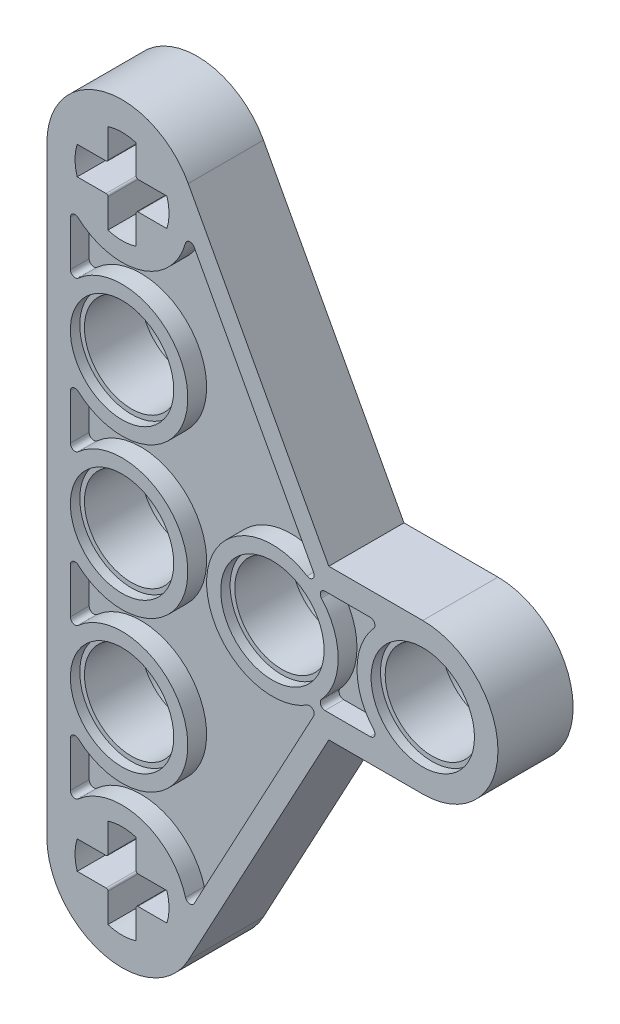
ISO-10303-21;
HEADER;
FILE_DESCRIPTION(('STEP AP214'),'2;1');
FILE_NAME('part.step','',(''),(''),'','','');
FILE_SCHEMA(('AUTOMOTIVE_DESIGN { 1 0 10303 214 1 1 1 1 }'));
ENDSEC;
DATA;
#1=APPLICATION_CONTEXT('core data for automotive mechanical design processes');
#2=APPLICATION_PROTOCOL_DEFINITION('international standard','automotive_design',2000,#1);
#3=PRODUCT_CONTEXT('',#1,'mechanical');
#4=PRODUCT('Part','Part','',(#3));
#5=PRODUCT_RELATED_PRODUCT_CATEGORY('part','',(#4));
#6=PRODUCT_DEFINITION_FORMATION('','',#4);
#7=PRODUCT_DEFINITION_CONTEXT('part definition',#1,'design');
#8=PRODUCT_DEFINITION('design','',#6,#7);
#9=PRODUCT_DEFINITION_SHAPE('','',#8);
#10=(LENGTH_UNIT() NAMED_UNIT(*) SI_UNIT(.MILLI.,.METRE.));
#11=(NAMED_UNIT(*) PLANE_ANGLE_UNIT() SI_UNIT($,.RADIAN.));
#12=(NAMED_UNIT(*) SI_UNIT($,.STERADIAN.) SOLID_ANGLE_UNIT());
#13=UNCERTAINTY_MEASURE_WITH_UNIT(LENGTH_MEASURE(1.E-05),#10,'distance_accuracy_value','');
#14=(GEOMETRIC_REPRESENTATION_CONTEXT(3) GLOBAL_UNCERTAINTY_ASSIGNED_CONTEXT((#13)) GLOBAL_UNIT_ASSIGNED_CONTEXT((#10,
#11,#12)) REPRESENTATION_CONTEXT('',''));
#15=CARTESIAN_POINT('',(0.,0.,0.));
#16=DIRECTION('',(0.,0.,1.));
#17=DIRECTION('',(1.,0.,0.));
#18=AXIS2_PLACEMENT_3D('',#15,#16,#17);
#19=CARTESIAN_POINT('',(0.,0.,-2.));
#20=DIRECTION('',(0.,0.,1.));
#21=DIRECTION('',(1.,0.,0.));
#22=AXIS2_PLACEMENT_3D('',#19,#20,#21);
#23=PLANE('',#22);
#24=CARTESIAN_POINT('',(-16.,8.,-2.));
#25=DIRECTION('',(0.,0.,1.));
#26=DIRECTION('',(1.,0.,0.));
#27=AXIS2_PLACEMENT_3D('',#24,#25,#26);
#28=CIRCLE('',#27,2.75);
#29=CARTESIAN_POINT('',(-13.25,8.,-2.));
#30=VERTEX_POINT('',#29);
#31=EDGE_CURVE('E1519',#30,#30,#28,.T.);
#32=ORIENTED_EDGE('',*,*,#31,.T.);
#33=EDGE_LOOP('',(#32));
#34=FACE_BOUND('',#33,.T.);
#35=CARTESIAN_POINT('',(-8.00000000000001,0.,-2.));
#36=DIRECTION('',(0.,0.,1.));
#37=DIRECTION('',(1.,0.,0.));
#38=AXIS2_PLACEMENT_3D('',#35,#36,#37);
#39=CIRCLE('',#38,2.75);
#40=CARTESIAN_POINT('',(-5.25000000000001,0.,-2.));
#41=VERTEX_POINT('',#40);
#42=EDGE_CURVE('E1508',#41,#41,#39,.T.);
#43=ORIENTED_EDGE('',*,*,#42,.T.);
#44=EDGE_LOOP('',(#43));
#45=FACE_BOUND('',#44,.T.);
#46=CARTESIAN_POINT('',(-5.20491502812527,2.5,-2.));
#47=DIRECTION('',(0.,0.,1.));
#48=DIRECTION('',(-1.,0.,0.));
#49=AXIS2_PLACEMENT_3D('',#46,#47,#48);
#50=CIRCLE('',#49,0.25);
#51=CARTESIAN_POINT('',(-5.20491502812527,2.75,-2.));
#52=VERTEX_POINT('',#51);
#53=CARTESIAN_POINT('',(-5.39125402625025,2.33333333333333,-2.));
#54=VERTEX_POINT('',#53);
#55=EDGE_CURVE('E48',#52,#54,#50,.T.);
#56=ORIENTED_EDGE('',*,*,#55,.T.);
#57=CARTESIAN_POINT('',(-8.00000000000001,0.,-2.));
#58=DIRECTION('',(0.,0.,-1.));
#59=DIRECTION('',(-1.,0.,0.));
#60=AXIS2_PLACEMENT_3D('',#57,#58,#59);
#61=CIRCLE('',#60,3.5);
#62=CARTESIAN_POINT('',(-5.39125402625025,-2.33333333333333,-2.));
#63=VERTEX_POINT('',#62);
#64=EDGE_CURVE('E697',#54,#63,#61,.T.);
#65=ORIENTED_EDGE('',*,*,#64,.T.);
#66=CARTESIAN_POINT('',(-5.20491502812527,-2.5,-2.));
#67=DIRECTION('',(0.,0.,1.));
#68=DIRECTION('',(1.,0.,0.));
#69=AXIS2_PLACEMENT_3D('',#66,#67,#68);
#70=CIRCLE('',#69,0.25);
#71=CARTESIAN_POINT('',(-5.20491502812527,-2.75,-2.));
#72=VERTEX_POINT('',#71);
#73=EDGE_CURVE('E700',#63,#72,#70,.T.);
#74=ORIENTED_EDGE('',*,*,#73,.T.);
#75=DIRECTION('',(1.,0.,0.));
#76=VECTOR('',#75,1.);
#77=CARTESIAN_POINT('',(-5.20491502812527,-2.75,-2.));
#78=LINE('',#77,#76);
#79=CARTESIAN_POINT('',(-2.79508497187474,-2.75,-2.));
#80=VERTEX_POINT('',#79);
#81=EDGE_CURVE('E729',#72,#80,#78,.T.);
#82=ORIENTED_EDGE('',*,*,#81,.T.);
#83=CARTESIAN_POINT('',(-2.79508497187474,-2.5,-2.));
#84=DIRECTION('',(0.,0.,1.));
#85=DIRECTION('',(-1.,0.,0.));
#86=AXIS2_PLACEMENT_3D('',#83,#84,#85);
#87=CIRCLE('',#86,0.25);
#88=CARTESIAN_POINT('',(-2.60874597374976,-2.33333333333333,-2.));
#89=VERTEX_POINT('',#88);
#90=EDGE_CURVE('E726',#80,#89,#87,.T.);
#91=ORIENTED_EDGE('',*,*,#90,.T.);
#92=CARTESIAN_POINT('',(0.,0.,-2.));
#93=DIRECTION('',(0.,0.,-1.));
#94=DIRECTION('',(-1.,0.,0.));
#95=AXIS2_PLACEMENT_3D('',#92,#93,#94);
#96=CIRCLE('',#95,3.5);
#97=CARTESIAN_POINT('',(-2.60874597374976,2.33333333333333,-2.));
#98=VERTEX_POINT('',#97);
#99=EDGE_CURVE('E723',#89,#98,#96,.T.);
#100=ORIENTED_EDGE('',*,*,#99,.T.);
#101=CARTESIAN_POINT('',(-2.79508497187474,2.5,-2.));
#102=DIRECTION('',(0.,0.,1.));
#103=DIRECTION('',(1.,0.,0.));
#104=AXIS2_PLACEMENT_3D('',#101,#102,#103);
#105=CIRCLE('',#104,0.25);
#106=CARTESIAN_POINT('',(-2.79508497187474,2.75,-2.));
#107=VERTEX_POINT('',#106);
#108=EDGE_CURVE('E720',#98,#107,#105,.T.);
#109=ORIENTED_EDGE('',*,*,#108,.T.);
#110=DIRECTION('',(-1.,0.,0.));
#111=VECTOR('',#110,1.);
#112=CARTESIAN_POINT('',(-5.20491502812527,2.75,-2.));
#113=LINE('',#112,#111);
#114=EDGE_CURVE('E717',#107,#52,#113,.T.);
#115=ORIENTED_EDGE('',*,*,#114,.T.);
#116=EDGE_LOOP('',(#56,#65,#74,#82,#91,#100,#109,#115));
#117=FACE_BOUND('',#116,.T.);
#118=CARTESIAN_POINT('',(0.,0.,-2.));
#119=DIRECTION('',(0.,0.,1.));
#120=DIRECTION('',(1.,0.,0.));
#121=AXIS2_PLACEMENT_3D('',#118,#119,#120);
#122=CIRCLE('',#121,4.);
#123=CARTESIAN_POINT('',(0.,-4.00000000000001,-2.));
#124=VERTEX_POINT('',#123);
#125=CARTESIAN_POINT('',(0.,4.,-2.));
#126=VERTEX_POINT('',#125);
#127=EDGE_CURVE('E1435',#124,#126,#122,.T.);
#128=ORIENTED_EDGE('',*,*,#127,.F.);
#129=DIRECTION('',(1.,0.,0.));
#130=VECTOR('',#129,1.);
#131=CARTESIAN_POINT('',(-5.,-4.,-2.));
#132=LINE('',#131,#130);
#133=CARTESIAN_POINT('',(-5.,-4.,-2.));
#134=VERTEX_POINT('',#133);
#135=EDGE_CURVE('E1440',#134,#124,#132,.T.);
#136=ORIENTED_EDGE('',*,*,#135,.F.);
#137=DIRECTION('',(0.473875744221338,0.880591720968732,0.));
#138=VECTOR('',#137,1.);
#139=CARTESIAN_POINT('',(-12.4776331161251,-17.8955029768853,-2.));
#140=LINE('',#139,#138);
#141=CARTESIAN_POINT('',(-12.4776331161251,-17.8955029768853,-2.));
#142=VERTEX_POINT('',#141);
#143=EDGE_CURVE('E1467',#142,#134,#140,.T.);
#144=ORIENTED_EDGE('',*,*,#143,.F.);
#145=CARTESIAN_POINT('',(-16.,-16.,-2.));
#146=DIRECTION('',(0.,0.,1.));
#147=DIRECTION('',(1.,0.,0.));
#148=AXIS2_PLACEMENT_3D('',#145,#146,#147);
#149=CIRCLE('',#148,4.);
#150=CARTESIAN_POINT('',(-20.,-16.,-2.));
#151=VERTEX_POINT('',#150);
#152=EDGE_CURVE('E1465',#151,#142,#149,.T.);
#153=ORIENTED_EDGE('',*,*,#152,.F.);
#154=DIRECTION('',(0.,-1.,0.));
#155=VECTOR('',#154,1.);
#156=CARTESIAN_POINT('',(-20.,-16.,-2.));
#157=LINE('',#156,#155);
#158=CARTESIAN_POINT('',(-20.,16.,-2.));
#159=VERTEX_POINT('',#158);
#160=EDGE_CURVE('E1463',#159,#151,#157,.T.);
#161=ORIENTED_EDGE('',*,*,#160,.F.);
#162=CARTESIAN_POINT('',(-16.,16.,-2.));
#163=DIRECTION('',(0.,0.,1.));
#164=DIRECTION('',(-1.,0.,0.));
#165=AXIS2_PLACEMENT_3D('',#162,#163,#164);
#166=CIRCLE('',#165,4.);
#167=CARTESIAN_POINT('',(-12.4776331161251,17.8955029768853,-2.));
#168=VERTEX_POINT('',#167);
#169=EDGE_CURVE('E1461',#168,#159,#166,.T.);
#170=ORIENTED_EDGE('',*,*,#169,.F.);
#171=DIRECTION('',(-0.473875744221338,0.880591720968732,0.));
#172=VECTOR('',#171,1.);
#173=CARTESIAN_POINT('',(-12.4776331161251,17.8955029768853,-2.));
#174=LINE('',#173,#172);
#175=CARTESIAN_POINT('',(-5.,4.,-2.));
#176=VERTEX_POINT('',#175);
#177=EDGE_CURVE('E1459',#176,#168,#174,.T.);
#178=ORIENTED_EDGE('',*,*,#177,.F.);
#179=DIRECTION('',(-1.,0.,0.));
#180=VECTOR('',#179,1.);
#181=CARTESIAN_POINT('',(-5.,4.,-2.));
#182=LINE('',#181,#180);
#183=EDGE_CURVE('E1457',#126,#176,#182,.T.);
#184=ORIENTED_EDGE('',*,*,#183,.F.);
#185=EDGE_LOOP('',(#128,#136,#144,#153,#161,#170,#178,#184));
#186=FACE_BOUND('',#185,.T.);
#187=CARTESIAN_POINT('',(-15.15,-16.85,-2.));
#188=DIRECTION('',(0.,0.,-1.));
#189=DIRECTION('',(-1.,0.,0.));
#190=AXIS2_PLACEMENT_3D('',#187,#188,#189);
#191=CIRCLE('',#190,0.100000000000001);
#192=CARTESIAN_POINT('',(-15.25,-16.85,-2.));
#193=VERTEX_POINT('',#192);
#194=CARTESIAN_POINT('',(-15.15,-16.75,-2.));
#195=VERTEX_POINT('',#194);
#196=EDGE_CURVE('E1320',#193,#195,#191,.T.);
#197=ORIENTED_EDGE('',*,*,#196,.T.);
#198=DIRECTION('',(1.,0.,0.));
#199=VECTOR('',#198,1.);
#200=CARTESIAN_POINT('',(-13.6151519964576,-16.75,-2.));
#201=LINE('',#200,#199);
#202=CARTESIAN_POINT('',(-13.6151519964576,-16.75,-2.));
#203=VERTEX_POINT('',#202);
#204=EDGE_CURVE('E1358',#195,#203,#201,.T.);
#205=ORIENTED_EDGE('',*,*,#204,.T.);
#206=CARTESIAN_POINT('',(-16.,-16.,-2.));
#207=DIRECTION('',(0.,0.,1.));
#208=DIRECTION('',(1.,0.,0.));
#209=AXIS2_PLACEMENT_3D('',#206,#207,#208);
#210=CIRCLE('',#209,2.5);
#211=CARTESIAN_POINT('',(-13.6151519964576,-15.25,-2.));
#212=VERTEX_POINT('',#211);
#213=EDGE_CURVE('E1361',#203,#212,#210,.T.);
#214=ORIENTED_EDGE('',*,*,#213,.T.);
#215=DIRECTION('',(-1.,0.,0.));
#216=VECTOR('',#215,1.);
#217=CARTESIAN_POINT('',(-13.6151519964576,-15.25,-2.));
#218=LINE('',#217,#216);
#219=CARTESIAN_POINT('',(-15.15,-15.25,-2.));
#220=VERTEX_POINT('',#219);
#221=EDGE_CURVE('E1364',#212,#220,#218,.T.);
#222=ORIENTED_EDGE('',*,*,#221,.T.);
#223=CARTESIAN_POINT('',(-15.15,-15.15,-2.));
#224=DIRECTION('',(0.,0.,-1.));
#225=DIRECTION('',(-1.,0.,0.));
#226=AXIS2_PLACEMENT_3D('',#223,#224,#225);
#227=CIRCLE('',#226,0.100000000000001);
#228=CARTESIAN_POINT('',(-15.25,-15.15,-2.));
#229=VERTEX_POINT('',#228);
#230=EDGE_CURVE('E1367',#220,#229,#227,.T.);
#231=ORIENTED_EDGE('',*,*,#230,.T.);
#232=DIRECTION('',(0.,1.,0.));
#233=VECTOR('',#232,1.);
#234=CARTESIAN_POINT('',(-15.25,-15.15,-2.));
#235=LINE('',#234,#233);
#236=CARTESIAN_POINT('',(-15.25,-13.6151519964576,-2.));
#237=VERTEX_POINT('',#236);
#238=EDGE_CURVE('E1370',#229,#237,#235,.T.);
#239=ORIENTED_EDGE('',*,*,#238,.T.);
#240=CARTESIAN_POINT('',(-16.,-16.,-2.));
#241=DIRECTION('',(0.,0.,1.));
#242=DIRECTION('',(1.,0.,0.));
#243=AXIS2_PLACEMENT_3D('',#240,#241,#242);
#244=CIRCLE('',#243,2.5);
#245=CARTESIAN_POINT('',(-16.75,-13.6151519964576,-2.));
#246=VERTEX_POINT('',#245);
#247=EDGE_CURVE('E1373',#237,#246,#244,.T.);
#248=ORIENTED_EDGE('',*,*,#247,.T.);
#249=DIRECTION('',(0.,-1.,0.));
#250=VECTOR('',#249,1.);
#251=CARTESIAN_POINT('',(-16.75,-15.15,-2.));
#252=LINE('',#251,#250);
#253=CARTESIAN_POINT('',(-16.75,-15.15,-2.));
#254=VERTEX_POINT('',#253);
#255=EDGE_CURVE('E1376',#246,#254,#252,.T.);
#256=ORIENTED_EDGE('',*,*,#255,.T.);
#257=CARTESIAN_POINT('',(-16.85,-15.15,-2.));
#258=DIRECTION('',(0.,0.,-1.));
#259=DIRECTION('',(-1.,0.,0.));
#260=AXIS2_PLACEMENT_3D('',#257,#258,#259);
#261=CIRCLE('',#260,0.100000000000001);
#262=CARTESIAN_POINT('',(-16.85,-15.25,-2.));
#263=VERTEX_POINT('',#262);
#264=EDGE_CURVE('E1379',#254,#263,#261,.T.);
#265=ORIENTED_EDGE('',*,*,#264,.T.);
#266=DIRECTION('',(-1.,0.,0.));
#267=VECTOR('',#266,1.);
#268=CARTESIAN_POINT('',(-18.3848480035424,-15.25,-2.));
#269=LINE('',#268,#267);
#270=CARTESIAN_POINT('',(-18.3848480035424,-15.25,-2.));
#271=VERTEX_POINT('',#270);
#272=EDGE_CURVE('E1382',#263,#271,#269,.T.);
#273=ORIENTED_EDGE('',*,*,#272,.T.);
#274=CARTESIAN_POINT('',(-16.,-16.,-2.));
#275=DIRECTION('',(0.,0.,1.));
#276=DIRECTION('',(-1.,0.,0.));
#277=AXIS2_PLACEMENT_3D('',#274,#275,#276);
#278=CIRCLE('',#277,2.5);
#279=CARTESIAN_POINT('',(-18.3848480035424,-16.75,-2.));
#280=VERTEX_POINT('',#279);
#281=EDGE_CURVE('E1385',#271,#280,#278,.T.);
#282=ORIENTED_EDGE('',*,*,#281,.T.);
#283=DIRECTION('',(1.,0.,0.));
#284=VECTOR('',#283,1.);
#285=CARTESIAN_POINT('',(-18.3848480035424,-16.75,-2.));
#286=LINE('',#285,#284);
#287=CARTESIAN_POINT('',(-16.85,-16.75,-2.));
#288=VERTEX_POINT('',#287);
#289=EDGE_CURVE('E1388',#280,#288,#286,.T.);
#290=ORIENTED_EDGE('',*,*,#289,.T.);
#291=CARTESIAN_POINT('',(-16.85,-16.85,-2.));
#292=DIRECTION('',(0.,0.,-1.));
#293=DIRECTION('',(-1.,0.,0.));
#294=AXIS2_PLACEMENT_3D('',#291,#292,#293);
#295=CIRCLE('',#294,0.100000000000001);
#296=CARTESIAN_POINT('',(-16.75,-16.85,-2.));
#297=VERTEX_POINT('',#296);
#298=EDGE_CURVE('E1391',#288,#297,#295,.T.);
#299=ORIENTED_EDGE('',*,*,#298,.T.);
#300=DIRECTION('',(0.,-1.,0.));
#301=VECTOR('',#300,1.);
#302=CARTESIAN_POINT('',(-16.75,-16.85,-2.));
#303=LINE('',#302,#301);
#304=CARTESIAN_POINT('',(-16.75,-18.3848480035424,-2.));
#305=VERTEX_POINT('',#304);
#306=EDGE_CURVE('E1394',#297,#305,#303,.T.);
#307=ORIENTED_EDGE('',*,*,#306,.T.);
#308=CARTESIAN_POINT('',(-16.,-16.,-2.));
#309=DIRECTION('',(0.,0.,1.));
#310=DIRECTION('',(-1.,0.,0.));
#311=AXIS2_PLACEMENT_3D('',#308,#309,#310);
#312=CIRCLE('',#311,2.5);
#313=CARTESIAN_POINT('',(-15.25,-18.3848480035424,-2.));
#314=VERTEX_POINT('',#313);
#315=EDGE_CURVE('E1397',#305,#314,#312,.T.);
#316=ORIENTED_EDGE('',*,*,#315,.T.);
#317=DIRECTION('',(0.,1.,0.));
#318=VECTOR('',#317,1.);
#319=CARTESIAN_POINT('',(-15.25,-16.85,-2.));
#320=LINE('',#319,#318);
#321=EDGE_CURVE('E1324',#314,#193,#320,.T.);
#322=ORIENTED_EDGE('',*,*,#321,.T.);
#323=EDGE_LOOP('',(#197,#205,#214,#222,#231,#239,#248,#256,#265,#273,#282,#290,#299,#307,#316,#322));
#324=FACE_BOUND('',#323,.T.);
#325=CARTESIAN_POINT('',(-16.,16.,-2.));
#326=DIRECTION('',(0.,0.,1.));
#327=DIRECTION('',(1.,0.,0.));
#328=AXIS2_PLACEMENT_3D('',#325,#326,#327);
#329=CIRCLE('',#328,2.5);
#330=CARTESIAN_POINT('',(-18.3848480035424,16.75,-2.));
#331=VERTEX_POINT('',#330);
#332=CARTESIAN_POINT('',(-18.3848480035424,15.25,-2.));
#333=VERTEX_POINT('',#332);
#334=EDGE_CURVE('E1240',#331,#333,#329,.T.);
#335=ORIENTED_EDGE('',*,*,#334,.T.);
#336=DIRECTION('',(1.,0.,0.));
#337=VECTOR('',#336,1.);
#338=CARTESIAN_POINT('',(-18.3848480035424,15.25,-2.));
#339=LINE('',#338,#337);
#340=CARTESIAN_POINT('',(-16.85,15.25,-2.));
#341=VERTEX_POINT('',#340);
#342=EDGE_CURVE('E1243',#333,#341,#339,.T.);
#343=ORIENTED_EDGE('',*,*,#342,.T.);
#344=CARTESIAN_POINT('',(-16.85,15.15,-2.));
#345=DIRECTION('',(0.,0.,-1.));
#346=DIRECTION('',(1.,0.,0.));
#347=AXIS2_PLACEMENT_3D('',#344,#345,#346);
#348=CIRCLE('',#347,0.100000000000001);
#349=CARTESIAN_POINT('',(-16.75,15.15,-2.));
#350=VERTEX_POINT('',#349);
#351=EDGE_CURVE('E1246',#341,#350,#348,.T.);
#352=ORIENTED_EDGE('',*,*,#351,.T.);
#353=DIRECTION('',(0.,-1.,0.));
#354=VECTOR('',#353,1.);
#355=CARTESIAN_POINT('',(-16.75,15.15,-2.));
#356=LINE('',#355,#354);
#357=CARTESIAN_POINT('',(-16.75,13.6151519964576,-2.));
#358=VERTEX_POINT('',#357);
#359=EDGE_CURVE('E1249',#350,#358,#356,.T.);
#360=ORIENTED_EDGE('',*,*,#359,.T.);
#361=CARTESIAN_POINT('',(-16.,16.,-2.));
#362=DIRECTION('',(0.,0.,1.));
#363=DIRECTION('',(-1.,0.,0.));
#364=AXIS2_PLACEMENT_3D('',#361,#362,#363);
#365=CIRCLE('',#364,2.5);
#366=CARTESIAN_POINT('',(-15.25,13.6151519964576,-2.));
#367=VERTEX_POINT('',#366);
#368=EDGE_CURVE('E1252',#358,#367,#365,.T.);
#369=ORIENTED_EDGE('',*,*,#368,.T.);
#370=DIRECTION('',(0.,1.,0.));
#371=VECTOR('',#370,1.);
#372=CARTESIAN_POINT('',(-15.25,15.15,-2.));
#373=LINE('',#372,#371);
#374=CARTESIAN_POINT('',(-15.25,15.15,-2.));
#375=VERTEX_POINT('',#374);
#376=EDGE_CURVE('E1255',#367,#375,#373,.T.);
#377=ORIENTED_EDGE('',*,*,#376,.T.);
#378=CARTESIAN_POINT('',(-15.15,15.15,-2.));
#379=DIRECTION('',(0.,0.,-1.));
#380=DIRECTION('',(1.,0.,0.));
#381=AXIS2_PLACEMENT_3D('',#378,#379,#380);
#382=CIRCLE('',#381,0.100000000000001);
#383=CARTESIAN_POINT('',(-15.15,15.25,-2.));
#384=VERTEX_POINT('',#383);
#385=EDGE_CURVE('E1258',#375,#384,#382,.T.);
#386=ORIENTED_EDGE('',*,*,#385,.T.);
#387=DIRECTION('',(1.,0.,0.));
#388=VECTOR('',#387,1.);
#389=CARTESIAN_POINT('',(-13.6151519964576,15.25,-2.));
#390=LINE('',#389,#388);
#391=CARTESIAN_POINT('',(-13.6151519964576,15.25,-2.));
#392=VERTEX_POINT('',#391);
#393=EDGE_CURVE('E1261',#384,#392,#390,.T.);
#394=ORIENTED_EDGE('',*,*,#393,.T.);
#395=CARTESIAN_POINT('',(-16.,16.,-2.));
#396=DIRECTION('',(0.,0.,1.));
#397=DIRECTION('',(-1.,0.,0.));
#398=AXIS2_PLACEMENT_3D('',#395,#396,#397);
#399=CIRCLE('',#398,2.5);
#400=CARTESIAN_POINT('',(-13.6151519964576,16.75,-2.));
#401=VERTEX_POINT('',#400);
#402=EDGE_CURVE('E1264',#392,#401,#399,.T.);
#403=ORIENTED_EDGE('',*,*,#402,.T.);
#404=DIRECTION('',(-1.,0.,0.));
#405=VECTOR('',#404,1.);
#406=CARTESIAN_POINT('',(-13.6151519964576,16.75,-2.));
#407=LINE('',#406,#405);
#408=CARTESIAN_POINT('',(-15.15,16.75,-2.));
#409=VERTEX_POINT('',#408);
#410=EDGE_CURVE('E1267',#401,#409,#407,.T.);
#411=ORIENTED_EDGE('',*,*,#410,.T.);
#412=CARTESIAN_POINT('',(-15.15,16.85,-2.));
#413=DIRECTION('',(0.,0.,-1.));
#414=DIRECTION('',(1.,0.,0.));
#415=AXIS2_PLACEMENT_3D('',#412,#413,#414);
#416=CIRCLE('',#415,0.100000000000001);
#417=CARTESIAN_POINT('',(-15.25,16.85,-2.));
#418=VERTEX_POINT('',#417);
#419=EDGE_CURVE('E1270',#409,#418,#416,.T.);
#420=ORIENTED_EDGE('',*,*,#419,.T.);
#421=DIRECTION('',(0.,1.,0.));
#422=VECTOR('',#421,1.);
#423=CARTESIAN_POINT('',(-15.25,16.85,-2.));
#424=LINE('',#423,#422);
#425=CARTESIAN_POINT('',(-15.25,18.3848480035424,-2.));
#426=VERTEX_POINT('',#425);
#427=EDGE_CURVE('E1273',#418,#426,#424,.T.);
#428=ORIENTED_EDGE('',*,*,#427,.T.);
#429=CARTESIAN_POINT('',(-16.,16.,-2.));
#430=DIRECTION('',(0.,0.,1.));
#431=DIRECTION('',(1.,0.,0.));
#432=AXIS2_PLACEMENT_3D('',#429,#430,#431);
#433=CIRCLE('',#432,2.5);
#434=CARTESIAN_POINT('',(-16.75,18.3848480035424,-2.));
#435=VERTEX_POINT('',#434);
#436=EDGE_CURVE('E1276',#426,#435,#433,.T.);
#437=ORIENTED_EDGE('',*,*,#436,.T.);
#438=DIRECTION('',(0.,-1.,0.));
#439=VECTOR('',#438,1.);
#440=CARTESIAN_POINT('',(-16.75,16.85,-2.));
#441=LINE('',#440,#439);
#442=CARTESIAN_POINT('',(-16.75,16.85,-2.));
#443=VERTEX_POINT('',#442);
#444=EDGE_CURVE('E1279',#435,#443,#441,.T.);
#445=ORIENTED_EDGE('',*,*,#444,.T.);
#446=CARTESIAN_POINT('',(-16.85,16.85,-2.));
#447=DIRECTION('',(0.,0.,-1.));
#448=DIRECTION('',(1.,0.,0.));
#449=AXIS2_PLACEMENT_3D('',#446,#447,#448);
#450=CIRCLE('',#449,0.100000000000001);
#451=CARTESIAN_POINT('',(-16.85,16.75,-2.));
#452=VERTEX_POINT('',#451);
#453=EDGE_CURVE('E1282',#443,#452,#450,.T.);
#454=ORIENTED_EDGE('',*,*,#453,.T.);
#455=DIRECTION('',(-1.,0.,0.));
#456=VECTOR('',#455,1.);
#457=CARTESIAN_POINT('',(-18.3848480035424,16.75,-2.));
#458=LINE('',#457,#456);
#459=EDGE_CURVE('E1208',#452,#331,#458,.T.);
#460=ORIENTED_EDGE('',*,*,#459,.T.);
#461=EDGE_LOOP('',(#335,#343,#352,#360,#369,#377,#386,#394,#403,#411,#420,#428,#437,#445,#454,#460));
#462=FACE_BOUND('',#461,.T.);
#463=CARTESIAN_POINT('',(-12.3842694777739,15.0055188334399,-2.));
#464=DIRECTION('',(0.,0.,1.));
#465=DIRECTION('',(-1.,0.,0.));
#466=AXIS2_PLACEMENT_3D('',#463,#464,#465);
#467=CIRCLE('',#466,0.25);
#468=CARTESIAN_POINT('',(-12.1641215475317,15.1239877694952,-2.));
#469=VERTEX_POINT('',#468);
#470=CARTESIAN_POINT('',(-12.6253181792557,15.0718175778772,-2.));
#471=VERTEX_POINT('',#470);
#472=EDGE_CURVE('E56',#469,#471,#467,.T.);
#473=ORIENTED_EDGE('',*,*,#472,.T.);
#474=CARTESIAN_POINT('',(-16.,16.,-2.));
#475=DIRECTION('',(0.,0.,-1.));
#476=DIRECTION('',(1.,0.,0.));
#477=AXIS2_PLACEMENT_3D('',#474,#475,#476);
#478=CIRCLE('',#477,3.5);
#479=CARTESIAN_POINT('',(-18.3333333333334,13.3912540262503,-2.));
#480=VERTEX_POINT('',#479);
#481=EDGE_CURVE('E751',#471,#480,#478,.T.);
#482=ORIENTED_EDGE('',*,*,#481,.T.);
#483=CARTESIAN_POINT('',(-18.5,13.2049150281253,-2.));
#484=DIRECTION('',(0.,0.,1.));
#485=DIRECTION('',(1.,0.,0.));
#486=AXIS2_PLACEMENT_3D('',#483,#484,#485);
#487=CIRCLE('',#486,0.250000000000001);
#488=CARTESIAN_POINT('',(-18.75,13.2049150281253,-2.));
#489=VERTEX_POINT('',#488);
#490=EDGE_CURVE('E864',#480,#489,#487,.T.);
#491=ORIENTED_EDGE('',*,*,#490,.T.);
#492=DIRECTION('',(0.,-1.,0.));
#493=VECTOR('',#492,1.);
#494=CARTESIAN_POINT('',(-18.75,13.2049150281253,-2.));
#495=LINE('',#494,#493);
#496=CARTESIAN_POINT('',(-18.75,10.7950849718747,-2.));
#497=VERTEX_POINT('',#496);
#498=EDGE_CURVE('E861',#489,#497,#495,.T.);
#499=ORIENTED_EDGE('',*,*,#498,.T.);
#500=CARTESIAN_POINT('',(-18.5,10.7950849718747,-2.));
#501=DIRECTION('',(0.,0.,1.));
#502=DIRECTION('',(1.,0.,0.));
#503=AXIS2_PLACEMENT_3D('',#500,#501,#502);
#504=CIRCLE('',#503,0.250000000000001);
#505=CARTESIAN_POINT('',(-18.3333333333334,10.6087459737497,-2.));
#506=VERTEX_POINT('',#505);
#507=EDGE_CURVE('E858',#497,#506,#504,.T.);
#508=ORIENTED_EDGE('',*,*,#507,.T.);
#509=CARTESIAN_POINT('',(-16.,8.,-2.));
#510=DIRECTION('',(0.,0.,-1.));
#511=DIRECTION('',(1.,0.,0.));
#512=AXIS2_PLACEMENT_3D('',#509,#510,#511);
#513=CIRCLE('',#512,3.5);
#514=CARTESIAN_POINT('',(-18.3333333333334,5.39125402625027,-2.));
#515=VERTEX_POINT('',#514);
#516=EDGE_CURVE('E855',#506,#515,#513,.T.);
#517=ORIENTED_EDGE('',*,*,#516,.T.);
#518=CARTESIAN_POINT('',(-18.5,5.20491502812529,-2.));
#519=DIRECTION('',(0.,0.,1.));
#520=DIRECTION('',(1.,0.,0.));
#521=AXIS2_PLACEMENT_3D('',#518,#519,#520);
#522=CIRCLE('',#521,0.250000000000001);
#523=CARTESIAN_POINT('',(-18.75,5.20491502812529,-2.));
#524=VERTEX_POINT('',#523);
#525=EDGE_CURVE('E852',#515,#524,#522,.T.);
#526=ORIENTED_EDGE('',*,*,#525,.T.);
#527=DIRECTION('',(0.,-1.,0.));
#528=VECTOR('',#527,1.);
#529=CARTESIAN_POINT('',(-18.75,5.20491502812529,-2.));
#530=LINE('',#529,#528);
#531=CARTESIAN_POINT('',(-18.75,2.79508497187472,-2.));
#532=VERTEX_POINT('',#531);
#533=EDGE_CURVE('E849',#524,#532,#530,.T.);
#534=ORIENTED_EDGE('',*,*,#533,.T.);
#535=CARTESIAN_POINT('',(-18.5,2.79508497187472,-2.));
#536=DIRECTION('',(0.,0.,1.));
#537=DIRECTION('',(-1.,0.,0.));
#538=AXIS2_PLACEMENT_3D('',#535,#536,#537);
#539=CIRCLE('',#538,0.250000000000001);
#540=CARTESIAN_POINT('',(-18.3333333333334,2.60874597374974,-2.));
#541=VERTEX_POINT('',#540);
#542=EDGE_CURVE('E846',#532,#541,#539,.T.);
#543=ORIENTED_EDGE('',*,*,#542,.T.);
#544=CARTESIAN_POINT('',(-16.,0.,-2.));
#545=DIRECTION('',(0.,0.,-1.));
#546=DIRECTION('',(1.,0.,0.));
#547=AXIS2_PLACEMENT_3D('',#544,#545,#546);
#548=CIRCLE('',#547,3.5);
#549=CARTESIAN_POINT('',(-18.3333333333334,-2.60874597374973,-2.));
#550=VERTEX_POINT('',#549);
#551=EDGE_CURVE('E843',#541,#550,#548,.T.);
#552=ORIENTED_EDGE('',*,*,#551,.T.);
#553=CARTESIAN_POINT('',(-18.5,-2.79508497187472,-2.));
#554=DIRECTION('',(0.,0.,1.));
#555=DIRECTION('',(1.,0.,0.));
#556=AXIS2_PLACEMENT_3D('',#553,#554,#555);
#557=CIRCLE('',#556,0.250000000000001);
#558=CARTESIAN_POINT('',(-18.75,-2.79508497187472,-2.));
#559=VERTEX_POINT('',#558);
#560=EDGE_CURVE('E840',#550,#559,#557,.T.);
#561=ORIENTED_EDGE('',*,*,#560,.T.);
#562=DIRECTION('',(0.,-1.,0.));
#563=VECTOR('',#562,1.);
#564=CARTESIAN_POINT('',(-18.75,-5.20491502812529,-2.));
#565=LINE('',#564,#563);
#566=CARTESIAN_POINT('',(-18.75,-5.20491502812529,-2.));
#567=VERTEX_POINT('',#566);
#568=EDGE_CURVE('E837',#559,#567,#565,.T.);
#569=ORIENTED_EDGE('',*,*,#568,.T.);
#570=CARTESIAN_POINT('',(-18.5,-5.20491502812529,-2.));
#571=DIRECTION('',(0.,0.,1.));
#572=DIRECTION('',(-1.,0.,0.));
#573=AXIS2_PLACEMENT_3D('',#570,#571,#572);
#574=CIRCLE('',#573,0.250000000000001);
#575=CARTESIAN_POINT('',(-18.3333333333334,-5.39125402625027,-2.));
#576=VERTEX_POINT('',#575);
#577=EDGE_CURVE('E834',#567,#576,#574,.T.);
#578=ORIENTED_EDGE('',*,*,#577,.T.);
#579=CARTESIAN_POINT('',(-16.,-8.,-2.));
#580=DIRECTION('',(0.,0.,-1.));
#581=DIRECTION('',(-1.,0.,0.));
#582=AXIS2_PLACEMENT_3D('',#579,#580,#581);
#583=CIRCLE('',#582,3.5);
#584=CARTESIAN_POINT('',(-18.3333333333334,-10.6087459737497,-2.));
#585=VERTEX_POINT('',#584);
#586=EDGE_CURVE('E831',#576,#585,#583,.T.);
#587=ORIENTED_EDGE('',*,*,#586,.T.);
#588=CARTESIAN_POINT('',(-18.5,-10.7950849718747,-2.));
#589=DIRECTION('',(0.,0.,1.));
#590=DIRECTION('',(-1.,0.,0.));
#591=AXIS2_PLACEMENT_3D('',#588,#589,#590);
#592=CIRCLE('',#591,0.250000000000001);
#593=CARTESIAN_POINT('',(-18.75,-10.7950849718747,-2.));
#594=VERTEX_POINT('',#593);
#595=EDGE_CURVE('E828',#585,#594,#592,.T.);
#596=ORIENTED_EDGE('',*,*,#595,.T.);
#597=DIRECTION('',(0.,-1.,0.));
#598=VECTOR('',#597,1.);
#599=CARTESIAN_POINT('',(-18.75,-13.2049150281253,-2.));
#600=LINE('',#599,#598);
#601=CARTESIAN_POINT('',(-18.75,-13.2049150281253,-2.));
#602=VERTEX_POINT('',#601);
#603=EDGE_CURVE('E825',#594,#602,#600,.T.);
#604=ORIENTED_EDGE('',*,*,#603,.T.);
#605=CARTESIAN_POINT('',(-18.5,-13.2049150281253,-2.));
#606=DIRECTION('',(0.,0.,1.));
#607=DIRECTION('',(-1.,0.,0.));
#608=AXIS2_PLACEMENT_3D('',#605,#606,#607);
#609=CIRCLE('',#608,0.250000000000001);
#610=CARTESIAN_POINT('',(-18.3333333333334,-13.3912540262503,-2.));
#611=VERTEX_POINT('',#610);
#612=EDGE_CURVE('E822',#602,#611,#609,.T.);
#613=ORIENTED_EDGE('',*,*,#612,.T.);
#614=CARTESIAN_POINT('',(-16.,-16.,-2.));
#615=DIRECTION('',(0.,0.,-1.));
#616=DIRECTION('',(-1.,0.,0.));
#617=AXIS2_PLACEMENT_3D('',#614,#615,#616);
#618=CIRCLE('',#617,3.5);
#619=CARTESIAN_POINT('',(-12.6253181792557,-15.0718175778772,-2.));
#620=VERTEX_POINT('',#619);
#621=EDGE_CURVE('E819',#611,#620,#618,.T.);
#622=ORIENTED_EDGE('',*,*,#621,.T.);
#623=CARTESIAN_POINT('',(-12.3842694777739,-15.0055188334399,-2.));
#624=DIRECTION('',(0.,0.,1.));
#625=DIRECTION('',(1.,0.,0.));
#626=AXIS2_PLACEMENT_3D('',#623,#624,#625);
#627=CIRCLE('',#626,0.25);
#628=CARTESIAN_POINT('',(-12.1641215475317,-15.1239877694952,-2.));
#629=VERTEX_POINT('',#628);
#630=EDGE_CURVE('E816',#620,#629,#627,.T.);
#631=ORIENTED_EDGE('',*,*,#630,.T.);
#632=DIRECTION('',(0.473875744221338,0.880591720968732,0.));
#633=VECTOR('',#632,1.);
#634=CARTESIAN_POINT('',(-12.1641215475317,-15.1239877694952,-2.));
#635=LINE('',#634,#633);
#636=CARTESIAN_POINT('',(-5.80446931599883,-3.306001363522,-2.));
#637=VERTEX_POINT('',#636);
#638=EDGE_CURVE('E813',#629,#637,#635,.T.);
#639=ORIENTED_EDGE('',*,*,#638,.T.);
#640=CARTESIAN_POINT('',(-6.02461724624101,-3.18753242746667,-2.));
#641=DIRECTION('',(0.,0.,1.));
#642=DIRECTION('',(1.,0.,0.));
#643=AXIS2_PLACEMENT_3D('',#640,#641,#642);
#644=CIRCLE('',#643,0.25);
#645=CARTESIAN_POINT('',(-6.15630942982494,-2.97503026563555,-2.));
#646=VERTEX_POINT('',#645);
#647=EDGE_CURVE('E810',#637,#646,#644,.T.);
#648=ORIENTED_EDGE('',*,*,#647,.T.);
#649=CARTESIAN_POINT('',(-8.00000000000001,0.,-2.));
#650=DIRECTION('',(0.,0.,-1.));
#651=DIRECTION('',(1.,0.,0.));
#652=AXIS2_PLACEMENT_3D('',#649,#650,#651);
#653=CIRCLE('',#652,3.5);
#654=CARTESIAN_POINT('',(-6.15630942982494,2.97503026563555,-2.));
#655=VERTEX_POINT('',#654);
#656=EDGE_CURVE('E807',#646,#655,#653,.T.);
#657=ORIENTED_EDGE('',*,*,#656,.T.);
#658=CARTESIAN_POINT('',(-6.02461724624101,3.18753242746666,-2.));
#659=DIRECTION('',(0.,0.,1.));
#660=DIRECTION('',(1.,0.,0.));
#661=AXIS2_PLACEMENT_3D('',#658,#659,#660);
#662=CIRCLE('',#661,0.25);
#663=CARTESIAN_POINT('',(-5.80446931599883,3.306001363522,-2.));
#664=VERTEX_POINT('',#663);
#665=EDGE_CURVE('E804',#655,#664,#662,.T.);
#666=ORIENTED_EDGE('',*,*,#665,.T.);
#667=DIRECTION('',(-0.473875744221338,0.880591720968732,0.));
#668=VECTOR('',#667,1.);
#669=CARTESIAN_POINT('',(-12.1641215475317,15.1239877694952,-2.));
#670=LINE('',#669,#668);
#671=EDGE_CURVE('E801',#664,#469,#670,.T.);
#672=ORIENTED_EDGE('',*,*,#671,.T.);
#673=EDGE_LOOP('',(#473,#482,#491,#499,#508,#517,#526,#534,#543,#552,#561,#569,#578,#587,#596,
#604,#613,#622,#631,#639,#648,#657,#666,#672));
#674=FACE_BOUND('',#673,.T.);
#675=CARTESIAN_POINT('',(-16.,0.,-2.));
#676=DIRECTION('',(0.,0.,1.));
#677=DIRECTION('',(1.,0.,0.));
#678=AXIS2_PLACEMENT_3D('',#675,#676,#677);
#679=CIRCLE('',#678,2.75);
#680=CARTESIAN_POINT('',(-13.25,0.,-2.));
#681=VERTEX_POINT('',#680);
#682=EDGE_CURVE('E703',#681,#681,#679,.T.);
#683=ORIENTED_EDGE('',*,*,#682,.T.);
#684=EDGE_LOOP('',(#683));
#685=FACE_BOUND('',#684,.T.);
#686=CARTESIAN_POINT('',(0.,0.,-2.));
#687=DIRECTION('',(0.,0.,1.));
#688=DIRECTION('',(1.,0.,0.));
#689=AXIS2_PLACEMENT_3D('',#686,#687,#688);
#690=CIRCLE('',#689,2.75);
#691=CARTESIAN_POINT('',(2.74999999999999,0.,-2.));
#692=VERTEX_POINT('',#691);
#693=EDGE_CURVE('E1512',#692,#692,#690,.T.);
#694=ORIENTED_EDGE('',*,*,#693,.T.);
#695=EDGE_LOOP('',(#694));
#696=FACE_BOUND('',#695,.T.);
#697=CARTESIAN_POINT('',(-15.9999999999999,-8.,-2.));
#698=DIRECTION('',(0.,0.,1.));
#699=DIRECTION('',(1.,0.,0.));
#700=AXIS2_PLACEMENT_3D('',#697,#698,#699);
#701=CIRCLE('',#700,2.75);
#702=CARTESIAN_POINT('',(-13.2499999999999,-8.,-2.));
#703=VERTEX_POINT('',#702);
#704=EDGE_CURVE('E1526',#703,#703,#701,.T.);
#705=ORIENTED_EDGE('',*,*,#704,.T.);
#706=EDGE_LOOP('',(#705));
#707=FACE_BOUND('',#706,.T.);
#708=ADVANCED_FACE('F31',(#34,#45,#117,#186,#324,#462,#674,#685,#696,#707),#23,.F.);
#709=CARTESIAN_POINT('',(-16.,-8.,2.));
#710=DIRECTION('',(0.,0.,-1.));
#711=DIRECTION('',(-1.,0.,0.));
#712=AXIS2_PLACEMENT_3D('',#709,#710,#711);
#713=CYLINDRICAL_SURFACE('',#712,2.5);
#714=CARTESIAN_POINT('',(-16.,-8.,1.5));
#715=DIRECTION('',(0.,0.,1.));
#716=DIRECTION('',(1.,0.,0.));
#717=AXIS2_PLACEMENT_3D('',#714,#715,#716);
#718=CIRCLE('',#717,2.5);
#719=CARTESIAN_POINT('',(-13.5,-8.,1.5));
#720=VERTEX_POINT('',#719);
#721=EDGE_CURVE('E1174',#720,#720,#718,.T.);
#722=ORIENTED_EDGE('',*,*,#721,.T.);
#723=EDGE_LOOP('',(#722));
#724=FACE_BOUND('',#723,.T.);
#725=CARTESIAN_POINT('',(-16.,-8.,-1.5));
#726=DIRECTION('',(0.,0.,-1.));
#727=DIRECTION('',(-1.,0.,0.));
#728=AXIS2_PLACEMENT_3D('',#725,#726,#727);
#729=CIRCLE('',#728,2.5);
#730=CARTESIAN_POINT('',(-18.5,-8.,-1.5));
#731=VERTEX_POINT('',#730);
#732=EDGE_CURVE('E35',#731,#731,#729,.T.);
#733=ORIENTED_EDGE('',*,*,#732,.T.);
#734=EDGE_LOOP('',(#733));
#735=FACE_BOUND('',#734,.T.);
#736=ADVANCED_FACE('F1555',(#724,#735),#713,.F.);
#737=CARTESIAN_POINT('',(-16.,8.,2.));
#738=DIRECTION('',(0.,0.,-1.));
#739=DIRECTION('',(-1.,0.,0.));
#740=AXIS2_PLACEMENT_3D('',#737,#738,#739);
#741=CYLINDRICAL_SURFACE('',#740,2.5);
#742=CARTESIAN_POINT('',(-16.,8.,1.5));
#743=DIRECTION('',(0.,0.,1.));
#744=DIRECTION('',(1.,0.,0.));
#745=AXIS2_PLACEMENT_3D('',#742,#743,#744);
#746=CIRCLE('',#745,2.5);
#747=CARTESIAN_POINT('',(-13.5,8.,1.5));
#748=VERTEX_POINT('',#747);
#749=EDGE_CURVE('E1180',#748,#748,#746,.T.);
#750=ORIENTED_EDGE('',*,*,#749,.T.);
#751=EDGE_LOOP('',(#750));
#752=FACE_BOUND('',#751,.T.);
#753=CARTESIAN_POINT('',(-16.,8.,-1.5));
#754=DIRECTION('',(0.,0.,-1.));
#755=DIRECTION('',(-1.,0.,0.));
#756=AXIS2_PLACEMENT_3D('',#753,#754,#755);
#757=CIRCLE('',#756,2.5);
#758=CARTESIAN_POINT('',(-18.5,8.,-1.5));
#759=VERTEX_POINT('',#758);
#760=EDGE_CURVE('E1510',#759,#759,#757,.T.);
#761=ORIENTED_EDGE('',*,*,#760,.T.);
#762=EDGE_LOOP('',(#761));
#763=FACE_BOUND('',#762,.T.);
#764=ADVANCED_FACE('F1561',(#752,#763),#741,.F.);
#765=CARTESIAN_POINT('',(0.,0.,2.));
#766=DIRECTION('',(0.,0.,-1.));
#767=DIRECTION('',(-1.,0.,0.));
#768=AXIS2_PLACEMENT_3D('',#765,#766,#767);
#769=CYLINDRICAL_SURFACE('',#768,2.5);
#770=CARTESIAN_POINT('',(0.,0.,1.5));
#771=DIRECTION('',(0.,0.,1.));
#772=DIRECTION('',(1.,0.,0.));
#773=AXIS2_PLACEMENT_3D('',#770,#771,#772);
#774=CIRCLE('',#773,2.5);
#775=CARTESIAN_POINT('',(2.5,0.,1.5));
#776=VERTEX_POINT('',#775);
#777=EDGE_CURVE('E1187',#776,#776,#774,.T.);
#778=ORIENTED_EDGE('',*,*,#777,.T.);
#779=EDGE_LOOP('',(#778));
#780=FACE_BOUND('',#779,.T.);
#781=CARTESIAN_POINT('',(0.,0.,-1.5));
#782=DIRECTION('',(0.,0.,-1.));
#783=DIRECTION('',(-1.,0.,0.));
#784=AXIS2_PLACEMENT_3D('',#781,#782,#783);
#785=CIRCLE('',#784,2.5);
#786=CARTESIAN_POINT('',(-2.5,0.,-1.5));
#787=VERTEX_POINT('',#786);
#788=EDGE_CURVE('E1506',#787,#787,#785,.T.);
#789=ORIENTED_EDGE('',*,*,#788,.T.);
#790=EDGE_LOOP('',(#789));
#791=FACE_BOUND('',#790,.T.);
#792=ADVANCED_FACE('F1747',(#780,#791),#769,.F.);
#793=CARTESIAN_POINT('',(-8.,0.,2.));
#794=DIRECTION('',(0.,0.,-1.));
#795=DIRECTION('',(-1.,0.,0.));
#796=AXIS2_PLACEMENT_3D('',#793,#794,#795);
#797=CYLINDRICAL_SURFACE('',#796,2.5);
#798=CARTESIAN_POINT('',(-8.,0.,1.5));
#799=DIRECTION('',(0.,0.,1.));
#800=DIRECTION('',(1.,0.,0.));
#801=AXIS2_PLACEMENT_3D('',#798,#799,#800);
#802=CIRCLE('',#801,2.5);
#803=CARTESIAN_POINT('',(-5.5,0.,1.5));
#804=VERTEX_POINT('',#803);
#805=EDGE_CURVE('E1194',#804,#804,#802,.T.);
#806=ORIENTED_EDGE('',*,*,#805,.T.);
#807=EDGE_LOOP('',(#806));
#808=FACE_BOUND('',#807,.T.);
#809=CARTESIAN_POINT('',(-8.,0.,-1.5));
#810=DIRECTION('',(0.,0.,-1.));
#811=DIRECTION('',(-1.,0.,0.));
#812=AXIS2_PLACEMENT_3D('',#809,#810,#811);
#813=CIRCLE('',#812,2.5);
#814=CARTESIAN_POINT('',(-10.5,0.,-1.5));
#815=VERTEX_POINT('',#814);
#816=EDGE_CURVE('E1502',#815,#815,#813,.T.);
#817=ORIENTED_EDGE('',*,*,#816,.T.);
#818=EDGE_LOOP('',(#817));
#819=FACE_BOUND('',#818,.T.);
#820=ADVANCED_FACE('F1631',(#808,#819),#797,.F.);
#821=CARTESIAN_POINT('',(-16.,0.,2.));
#822=DIRECTION('',(0.,0.,-1.));
#823=DIRECTION('',(-1.,0.,0.));
#824=AXIS2_PLACEMENT_3D('',#821,#822,#823);
#825=CYLINDRICAL_SURFACE('',#824,2.5);
#826=CARTESIAN_POINT('',(-16.,0.,1.5));
#827=DIRECTION('',(0.,0.,1.));
#828=DIRECTION('',(1.,0.,0.));
#829=AXIS2_PLACEMENT_3D('',#826,#827,#828);
#830=CIRCLE('',#829,2.5);
#831=CARTESIAN_POINT('',(-13.5,0.,1.5));
#832=VERTEX_POINT('',#831);
#833=EDGE_CURVE('E1201',#832,#832,#830,.T.);
#834=ORIENTED_EDGE('',*,*,#833,.T.);
#835=EDGE_LOOP('',(#834));
#836=FACE_BOUND('',#835,.T.);
#837=CARTESIAN_POINT('',(-16.,0.,-1.5));
#838=DIRECTION('',(0.,0.,-1.));
#839=DIRECTION('',(-1.,0.,0.));
#840=AXIS2_PLACEMENT_3D('',#837,#838,#839);
#841=CIRCLE('',#840,2.5);
#842=CARTESIAN_POINT('',(-18.5,0.,-1.5));
#843=VERTEX_POINT('',#842);
#844=EDGE_CURVE('E718',#843,#843,#841,.T.);
#845=ORIENTED_EDGE('',*,*,#844,.T.);
#846=EDGE_LOOP('',(#845));
#847=FACE_BOUND('',#846,.T.);
#848=ADVANCED_FACE('F1626',(#836,#847),#825,.F.);
#849=CARTESIAN_POINT('',(0.,0.,2.));
#850=DIRECTION('',(0.,0.,1.));
#851=DIRECTION('',(1.,0.,0.));
#852=AXIS2_PLACEMENT_3D('',#849,#850,#851);
#853=PLANE('',#852);
#854=CARTESIAN_POINT('',(-5.20491502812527,2.5,2.));
#855=DIRECTION('',(0.,0.,1.));
#856=DIRECTION('',(-1.,0.,0.));
#857=AXIS2_PLACEMENT_3D('',#854,#855,#856);
#858=CIRCLE('',#857,0.25);
#859=CARTESIAN_POINT('',(-5.20491502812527,2.75,2.));
#860=VERTEX_POINT('',#859);
#861=CARTESIAN_POINT('',(-5.39125402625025,2.33333333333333,2.));
#862=VERTEX_POINT('',#861);
#863=EDGE_CURVE('E871',#860,#862,#858,.T.);
#864=ORIENTED_EDGE('',*,*,#863,.F.);
#865=DIRECTION('',(-1.,0.,0.));
#866=VECTOR('',#865,1.);
#867=CARTESIAN_POINT('',(-5.20491502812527,2.75,2.));
#868=LINE('',#867,#866);
#869=CARTESIAN_POINT('',(-2.79508497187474,2.75,2.));
#870=VERTEX_POINT('',#869);
#871=EDGE_CURVE('E921',#870,#860,#868,.T.);
#872=ORIENTED_EDGE('',*,*,#871,.F.);
#873=CARTESIAN_POINT('',(-2.79508497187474,2.5,2.));
#874=DIRECTION('',(0.,0.,1.));
#875=DIRECTION('',(1.,0.,0.));
#876=AXIS2_PLACEMENT_3D('',#873,#874,#875);
#877=CIRCLE('',#876,0.25);
#878=CARTESIAN_POINT('',(-2.60874597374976,2.33333333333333,2.));
#879=VERTEX_POINT('',#878);
#880=EDGE_CURVE('E959',#879,#870,#877,.T.);
#881=ORIENTED_EDGE('',*,*,#880,.F.);
#882=CARTESIAN_POINT('',(0.,0.,2.));
#883=DIRECTION('',(0.,0.,-1.));
#884=DIRECTION('',(-1.,0.,0.));
#885=AXIS2_PLACEMENT_3D('',#882,#883,#884);
#886=CIRCLE('',#885,3.5);
#887=CARTESIAN_POINT('',(-2.60874597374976,-2.33333333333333,2.));
#888=VERTEX_POINT('',#887);
#889=EDGE_CURVE('E956',#888,#879,#886,.T.);
#890=ORIENTED_EDGE('',*,*,#889,.F.);
#891=CARTESIAN_POINT('',(-2.79508497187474,-2.5,2.));
#892=DIRECTION('',(0.,0.,1.));
#893=DIRECTION('',(-1.,0.,0.));
#894=AXIS2_PLACEMENT_3D('',#891,#892,#893);
#895=CIRCLE('',#894,0.25);
#896=CARTESIAN_POINT('',(-2.79508497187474,-2.75,2.));
#897=VERTEX_POINT('',#896);
#898=EDGE_CURVE('E953',#897,#888,#895,.T.);
#899=ORIENTED_EDGE('',*,*,#898,.F.);
#900=DIRECTION('',(1.,0.,0.));
#901=VECTOR('',#900,1.);
#902=CARTESIAN_POINT('',(-5.20491502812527,-2.75,2.));
#903=LINE('',#902,#901);
#904=CARTESIAN_POINT('',(-5.20491502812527,-2.75,2.));
#905=VERTEX_POINT('',#904);
#906=EDGE_CURVE('E950',#905,#897,#903,.T.);
#907=ORIENTED_EDGE('',*,*,#906,.F.);
#908=CARTESIAN_POINT('',(-5.20491502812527,-2.5,2.));
#909=DIRECTION('',(0.,0.,1.));
#910=DIRECTION('',(1.,0.,0.));
#911=AXIS2_PLACEMENT_3D('',#908,#909,#910);
#912=CIRCLE('',#911,0.25);
#913=CARTESIAN_POINT('',(-5.39125402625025,-2.33333333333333,2.));
#914=VERTEX_POINT('',#913);
#915=EDGE_CURVE('E947',#914,#905,#912,.T.);
#916=ORIENTED_EDGE('',*,*,#915,.F.);
#917=CARTESIAN_POINT('',(-8.00000000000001,0.,2.));
#918=DIRECTION('',(0.,0.,-1.));
#919=DIRECTION('',(-1.,0.,0.));
#920=AXIS2_PLACEMENT_3D('',#917,#918,#919);
#921=CIRCLE('',#920,3.5);
#922=EDGE_CURVE('E944',#862,#914,#921,.T.);
#923=ORIENTED_EDGE('',*,*,#922,.F.);
#924=EDGE_LOOP('',(#864,#872,#881,#890,#899,#907,#916,#923));
#925=FACE_BOUND('',#924,.T.);
#926=CARTESIAN_POINT('',(-12.3842694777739,15.0055188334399,2.));
#927=DIRECTION('',(0.,0.,1.));
#928=DIRECTION('',(-1.,0.,0.));
#929=AXIS2_PLACEMENT_3D('',#926,#927,#928);
#930=CIRCLE('',#929,0.25);
#931=CARTESIAN_POINT('',(-12.1641215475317,15.1239877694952,2.));
#932=VERTEX_POINT('',#931);
#933=CARTESIAN_POINT('',(-12.6253181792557,15.0718175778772,2.));
#934=VERTEX_POINT('',#933);
#935=EDGE_CURVE('E966',#932,#934,#930,.T.);
#936=ORIENTED_EDGE('',*,*,#935,.F.);
#937=DIRECTION('',(-0.473875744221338,0.880591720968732,0.));
#938=VECTOR('',#937,1.);
#939=CARTESIAN_POINT('',(-12.1641215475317,15.1239877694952,2.));
#940=LINE('',#939,#938);
#941=CARTESIAN_POINT('',(-5.80446931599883,3.306001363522,2.));
#942=VERTEX_POINT('',#941);
#943=EDGE_CURVE('E985',#942,#932,#940,.T.);
#944=ORIENTED_EDGE('',*,*,#943,.F.);
#945=CARTESIAN_POINT('',(-6.02461724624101,3.18753242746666,2.));
#946=DIRECTION('',(0.,0.,1.));
#947=DIRECTION('',(1.,0.,0.));
#948=AXIS2_PLACEMENT_3D('',#945,#946,#947);
#949=CIRCLE('',#948,0.25);
#950=CARTESIAN_POINT('',(-6.15630942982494,2.97503026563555,2.));
#951=VERTEX_POINT('',#950);
#952=EDGE_CURVE('E1117',#951,#942,#949,.T.);
#953=ORIENTED_EDGE('',*,*,#952,.F.);
#954=CARTESIAN_POINT('',(-8.00000000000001,0.,2.));
#955=DIRECTION('',(0.,0.,-1.));
#956=DIRECTION('',(1.,0.,0.));
#957=AXIS2_PLACEMENT_3D('',#954,#955,#956);
#958=CIRCLE('',#957,3.5);
#959=CARTESIAN_POINT('',(-6.15630942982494,-2.97503026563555,2.));
#960=VERTEX_POINT('',#959);
#961=EDGE_CURVE('E1114',#960,#951,#958,.T.);
#962=ORIENTED_EDGE('',*,*,#961,.F.);
#963=CARTESIAN_POINT('',(-6.02461724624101,-3.18753242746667,2.));
#964=DIRECTION('',(0.,0.,1.));
#965=DIRECTION('',(1.,0.,0.));
#966=AXIS2_PLACEMENT_3D('',#963,#964,#965);
#967=CIRCLE('',#966,0.25);
#968=CARTESIAN_POINT('',(-5.80446931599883,-3.306001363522,2.));
#969=VERTEX_POINT('',#968);
#970=EDGE_CURVE('E1111',#969,#960,#967,.T.);
#971=ORIENTED_EDGE('',*,*,#970,.F.);
#972=DIRECTION('',(0.473875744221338,0.880591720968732,0.));
#973=VECTOR('',#972,1.);
#974=CARTESIAN_POINT('',(-12.1641215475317,-15.1239877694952,2.));
#975=LINE('',#974,#973);
#976=CARTESIAN_POINT('',(-12.1641215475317,-15.1239877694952,2.));
#977=VERTEX_POINT('',#976);
#978=EDGE_CURVE('E1108',#977,#969,#975,.T.);
#979=ORIENTED_EDGE('',*,*,#978,.F.);
#980=CARTESIAN_POINT('',(-12.3842694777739,-15.0055188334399,2.));
#981=DIRECTION('',(0.,0.,1.));
#982=DIRECTION('',(1.,0.,0.));
#983=AXIS2_PLACEMENT_3D('',#980,#981,#982);
#984=CIRCLE('',#983,0.25);
#985=CARTESIAN_POINT('',(-12.6253181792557,-15.0718175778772,2.));
#986=VERTEX_POINT('',#985);
#987=EDGE_CURVE('E1105',#986,#977,#984,.T.);
#988=ORIENTED_EDGE('',*,*,#987,.F.);
#989=CARTESIAN_POINT('',(-16.,-16.,2.));
#990=DIRECTION('',(0.,0.,-1.));
#991=DIRECTION('',(-1.,0.,0.));
#992=AXIS2_PLACEMENT_3D('',#989,#990,#991);
#993=CIRCLE('',#992,3.5);
#994=CARTESIAN_POINT('',(-18.3333333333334,-13.3912540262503,2.));
#995=VERTEX_POINT('',#994);
#996=EDGE_CURVE('E1102',#995,#986,#993,.T.);
#997=ORIENTED_EDGE('',*,*,#996,.F.);
#998=CARTESIAN_POINT('',(-18.5,-13.2049150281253,2.));
#999=DIRECTION('',(0.,0.,1.));
#1000=DIRECTION('',(-1.,0.,0.));
#1001=AXIS2_PLACEMENT_3D('',#998,#999,#1000);
#1002=CIRCLE('',#1001,0.250000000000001);
#1003=CARTESIAN_POINT('',(-18.75,-13.2049150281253,2.));
#1004=VERTEX_POINT('',#1003);
#1005=EDGE_CURVE('E1099',#1004,#995,#1002,.T.);
#1006=ORIENTED_EDGE('',*,*,#1005,.F.);
#1007=DIRECTION('',(0.,-1.,0.));
#1008=VECTOR('',#1007,1.);
#1009=CARTESIAN_POINT('',(-18.75,-13.2049150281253,2.));
#1010=LINE('',#1009,#1008);
#1011=CARTESIAN_POINT('',(-18.75,-10.7950849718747,2.));
#1012=VERTEX_POINT('',#1011);
#1013=EDGE_CURVE('E1096',#1012,#1004,#1010,.T.);
#1014=ORIENTED_EDGE('',*,*,#1013,.F.);
#1015=CARTESIAN_POINT('',(-18.5,-10.7950849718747,2.));
#1016=DIRECTION('',(0.,0.,1.));
#1017=DIRECTION('',(-1.,0.,0.));
#1018=AXIS2_PLACEMENT_3D('',#1015,#1016,#1017);
#1019=CIRCLE('',#1018,0.250000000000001);
#1020=CARTESIAN_POINT('',(-18.3333333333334,-10.6087459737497,2.));
#1021=VERTEX_POINT('',#1020);
#1022=EDGE_CURVE('E1093',#1021,#1012,#1019,.T.);
#1023=ORIENTED_EDGE('',*,*,#1022,.F.);
#1024=CARTESIAN_POINT('',(-16.,-8.,2.));
#1025=DIRECTION('',(0.,0.,-1.));
#1026=DIRECTION('',(-1.,0.,0.));
#1027=AXIS2_PLACEMENT_3D('',#1024,#1025,#1026);
#1028=CIRCLE('',#1027,3.5);
#1029=CARTESIAN_POINT('',(-18.3333333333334,-5.39125402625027,2.));
#1030=VERTEX_POINT('',#1029);
#1031=EDGE_CURVE('E1090',#1030,#1021,#1028,.T.);
#1032=ORIENTED_EDGE('',*,*,#1031,.F.);
#1033=CARTESIAN_POINT('',(-18.5,-5.20491502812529,2.));
#1034=DIRECTION('',(0.,0.,1.));
#1035=DIRECTION('',(-1.,0.,0.));
#1036=AXIS2_PLACEMENT_3D('',#1033,#1034,#1035);
#1037=CIRCLE('',#1036,0.250000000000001);
#1038=CARTESIAN_POINT('',(-18.75,-5.20491502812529,2.));
#1039=VERTEX_POINT('',#1038);
#1040=EDGE_CURVE('E1087',#1039,#1030,#1037,.T.);
#1041=ORIENTED_EDGE('',*,*,#1040,.F.);
#1042=DIRECTION('',(0.,-1.,0.));
#1043=VECTOR('',#1042,1.);
#1044=CARTESIAN_POINT('',(-18.75,-5.20491502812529,2.));
#1045=LINE('',#1044,#1043);
#1046=CARTESIAN_POINT('',(-18.75,-2.79508497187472,2.));
#1047=VERTEX_POINT('',#1046);
#1048=EDGE_CURVE('E1084',#1047,#1039,#1045,.T.);
#1049=ORIENTED_EDGE('',*,*,#1048,.F.);
#1050=CARTESIAN_POINT('',(-18.5,-2.79508497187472,2.));
#1051=DIRECTION('',(0.,0.,1.));
#1052=DIRECTION('',(1.,0.,0.));
#1053=AXIS2_PLACEMENT_3D('',#1050,#1051,#1052);
#1054=CIRCLE('',#1053,0.250000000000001);
#1055=CARTESIAN_POINT('',(-18.3333333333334,-2.60874597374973,2.));
#1056=VERTEX_POINT('',#1055);
#1057=EDGE_CURVE('E1081',#1056,#1047,#1054,.T.);
#1058=ORIENTED_EDGE('',*,*,#1057,.F.);
#1059=CARTESIAN_POINT('',(-16.,0.,2.));
#1060=DIRECTION('',(0.,0.,-1.));
#1061=DIRECTION('',(1.,0.,0.));
#1062=AXIS2_PLACEMENT_3D('',#1059,#1060,#1061);
#1063=CIRCLE('',#1062,3.5);
#1064=CARTESIAN_POINT('',(-18.3333333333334,2.60874597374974,2.));
#1065=VERTEX_POINT('',#1064);
#1066=EDGE_CURVE('E1078',#1065,#1056,#1063,.T.);
#1067=ORIENTED_EDGE('',*,*,#1066,.F.);
#1068=CARTESIAN_POINT('',(-18.5,2.79508497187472,2.));
#1069=DIRECTION('',(0.,0.,1.));
#1070=DIRECTION('',(-1.,0.,0.));
#1071=AXIS2_PLACEMENT_3D('',#1068,#1069,#1070);
#1072=CIRCLE('',#1071,0.250000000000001);
#1073=CARTESIAN_POINT('',(-18.75,2.79508497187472,2.));
#1074=VERTEX_POINT('',#1073);
#1075=EDGE_CURVE('E1075',#1074,#1065,#1072,.T.);
#1076=ORIENTED_EDGE('',*,*,#1075,.F.);
#1077=DIRECTION('',(0.,-1.,0.));
#1078=VECTOR('',#1077,1.);
#1079=CARTESIAN_POINT('',(-18.75,5.20491502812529,2.));
#1080=LINE('',#1079,#1078);
#1081=CARTESIAN_POINT('',(-18.75,5.20491502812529,2.));
#1082=VERTEX_POINT('',#1081);
#1083=EDGE_CURVE('E1072',#1082,#1074,#1080,.T.);
#1084=ORIENTED_EDGE('',*,*,#1083,.F.);
#1085=CARTESIAN_POINT('',(-18.5,5.20491502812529,2.));
#1086=DIRECTION('',(0.,0.,1.));
#1087=DIRECTION('',(1.,0.,0.));
#1088=AXIS2_PLACEMENT_3D('',#1085,#1086,#1087);
#1089=CIRCLE('',#1088,0.250000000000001);
#1090=CARTESIAN_POINT('',(-18.3333333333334,5.39125402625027,2.));
#1091=VERTEX_POINT('',#1090);
#1092=EDGE_CURVE('E1069',#1091,#1082,#1089,.T.);
#1093=ORIENTED_EDGE('',*,*,#1092,.F.);
#1094=CARTESIAN_POINT('',(-16.,8.,2.));
#1095=DIRECTION('',(0.,0.,-1.));
#1096=DIRECTION('',(1.,0.,0.));
#1097=AXIS2_PLACEMENT_3D('',#1094,#1095,#1096);
#1098=CIRCLE('',#1097,3.5);
#1099=CARTESIAN_POINT('',(-18.3333333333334,10.6087459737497,2.));
#1100=VERTEX_POINT('',#1099);
#1101=EDGE_CURVE('E1066',#1100,#1091,#1098,.T.);
#1102=ORIENTED_EDGE('',*,*,#1101,.F.);
#1103=CARTESIAN_POINT('',(-18.5,10.7950849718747,2.));
#1104=DIRECTION('',(0.,0.,1.));
#1105=DIRECTION('',(1.,0.,0.));
#1106=AXIS2_PLACEMENT_3D('',#1103,#1104,#1105);
#1107=CIRCLE('',#1106,0.250000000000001);
#1108=CARTESIAN_POINT('',(-18.75,10.7950849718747,2.));
#1109=VERTEX_POINT('',#1108);
#1110=EDGE_CURVE('E1063',#1109,#1100,#1107,.T.);
#1111=ORIENTED_EDGE('',*,*,#1110,.F.);
#1112=DIRECTION('',(0.,-1.,0.));
#1113=VECTOR('',#1112,1.);
#1114=CARTESIAN_POINT('',(-18.75,13.2049150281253,2.));
#1115=LINE('',#1114,#1113);
#1116=CARTESIAN_POINT('',(-18.75,13.2049150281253,2.));
#1117=VERTEX_POINT('',#1116);
#1118=EDGE_CURVE('E1060',#1117,#1109,#1115,.T.);
#1119=ORIENTED_EDGE('',*,*,#1118,.F.);
#1120=CARTESIAN_POINT('',(-18.5,13.2049150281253,2.));
#1121=DIRECTION('',(0.,0.,1.));
#1122=DIRECTION('',(1.,0.,0.));
#1123=AXIS2_PLACEMENT_3D('',#1120,#1121,#1122);
#1124=CIRCLE('',#1123,0.250000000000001);
#1125=CARTESIAN_POINT('',(-18.3333333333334,13.3912540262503,2.));
#1126=VERTEX_POINT('',#1125);
#1127=EDGE_CURVE('E1057',#1126,#1117,#1124,.T.);
#1128=ORIENTED_EDGE('',*,*,#1127,.F.);
#1129=CARTESIAN_POINT('',(-16.,16.,2.));
#1130=DIRECTION('',(0.,0.,-1.));
#1131=DIRECTION('',(1.,0.,0.));
#1132=AXIS2_PLACEMENT_3D('',#1129,#1130,#1131);
#1133=CIRCLE('',#1132,3.5);
#1134=EDGE_CURVE('E1054',#934,#1126,#1133,.T.);
#1135=ORIENTED_EDGE('',*,*,#1134,.F.);
#1136=EDGE_LOOP('',(#936,#944,#953,#962,#971,#979,#988,#997,#1006,#1014,#1023,#1032,#1041,#1049,
#1058,#1067,#1076,#1084,#1093,#1102,#1111,#1119,#1128,#1135));
#1137=FACE_BOUND('',#1136,.T.);
#1138=CARTESIAN_POINT('',(-15.9999999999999,-8.,2.));
#1139=DIRECTION('',(0.,0.,1.));
#1140=DIRECTION('',(1.,0.,0.));
#1141=AXIS2_PLACEMENT_3D('',#1138,#1139,#1140);
#1142=CIRCLE('',#1141,2.75);
#1143=CARTESIAN_POINT('',(-13.2499999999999,-8.,2.));
#1144=VERTEX_POINT('',#1143);
#1145=EDGE_CURVE('E1124',#1144,#1144,#1142,.T.);
#1146=ORIENTED_EDGE('',*,*,#1145,.F.);
#1147=EDGE_LOOP('',(#1146));
#1148=FACE_BOUND('',#1147,.T.);
#1149=CARTESIAN_POINT('',(-16.,8.,2.));
#1150=DIRECTION('',(0.,0.,1.));
#1151=DIRECTION('',(1.,0.,0.));
#1152=AXIS2_PLACEMENT_3D('',#1149,#1150,#1151);
#1153=CIRCLE('',#1152,2.75);
#1154=CARTESIAN_POINT('',(-13.25,8.,2.));
#1155=VERTEX_POINT('',#1154);
#1156=EDGE_CURVE('E1181',#1155,#1155,#1153,.T.);
#1157=ORIENTED_EDGE('',*,*,#1156,.F.);
#1158=EDGE_LOOP('',(#1157));
#1159=FACE_BOUND('',#1158,.T.);
#1160=CARTESIAN_POINT('',(0.,0.,2.));
#1161=DIRECTION('',(0.,0.,1.));
#1162=DIRECTION('',(1.,0.,0.));
#1163=AXIS2_PLACEMENT_3D('',#1160,#1161,#1162);
#1164=CIRCLE('',#1163,2.75);
#1165=CARTESIAN_POINT('',(2.74999999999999,0.,2.));
#1166=VERTEX_POINT('',#1165);
#1167=EDGE_CURVE('E1188',#1166,#1166,#1164,.T.);
#1168=ORIENTED_EDGE('',*,*,#1167,.F.);
#1169=EDGE_LOOP('',(#1168));
#1170=FACE_BOUND('',#1169,.T.);
#1171=CARTESIAN_POINT('',(-8.00000000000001,0.,2.));
#1172=DIRECTION('',(0.,0.,1.));
#1173=DIRECTION('',(1.,0.,0.));
#1174=AXIS2_PLACEMENT_3D('',#1171,#1172,#1173);
#1175=CIRCLE('',#1174,2.75);
#1176=CARTESIAN_POINT('',(-5.25000000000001,0.,2.));
#1177=VERTEX_POINT('',#1176);
#1178=EDGE_CURVE('E1195',#1177,#1177,#1175,.T.);
#1179=ORIENTED_EDGE('',*,*,#1178,.F.);
#1180=EDGE_LOOP('',(#1179));
#1181=FACE_BOUND('',#1180,.T.);
#1182=CARTESIAN_POINT('',(-16.,0.,2.));
#1183=DIRECTION('',(0.,0.,1.));
#1184=DIRECTION('',(1.,0.,0.));
#1185=AXIS2_PLACEMENT_3D('',#1182,#1183,#1184);
#1186=CIRCLE('',#1185,2.75);
#1187=CARTESIAN_POINT('',(-13.25,0.,2.));
#1188=VERTEX_POINT('',#1187);
#1189=EDGE_CURVE('E1202',#1188,#1188,#1186,.T.);
#1190=ORIENTED_EDGE('',*,*,#1189,.F.);
#1191=EDGE_LOOP('',(#1190));
#1192=FACE_BOUND('',#1191,.T.);
#1193=DIRECTION('',(1.,0.,0.));
#1194=VECTOR('',#1193,1.);
#1195=CARTESIAN_POINT('',(-18.3848480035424,15.25,2.));
#1196=LINE('',#1195,#1194);
#1197=CARTESIAN_POINT('',(-18.3848480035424,15.25,2.));
#1198=VERTEX_POINT('',#1197);
#1199=CARTESIAN_POINT('',(-16.85,15.25,2.));
#1200=VERTEX_POINT('',#1199);
#1201=EDGE_CURVE('E1207',#1198,#1200,#1196,.T.);
#1202=ORIENTED_EDGE('',*,*,#1201,.F.);
#1203=CARTESIAN_POINT('',(-16.,16.,2.));
#1204=DIRECTION('',(0.,0.,1.));
#1205=DIRECTION('',(1.,0.,0.));
#1206=AXIS2_PLACEMENT_3D('',#1203,#1204,#1205);
#1207=CIRCLE('',#1206,2.5);
#1208=CARTESIAN_POINT('',(-18.3848480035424,16.75,2.));
#1209=VERTEX_POINT('',#1208);
#1210=EDGE_CURVE('E1205',#1209,#1198,#1207,.T.);
#1211=ORIENTED_EDGE('',*,*,#1210,.F.);
#1212=DIRECTION('',(-1.,0.,0.));
#1213=VECTOR('',#1212,1.);
#1214=CARTESIAN_POINT('',(-18.3848480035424,16.75,2.));
#1215=LINE('',#1214,#1213);
#1216=CARTESIAN_POINT('',(-16.85,16.75,2.));
#1217=VERTEX_POINT('',#1216);
#1218=EDGE_CURVE('E1237',#1217,#1209,#1215,.T.);
#1219=ORIENTED_EDGE('',*,*,#1218,.F.);
#1220=CARTESIAN_POINT('',(-16.85,16.85,2.));
#1221=DIRECTION('',(0.,0.,-1.));
#1222=DIRECTION('',(1.,0.,0.));
#1223=AXIS2_PLACEMENT_3D('',#1220,#1221,#1222);
#1224=CIRCLE('',#1223,0.100000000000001);
#1225=CARTESIAN_POINT('',(-16.75,16.85,2.));
#1226=VERTEX_POINT('',#1225);
#1227=EDGE_CURVE('E1234',#1226,#1217,#1224,.T.);
#1228=ORIENTED_EDGE('',*,*,#1227,.F.);
#1229=DIRECTION('',(0.,-1.,0.));
#1230=VECTOR('',#1229,1.);
#1231=CARTESIAN_POINT('',(-16.75,16.85,2.));
#1232=LINE('',#1231,#1230);
#1233=CARTESIAN_POINT('',(-16.75,18.3848480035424,2.));
#1234=VERTEX_POINT('',#1233);
#1235=EDGE_CURVE('E1232',#1234,#1226,#1232,.T.);
#1236=ORIENTED_EDGE('',*,*,#1235,.F.);
#1237=CARTESIAN_POINT('',(-16.,16.,2.));
#1238=DIRECTION('',(0.,0.,1.));
#1239=DIRECTION('',(1.,0.,0.));
#1240=AXIS2_PLACEMENT_3D('',#1237,#1238,#1239);
#1241=CIRCLE('',#1240,2.5);
#1242=CARTESIAN_POINT('',(-15.25,18.3848480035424,2.));
#1243=VERTEX_POINT('',#1242);
#1244=EDGE_CURVE('E1230',#1243,#1234,#1241,.T.);
#1245=ORIENTED_EDGE('',*,*,#1244,.F.);
#1246=DIRECTION('',(0.,1.,0.));
#1247=VECTOR('',#1246,1.);
#1248=CARTESIAN_POINT('',(-15.25,16.85,2.));
#1249=LINE('',#1248,#1247);
#1250=CARTESIAN_POINT('',(-15.25,16.85,2.));
#1251=VERTEX_POINT('',#1250);
#1252=EDGE_CURVE('E1228',#1251,#1243,#1249,.T.);
#1253=ORIENTED_EDGE('',*,*,#1252,.F.);
#1254=CARTESIAN_POINT('',(-15.15,16.85,2.));
#1255=DIRECTION('',(0.,0.,-1.));
#1256=DIRECTION('',(1.,0.,0.));
#1257=AXIS2_PLACEMENT_3D('',#1254,#1255,#1256);
#1258=CIRCLE('',#1257,0.100000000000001);
#1259=CARTESIAN_POINT('',(-15.15,16.75,2.));
#1260=VERTEX_POINT('',#1259);
#1261=EDGE_CURVE('E1226',#1260,#1251,#1258,.T.);
#1262=ORIENTED_EDGE('',*,*,#1261,.F.);
#1263=DIRECTION('',(-1.,0.,0.));
#1264=VECTOR('',#1263,1.);
#1265=CARTESIAN_POINT('',(-13.6151519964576,16.75,2.));
#1266=LINE('',#1265,#1264);
#1267=CARTESIAN_POINT('',(-13.6151519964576,16.75,2.));
#1268=VERTEX_POINT('',#1267);
#1269=EDGE_CURVE('E1224',#1268,#1260,#1266,.T.);
#1270=ORIENTED_EDGE('',*,*,#1269,.F.);
#1271=CARTESIAN_POINT('',(-16.,16.,2.));
#1272=DIRECTION('',(0.,0.,1.));
#1273=DIRECTION('',(-1.,0.,0.));
#1274=AXIS2_PLACEMENT_3D('',#1271,#1272,#1273);
#1275=CIRCLE('',#1274,2.5);
#1276=CARTESIAN_POINT('',(-13.6151519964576,15.25,2.));
#1277=VERTEX_POINT('',#1276);
#1278=EDGE_CURVE('E1222',#1277,#1268,#1275,.T.);
#1279=ORIENTED_EDGE('',*,*,#1278,.F.);
#1280=DIRECTION('',(1.,0.,0.));
#1281=VECTOR('',#1280,1.);
#1282=CARTESIAN_POINT('',(-13.6151519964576,15.25,2.));
#1283=LINE('',#1282,#1281);
#1284=CARTESIAN_POINT('',(-15.15,15.25,2.));
#1285=VERTEX_POINT('',#1284);
#1286=EDGE_CURVE('E1220',#1285,#1277,#1283,.T.);
#1287=ORIENTED_EDGE('',*,*,#1286,.F.);
#1288=CARTESIAN_POINT('',(-15.15,15.15,2.));
#1289=DIRECTION('',(0.,0.,-1.));
#1290=DIRECTION('',(1.,0.,0.));
#1291=AXIS2_PLACEMENT_3D('',#1288,#1289,#1290);
#1292=CIRCLE('',#1291,0.100000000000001);
#1293=CARTESIAN_POINT('',(-15.25,15.15,2.));
#1294=VERTEX_POINT('',#1293);
#1295=EDGE_CURVE('E1218',#1294,#1285,#1292,.T.);
#1296=ORIENTED_EDGE('',*,*,#1295,.F.);
#1297=DIRECTION('',(0.,1.,0.));
#1298=VECTOR('',#1297,1.);
#1299=CARTESIAN_POINT('',(-15.25,15.15,2.));
#1300=LINE('',#1299,#1298);
#1301=CARTESIAN_POINT('',(-15.25,13.6151519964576,2.));
#1302=VERTEX_POINT('',#1301);
#1303=EDGE_CURVE('E1216',#1302,#1294,#1300,.T.);
#1304=ORIENTED_EDGE('',*,*,#1303,.F.);
#1305=CARTESIAN_POINT('',(-16.,16.,2.));
#1306=DIRECTION('',(0.,0.,1.));
#1307=DIRECTION('',(-1.,0.,0.));
#1308=AXIS2_PLACEMENT_3D('',#1305,#1306,#1307);
#1309=CIRCLE('',#1308,2.5);
#1310=CARTESIAN_POINT('',(-16.75,13.6151519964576,2.));
#1311=VERTEX_POINT('',#1310);
#1312=EDGE_CURVE('E1214',#1311,#1302,#1309,.T.);
#1313=ORIENTED_EDGE('',*,*,#1312,.F.);
#1314=DIRECTION('',(0.,-1.,0.));
#1315=VECTOR('',#1314,1.);
#1316=CARTESIAN_POINT('',(-16.75,15.15,2.));
#1317=LINE('',#1316,#1315);
#1318=CARTESIAN_POINT('',(-16.75,15.15,2.));
#1319=VERTEX_POINT('',#1318);
#1320=EDGE_CURVE('E1212',#1319,#1311,#1317,.T.);
#1321=ORIENTED_EDGE('',*,*,#1320,.F.);
#1322=CARTESIAN_POINT('',(-16.85,15.15,2.));
#1323=DIRECTION('',(0.,0.,-1.));
#1324=DIRECTION('',(1.,0.,0.));
#1325=AXIS2_PLACEMENT_3D('',#1322,#1323,#1324);
#1326=CIRCLE('',#1325,0.100000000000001);
#1327=EDGE_CURVE('E1210',#1200,#1319,#1326,.T.);
#1328=ORIENTED_EDGE('',*,*,#1327,.F.);
#1329=EDGE_LOOP('',(#1202,#1211,#1219,#1228,#1236,#1245,#1253,#1262,#1270,#1279,#1287,#1296,
#1304,#1313,#1321,#1328));
#1330=FACE_BOUND('',#1329,.T.);
#1331=DIRECTION('',(1.,0.,0.));
#1332=VECTOR('',#1331,1.);
#1333=CARTESIAN_POINT('',(-13.6151519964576,-16.75,2.));
#1334=LINE('',#1333,#1332);
#1335=CARTESIAN_POINT('',(-15.15,-16.75,2.));
#1336=VERTEX_POINT('',#1335);
#1337=CARTESIAN_POINT('',(-13.6151519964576,-16.75,2.));
#1338=VERTEX_POINT('',#1337);
#1339=EDGE_CURVE('E1323',#1336,#1338,#1334,.T.);
#1340=ORIENTED_EDGE('',*,*,#1339,.F.);
#1341=CARTESIAN_POINT('',(-15.15,-16.85,2.));
#1342=DIRECTION('',(0.,0.,-1.));
#1343=DIRECTION('',(-1.,0.,0.));
#1344=AXIS2_PLACEMENT_3D('',#1341,#1342,#1343);
#1345=CIRCLE('',#1344,0.100000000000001);
#1346=CARTESIAN_POINT('',(-15.25,-16.85,2.));
#1347=VERTEX_POINT('',#1346);
#1348=EDGE_CURVE('E1321',#1347,#1336,#1345,.T.);
#1349=ORIENTED_EDGE('',*,*,#1348,.F.);
#1350=DIRECTION('',(0.,1.,0.));
#1351=VECTOR('',#1350,1.);
#1352=CARTESIAN_POINT('',(-15.25,-16.85,2.));
#1353=LINE('',#1352,#1351);
#1354=CARTESIAN_POINT('',(-15.25,-18.3848480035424,2.));
#1355=VERTEX_POINT('',#1354);
#1356=EDGE_CURVE('E1353',#1355,#1347,#1353,.T.);
#1357=ORIENTED_EDGE('',*,*,#1356,.F.);
#1358=CARTESIAN_POINT('',(-16.,-16.,2.));
#1359=DIRECTION('',(0.,0.,1.));
#1360=DIRECTION('',(-1.,0.,0.));
#1361=AXIS2_PLACEMENT_3D('',#1358,#1359,#1360);
#1362=CIRCLE('',#1361,2.5);
#1363=CARTESIAN_POINT('',(-16.75,-18.3848480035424,2.));
#1364=VERTEX_POINT('',#1363);
#1365=EDGE_CURVE('E1350',#1364,#1355,#1362,.T.);
#1366=ORIENTED_EDGE('',*,*,#1365,.F.);
#1367=DIRECTION('',(0.,-1.,0.));
#1368=VECTOR('',#1367,1.);
#1369=CARTESIAN_POINT('',(-16.75,-16.85,2.));
#1370=LINE('',#1369,#1368);
#1371=CARTESIAN_POINT('',(-16.75,-16.85,2.));
#1372=VERTEX_POINT('',#1371);
#1373=EDGE_CURVE('E1348',#1372,#1364,#1370,.T.);
#1374=ORIENTED_EDGE('',*,*,#1373,.F.);
#1375=CARTESIAN_POINT('',(-16.85,-16.85,2.));
#1376=DIRECTION('',(0.,0.,-1.));
#1377=DIRECTION('',(-1.,0.,0.));
#1378=AXIS2_PLACEMENT_3D('',#1375,#1376,#1377);
#1379=CIRCLE('',#1378,0.100000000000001);
#1380=CARTESIAN_POINT('',(-16.85,-16.75,2.));
#1381=VERTEX_POINT('',#1380);
#1382=EDGE_CURVE('E1346',#1381,#1372,#1379,.T.);
#1383=ORIENTED_EDGE('',*,*,#1382,.F.);
#1384=DIRECTION('',(1.,0.,0.));
#1385=VECTOR('',#1384,1.);
#1386=CARTESIAN_POINT('',(-18.3848480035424,-16.75,2.));
#1387=LINE('',#1386,#1385);
#1388=CARTESIAN_POINT('',(-18.3848480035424,-16.75,2.));
#1389=VERTEX_POINT('',#1388);
#1390=EDGE_CURVE('E1344',#1389,#1381,#1387,.T.);
#1391=ORIENTED_EDGE('',*,*,#1390,.F.);
#1392=CARTESIAN_POINT('',(-16.,-16.,2.));
#1393=DIRECTION('',(0.,0.,1.));
#1394=DIRECTION('',(-1.,0.,0.));
#1395=AXIS2_PLACEMENT_3D('',#1392,#1393,#1394);
#1396=CIRCLE('',#1395,2.5);
#1397=CARTESIAN_POINT('',(-18.3848480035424,-15.25,2.));
#1398=VERTEX_POINT('',#1397);
#1399=EDGE_CURVE('E1342',#1398,#1389,#1396,.T.);
#1400=ORIENTED_EDGE('',*,*,#1399,.F.);
#1401=DIRECTION('',(-1.,0.,0.));
#1402=VECTOR('',#1401,1.);
#1403=CARTESIAN_POINT('',(-18.3848480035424,-15.25,2.));
#1404=LINE('',#1403,#1402);
#1405=CARTESIAN_POINT('',(-16.85,-15.25,2.));
#1406=VERTEX_POINT('',#1405);
#1407=EDGE_CURVE('E1340',#1406,#1398,#1404,.T.);
#1408=ORIENTED_EDGE('',*,*,#1407,.F.);
#1409=CARTESIAN_POINT('',(-16.85,-15.15,2.));
#1410=DIRECTION('',(0.,0.,-1.));
#1411=DIRECTION('',(-1.,0.,0.));
#1412=AXIS2_PLACEMENT_3D('',#1409,#1410,#1411);
#1413=CIRCLE('',#1412,0.100000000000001);
#1414=CARTESIAN_POINT('',(-16.75,-15.15,2.));
#1415=VERTEX_POINT('',#1414);
#1416=EDGE_CURVE('E1338',#1415,#1406,#1413,.T.);
#1417=ORIENTED_EDGE('',*,*,#1416,.F.);
#1418=DIRECTION('',(0.,-1.,0.));
#1419=VECTOR('',#1418,1.);
#1420=CARTESIAN_POINT('',(-16.75,-15.15,2.));
#1421=LINE('',#1420,#1419);
#1422=CARTESIAN_POINT('',(-16.75,-13.6151519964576,2.));
#1423=VERTEX_POINT('',#1422);
#1424=EDGE_CURVE('E1336',#1423,#1415,#1421,.T.);
#1425=ORIENTED_EDGE('',*,*,#1424,.F.);
#1426=CARTESIAN_POINT('',(-16.,-16.,2.));
#1427=DIRECTION('',(0.,0.,1.));
#1428=DIRECTION('',(1.,0.,0.));
#1429=AXIS2_PLACEMENT_3D('',#1426,#1427,#1428);
#1430=CIRCLE('',#1429,2.5);
#1431=CARTESIAN_POINT('',(-15.25,-13.6151519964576,2.));
#1432=VERTEX_POINT('',#1431);
#1433=EDGE_CURVE('E1334',#1432,#1423,#1430,.T.);
#1434=ORIENTED_EDGE('',*,*,#1433,.F.);
#1435=DIRECTION('',(0.,1.,0.));
#1436=VECTOR('',#1435,1.);
#1437=CARTESIAN_POINT('',(-15.25,-15.15,2.));
#1438=LINE('',#1437,#1436);
#1439=CARTESIAN_POINT('',(-15.25,-15.15,2.));
#1440=VERTEX_POINT('',#1439);
#1441=EDGE_CURVE('E1332',#1440,#1432,#1438,.T.);
#1442=ORIENTED_EDGE('',*,*,#1441,.F.);
#1443=CARTESIAN_POINT('',(-15.15,-15.15,2.));
#1444=DIRECTION('',(0.,0.,-1.));
#1445=DIRECTION('',(-1.,0.,0.));
#1446=AXIS2_PLACEMENT_3D('',#1443,#1444,#1445);
#1447=CIRCLE('',#1446,0.100000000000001);
#1448=CARTESIAN_POINT('',(-15.15,-15.25,2.));
#1449=VERTEX_POINT('',#1448);
#1450=EDGE_CURVE('E1330',#1449,#1440,#1447,.T.);
#1451=ORIENTED_EDGE('',*,*,#1450,.F.);
#1452=DIRECTION('',(-1.,0.,0.));
#1453=VECTOR('',#1452,1.);
#1454=CARTESIAN_POINT('',(-13.6151519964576,-15.25,2.));
#1455=LINE('',#1454,#1453);
#1456=CARTESIAN_POINT('',(-13.6151519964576,-15.25,2.));
#1457=VERTEX_POINT('',#1456);
#1458=EDGE_CURVE('E1328',#1457,#1449,#1455,.T.);
#1459=ORIENTED_EDGE('',*,*,#1458,.F.);
#1460=CARTESIAN_POINT('',(-16.,-16.,2.));
#1461=DIRECTION('',(0.,0.,1.));
#1462=DIRECTION('',(1.,0.,0.));
#1463=AXIS2_PLACEMENT_3D('',#1460,#1461,#1462);
#1464=CIRCLE('',#1463,2.5);
#1465=EDGE_CURVE('E1326',#1338,#1457,#1464,.T.);
#1466=ORIENTED_EDGE('',*,*,#1465,.F.);
#1467=EDGE_LOOP('',(#1340,#1349,#1357,#1366,#1374,#1383,#1391,#1400,#1408,#1417,#1425,#1434,
#1442,#1451,#1459,#1466));
#1468=FACE_BOUND('',#1467,.T.);
#1469=CARTESIAN_POINT('',(0.,0.,2.));
#1470=DIRECTION('',(0.,0.,1.));
#1471=DIRECTION('',(1.,0.,0.));
#1472=AXIS2_PLACEMENT_3D('',#1469,#1470,#1471);
#1473=CIRCLE('',#1472,4.);
#1474=CARTESIAN_POINT('',(0.,-4.00000000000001,2.));
#1475=VERTEX_POINT('',#1474);
#1476=CARTESIAN_POINT('',(0.,4.,2.));
#1477=VERTEX_POINT('',#1476);
#1478=EDGE_CURVE('E1436',#1475,#1477,#1473,.T.);
#1479=ORIENTED_EDGE('',*,*,#1478,.T.);
#1480=DIRECTION('',(-1.,0.,0.));
#1481=VECTOR('',#1480,1.);
#1482=CARTESIAN_POINT('',(-5.,4.,2.));
#1483=LINE('',#1482,#1481);
#1484=CARTESIAN_POINT('',(-5.,4.,2.));
#1485=VERTEX_POINT('',#1484);
#1486=EDGE_CURVE('E1439',#1477,#1485,#1483,.T.);
#1487=ORIENTED_EDGE('',*,*,#1486,.T.);
#1488=DIRECTION('',(-0.473875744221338,0.880591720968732,0.));
#1489=VECTOR('',#1488,1.);
#1490=CARTESIAN_POINT('',(-12.4776331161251,17.8955029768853,2.));
#1491=LINE('',#1490,#1489);
#1492=CARTESIAN_POINT('',(-12.4776331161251,17.8955029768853,2.));
#1493=VERTEX_POINT('',#1492);
#1494=EDGE_CURVE('E1442',#1485,#1493,#1491,.T.);
#1495=ORIENTED_EDGE('',*,*,#1494,.T.);
#1496=CARTESIAN_POINT('',(-16.,16.,2.));
#1497=DIRECTION('',(0.,0.,1.));
#1498=DIRECTION('',(-1.,0.,0.));
#1499=AXIS2_PLACEMENT_3D('',#1496,#1497,#1498);
#1500=CIRCLE('',#1499,4.);
#1501=CARTESIAN_POINT('',(-20.,16.,2.));
#1502=VERTEX_POINT('',#1501);
#1503=EDGE_CURVE('E1444',#1493,#1502,#1500,.T.);
#1504=ORIENTED_EDGE('',*,*,#1503,.T.);
#1505=DIRECTION('',(0.,-1.,0.));
#1506=VECTOR('',#1505,1.);
#1507=CARTESIAN_POINT('',(-20.,-16.,2.));
#1508=LINE('',#1507,#1506);
#1509=CARTESIAN_POINT('',(-20.,-16.,2.));
#1510=VERTEX_POINT('',#1509);
#1511=EDGE_CURVE('E1446',#1502,#1510,#1508,.T.);
#1512=ORIENTED_EDGE('',*,*,#1511,.T.);
#1513=CARTESIAN_POINT('',(-16.,-16.,2.));
#1514=DIRECTION('',(0.,0.,1.));
#1515=DIRECTION('',(1.,0.,0.));
#1516=AXIS2_PLACEMENT_3D('',#1513,#1514,#1515);
#1517=CIRCLE('',#1516,4.);
#1518=CARTESIAN_POINT('',(-12.4776331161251,-17.8955029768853,2.));
#1519=VERTEX_POINT('',#1518);
#1520=EDGE_CURVE('E1448',#1510,#1519,#1517,.T.);
#1521=ORIENTED_EDGE('',*,*,#1520,.T.);
#1522=DIRECTION('',(0.473875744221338,0.880591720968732,0.));
#1523=VECTOR('',#1522,1.);
#1524=CARTESIAN_POINT('',(-12.4776331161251,-17.8955029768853,2.));
#1525=LINE('',#1524,#1523);
#1526=CARTESIAN_POINT('',(-5.,-4.,2.));
#1527=VERTEX_POINT('',#1526);
#1528=EDGE_CURVE('E1450',#1519,#1527,#1525,.T.);
#1529=ORIENTED_EDGE('',*,*,#1528,.T.);
#1530=DIRECTION('',(1.,0.,0.));
#1531=VECTOR('',#1530,1.);
#1532=CARTESIAN_POINT('',(-5.,-4.,2.));
#1533=LINE('',#1532,#1531);
#1534=EDGE_CURVE('E1452',#1527,#1475,#1533,.T.);
#1535=ORIENTED_EDGE('',*,*,#1534,.T.);
#1536=EDGE_LOOP('',(#1479,#1487,#1495,#1504,#1512,#1521,#1529,#1535));
#1537=FACE_BOUND('',#1536,.T.);
#1538=ADVANCED_FACE('F1567',(#925,#1137,#1148,#1159,#1170,#1181,#1192,#1330,#1468,#1537),#853,.T.);
#1539=CARTESIAN_POINT('',(0.,0.,2.));
#1540=DIRECTION('',(0.,0.,-1.));
#1541=DIRECTION('',(-1.,0.,0.));
#1542=AXIS2_PLACEMENT_3D('',#1539,#1540,#1541);
#1543=CYLINDRICAL_SURFACE('',#1542,4.);
#1544=ORIENTED_EDGE('',*,*,#127,.T.);
#1545=DIRECTION('',(0.,0.,-1.));
#1546=VECTOR('',#1545,1.);
#1547=CARTESIAN_POINT('',(0.,4.,2.));
#1548=LINE('',#1547,#1546);
#1549=EDGE_CURVE('E11',#1477,#126,#1548,.T.);
#1550=ORIENTED_EDGE('',*,*,#1549,.F.);
#1551=ORIENTED_EDGE('',*,*,#1478,.F.);
#1552=DIRECTION('',(0.,0.,-1.));
#1553=VECTOR('',#1552,1.);
#1554=CARTESIAN_POINT('',(0.,-4.00000000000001,2.));
#1555=LINE('',#1554,#1553);
#1556=EDGE_CURVE('E1454',#1475,#124,#1555,.T.);
#1557=ORIENTED_EDGE('',*,*,#1556,.T.);
#1558=EDGE_LOOP('',(#1544,#1550,#1551,#1557));
#1559=FACE_BOUND('',#1558,.T.);
#1560=ADVANCED_FACE('F33',(#1559),#1543,.T.);
#1561=CARTESIAN_POINT('',(-5.,4.,2.));
#1562=DIRECTION('',(0.,-1.,0.));
#1563=DIRECTION('',(1.,0.,0.));
#1564=AXIS2_PLACEMENT_3D('',#1561,#1562,#1563);
#1565=PLANE('',#1564);
#1566=ORIENTED_EDGE('',*,*,#183,.T.);
#1567=DIRECTION('',(0.,0.,-1.));
#1568=VECTOR('',#1567,1.);
#1569=CARTESIAN_POINT('',(-5.,4.,2.));
#1570=LINE('',#1569,#1568);
#1571=EDGE_CURVE('E40',#1485,#176,#1570,.T.);
#1572=ORIENTED_EDGE('',*,*,#1571,.F.);
#1573=ORIENTED_EDGE('',*,*,#1486,.F.);
#1574=ORIENTED_EDGE('',*,*,#1549,.T.);
#1575=EDGE_LOOP('',(#1566,#1572,#1573,#1574));
#1576=FACE_BOUND('',#1575,.T.);
#1577=ADVANCED_FACE('F1592',(#1576),#1565,.F.);
#1578=CARTESIAN_POINT('',(-12.4776331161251,17.8955029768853,2.));
#1579=DIRECTION('',(-0.880591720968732,-0.473875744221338,0.));
#1580=DIRECTION('',(0.473875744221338,-0.880591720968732,0.));
#1581=AXIS2_PLACEMENT_3D('',#1578,#1579,#1580);
#1582=PLANE('',#1581);
#1583=ORIENTED_EDGE('',*,*,#177,.T.);
#1584=DIRECTION('',(0.,0.,-1.));
#1585=VECTOR('',#1584,1.);
#1586=CARTESIAN_POINT('',(-12.4776331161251,17.8955029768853,2.));
#1587=LINE('',#1586,#1585);
#1588=EDGE_CURVE('E1484',#1493,#168,#1587,.T.);
#1589=ORIENTED_EDGE('',*,*,#1588,.F.);
#1590=ORIENTED_EDGE('',*,*,#1494,.F.);
#1591=ORIENTED_EDGE('',*,*,#1571,.T.);
#1592=EDGE_LOOP('',(#1583,#1589,#1590,#1591));
#1593=FACE_BOUND('',#1592,.T.);
#1594=ADVANCED_FACE('F1589',(#1593),#1582,.F.);
#1595=CARTESIAN_POINT('',(-16.,16.,2.));
#1596=DIRECTION('',(0.,0.,-1.));
#1597=DIRECTION('',(-1.,0.,0.));
#1598=AXIS2_PLACEMENT_3D('',#1595,#1596,#1597);
#1599=CYLINDRICAL_SURFACE('',#1598,4.);
#1600=ORIENTED_EDGE('',*,*,#169,.T.);
#1601=DIRECTION('',(0.,0.,-1.));
#1602=VECTOR('',#1601,1.);
#1603=CARTESIAN_POINT('',(-20.,16.,2.));
#1604=LINE('',#1603,#1602);
#1605=EDGE_CURVE('E1481',#1502,#159,#1604,.T.);
#1606=ORIENTED_EDGE('',*,*,#1605,.F.);
#1607=ORIENTED_EDGE('',*,*,#1503,.F.);
#1608=ORIENTED_EDGE('',*,*,#1588,.T.);
#1609=EDGE_LOOP('',(#1600,#1606,#1607,#1608));
#1610=FACE_BOUND('',#1609,.T.);
#1611=ADVANCED_FACE('F1585',(#1610),#1599,.T.);
#1612=CARTESIAN_POINT('',(-20.,-16.,2.));
#1613=DIRECTION('',(1.,0.,0.));
#1614=DIRECTION('',(0.,0.,-1.));
#1615=AXIS2_PLACEMENT_3D('',#1612,#1613,#1614);
#1616=PLANE('',#1615);
#1617=ORIENTED_EDGE('',*,*,#160,.T.);
#1618=DIRECTION('',(0.,0.,-1.));
#1619=VECTOR('',#1618,1.);
#1620=CARTESIAN_POINT('',(-20.,-16.,2.));
#1621=LINE('',#1620,#1619);
#1622=EDGE_CURVE('E1478',#1510,#151,#1621,.T.);
#1623=ORIENTED_EDGE('',*,*,#1622,.F.);
#1624=ORIENTED_EDGE('',*,*,#1511,.F.);
#1625=ORIENTED_EDGE('',*,*,#1605,.T.);
#1626=EDGE_LOOP('',(#1617,#1623,#1624,#1625));
#1627=FACE_BOUND('',#1626,.T.);
#1628=ADVANCED_FACE('F1581',(#1627),#1616,.F.);
#1629=CARTESIAN_POINT('',(-16.,-16.,2.));
#1630=DIRECTION('',(0.,0.,-1.));
#1631=DIRECTION('',(-1.,0.,0.));
#1632=AXIS2_PLACEMENT_3D('',#1629,#1630,#1631);
#1633=CYLINDRICAL_SURFACE('',#1632,4.);
#1634=ORIENTED_EDGE('',*,*,#152,.T.);
#1635=DIRECTION('',(0.,0.,-1.));
#1636=VECTOR('',#1635,1.);
#1637=CARTESIAN_POINT('',(-12.4776331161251,-17.8955029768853,2.));
#1638=LINE('',#1637,#1636);
#1639=EDGE_CURVE('E1475',#1519,#142,#1638,.T.);
#1640=ORIENTED_EDGE('',*,*,#1639,.F.);
#1641=ORIENTED_EDGE('',*,*,#1520,.F.);
#1642=ORIENTED_EDGE('',*,*,#1622,.T.);
#1643=EDGE_LOOP('',(#1634,#1640,#1641,#1642));
#1644=FACE_BOUND('',#1643,.T.);
#1645=ADVANCED_FACE('F1577',(#1644),#1633,.T.);
#1646=CARTESIAN_POINT('',(-12.4776331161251,-17.8955029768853,2.));
#1647=DIRECTION('',(-0.880591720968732,0.473875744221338,0.));
#1648=DIRECTION('',(-0.473875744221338,-0.880591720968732,0.));
#1649=AXIS2_PLACEMENT_3D('',#1646,#1647,#1648);
#1650=PLANE('',#1649);
#1651=ORIENTED_EDGE('',*,*,#143,.T.);
#1652=DIRECTION('',(0.,0.,-1.));
#1653=VECTOR('',#1652,1.);
#1654=CARTESIAN_POINT('',(-5.,-4.,2.));
#1655=LINE('',#1654,#1653);
#1656=EDGE_CURVE('E1472',#1527,#134,#1655,.T.);
#1657=ORIENTED_EDGE('',*,*,#1656,.F.);
#1658=ORIENTED_EDGE('',*,*,#1528,.F.);
#1659=ORIENTED_EDGE('',*,*,#1639,.T.);
#1660=EDGE_LOOP('',(#1651,#1657,#1658,#1659));
#1661=FACE_BOUND('',#1660,.T.);
#1662=ADVANCED_FACE('F1573',(#1661),#1650,.F.);
#1663=CARTESIAN_POINT('',(-5.,-4.,2.));
#1664=DIRECTION('',(0.,1.,0.));
#1665=DIRECTION('',(-1.,0.,0.));
#1666=AXIS2_PLACEMENT_3D('',#1663,#1664,#1665);
#1667=PLANE('',#1666);
#1668=ORIENTED_EDGE('',*,*,#135,.T.);
#1669=ORIENTED_EDGE('',*,*,#1556,.F.);
#1670=ORIENTED_EDGE('',*,*,#1534,.F.);
#1671=ORIENTED_EDGE('',*,*,#1656,.T.);
#1672=EDGE_LOOP('',(#1668,#1669,#1670,#1671));
#1673=FACE_BOUND('',#1672,.T.);
#1674=ADVANCED_FACE('F1569',(#1673),#1667,.F.);
#1675=CARTESIAN_POINT('',(-15.15,-16.85,2.));
#1676=DIRECTION('',(0.,0.,-1.));
#1677=DIRECTION('',(-1.,0.,0.));
#1678=AXIS2_PLACEMENT_3D('',#1675,#1676,#1677);
#1679=CYLINDRICAL_SURFACE('',#1678,0.100000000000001);
#1680=ORIENTED_EDGE('',*,*,#196,.F.);
#1681=DIRECTION('',(0.,0.,-1.));
#1682=VECTOR('',#1681,1.);
#1683=CARTESIAN_POINT('',(-15.25,-16.85,2.));
#1684=LINE('',#1683,#1682);
#1685=EDGE_CURVE('E1355',#1347,#193,#1684,.T.);
#1686=ORIENTED_EDGE('',*,*,#1685,.F.);
#1687=ORIENTED_EDGE('',*,*,#1348,.T.);
#1688=DIRECTION('',(0.,0.,-1.));
#1689=VECTOR('',#1688,1.);
#1690=CARTESIAN_POINT('',(-15.15,-16.75,2.));
#1691=LINE('',#1690,#1689);
#1692=EDGE_CURVE('E1432',#1336,#195,#1691,.T.);
#1693=ORIENTED_EDGE('',*,*,#1692,.T.);
#1694=EDGE_LOOP('',(#1680,#1686,#1687,#1693));
#1695=FACE_BOUND('',#1694,.T.);
#1696=ADVANCED_FACE('F1572',(#1695),#1679,.T.);
#1697=CARTESIAN_POINT('',(-13.6151519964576,-16.75,2.));
#1698=DIRECTION('',(0.,1.,0.));
#1699=DIRECTION('',(0.,0.,1.));
#1700=AXIS2_PLACEMENT_3D('',#1697,#1698,#1699);
#1701=PLANE('',#1700);
#1702=ORIENTED_EDGE('',*,*,#204,.F.);
#1703=ORIENTED_EDGE('',*,*,#1692,.F.);
#1704=ORIENTED_EDGE('',*,*,#1339,.T.);
#1705=DIRECTION('',(0.,0.,-1.));
#1706=VECTOR('',#1705,1.);
#1707=CARTESIAN_POINT('',(-13.6151519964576,-16.75,2.));
#1708=LINE('',#1707,#1706);
#1709=EDGE_CURVE('E1430',#1338,#203,#1708,.T.);
#1710=ORIENTED_EDGE('',*,*,#1709,.T.);
#1711=EDGE_LOOP('',(#1702,#1703,#1704,#1710));
#1712=FACE_BOUND('',#1711,.T.);
#1713=ADVANCED_FACE('F1664',(#1712),#1701,.T.);
#1714=CARTESIAN_POINT('',(-16.,-16.,2.));
#1715=DIRECTION('',(0.,0.,-1.));
#1716=DIRECTION('',(-1.,0.,0.));
#1717=AXIS2_PLACEMENT_3D('',#1714,#1715,#1716);
#1718=CYLINDRICAL_SURFACE('',#1717,2.5);
#1719=ORIENTED_EDGE('',*,*,#213,.F.);
#1720=ORIENTED_EDGE('',*,*,#1709,.F.);
#1721=ORIENTED_EDGE('',*,*,#1465,.T.);
#1722=DIRECTION('',(0.,0.,-1.));
#1723=VECTOR('',#1722,1.);
#1724=CARTESIAN_POINT('',(-13.6151519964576,-15.25,2.));
#1725=LINE('',#1724,#1723);
#1726=EDGE_CURVE('E1428',#1457,#212,#1725,.T.);
#1727=ORIENTED_EDGE('',*,*,#1726,.T.);
#1728=EDGE_LOOP('',(#1719,#1720,#1721,#1727));
#1729=FACE_BOUND('',#1728,.T.);
#1730=ADVANCED_FACE('F1667',(#1729),#1718,.F.);
#1731=CARTESIAN_POINT('',(-13.6151519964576,-15.25,2.));
#1732=DIRECTION('',(0.,-1.,0.));
#1733=DIRECTION('',(0.,0.,-1.));
#1734=AXIS2_PLACEMENT_3D('',#1731,#1732,#1733);
#1735=PLANE('',#1734);
#1736=ORIENTED_EDGE('',*,*,#221,.F.);
#1737=ORIENTED_EDGE('',*,*,#1726,.F.);
#1738=ORIENTED_EDGE('',*,*,#1458,.T.);
#1739=DIRECTION('',(0.,0.,-1.));
#1740=VECTOR('',#1739,1.);
#1741=CARTESIAN_POINT('',(-15.15,-15.25,2.));
#1742=LINE('',#1741,#1740);
#1743=EDGE_CURVE('E1426',#1449,#220,#1742,.T.);
#1744=ORIENTED_EDGE('',*,*,#1743,.T.);
#1745=EDGE_LOOP('',(#1736,#1737,#1738,#1744));
#1746=FACE_BOUND('',#1745,.T.);
#1747=ADVANCED_FACE('F1732',(#1746),#1735,.T.);
#1748=CARTESIAN_POINT('',(-15.15,-15.15,2.));
#1749=DIRECTION('',(0.,0.,-1.));
#1750=DIRECTION('',(-1.,0.,0.));
#1751=AXIS2_PLACEMENT_3D('',#1748,#1749,#1750);
#1752=CYLINDRICAL_SURFACE('',#1751,0.100000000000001);
#1753=ORIENTED_EDGE('',*,*,#230,.F.);
#1754=ORIENTED_EDGE('',*,*,#1743,.F.);
#1755=ORIENTED_EDGE('',*,*,#1450,.T.);
#1756=DIRECTION('',(0.,0.,-1.));
#1757=VECTOR('',#1756,1.);
#1758=CARTESIAN_POINT('',(-15.25,-15.15,2.));
#1759=LINE('',#1758,#1757);
#1760=EDGE_CURVE('E1424',#1440,#229,#1759,.T.);
#1761=ORIENTED_EDGE('',*,*,#1760,.T.);
#1762=EDGE_LOOP('',(#1753,#1754,#1755,#1761));
#1763=FACE_BOUND('',#1762,.T.);
#1764=ADVANCED_FACE('F1730',(#1763),#1752,.T.);
#1765=CARTESIAN_POINT('',(-15.25,-15.15,2.));
#1766=DIRECTION('',(-1.,0.,0.));
#1767=DIRECTION('',(0.,-1.,0.));
#1768=AXIS2_PLACEMENT_3D('',#1765,#1766,#1767);
#1769=PLANE('',#1768);
#1770=ORIENTED_EDGE('',*,*,#238,.F.);
#1771=ORIENTED_EDGE('',*,*,#1760,.F.);
#1772=ORIENTED_EDGE('',*,*,#1441,.T.);
#1773=DIRECTION('',(0.,0.,-1.));
#1774=VECTOR('',#1773,1.);
#1775=CARTESIAN_POINT('',(-15.25,-13.6151519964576,2.));
#1776=LINE('',#1775,#1774);
#1777=EDGE_CURVE('E1422',#1432,#237,#1776,.T.);
#1778=ORIENTED_EDGE('',*,*,#1777,.T.);
#1779=EDGE_LOOP('',(#1770,#1771,#1772,#1778));
#1780=FACE_BOUND('',#1779,.T.);
#1781=ADVANCED_FACE('F1724',(#1780),#1769,.T.);
#1782=CARTESIAN_POINT('',(-16.,-16.,2.));
#1783=DIRECTION('',(0.,0.,-1.));
#1784=DIRECTION('',(-1.,0.,0.));
#1785=AXIS2_PLACEMENT_3D('',#1782,#1783,#1784);
#1786=CYLINDRICAL_SURFACE('',#1785,2.5);
#1787=ORIENTED_EDGE('',*,*,#247,.F.);
#1788=ORIENTED_EDGE('',*,*,#1777,.F.);
#1789=ORIENTED_EDGE('',*,*,#1433,.T.);
#1790=DIRECTION('',(0.,0.,-1.));
#1791=VECTOR('',#1790,1.);
#1792=CARTESIAN_POINT('',(-16.75,-13.6151519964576,2.));
#1793=LINE('',#1792,#1791);
#1794=EDGE_CURVE('E1420',#1423,#246,#1793,.T.);
#1795=ORIENTED_EDGE('',*,*,#1794,.T.);
#1796=EDGE_LOOP('',(#1787,#1788,#1789,#1795));
#1797=FACE_BOUND('',#1796,.T.);
#1798=ADVANCED_FACE('F1720',(#1797),#1786,.F.);
#1799=CARTESIAN_POINT('',(-16.75,-15.15,2.));
#1800=DIRECTION('',(1.,0.,0.));
#1801=DIRECTION('',(0.,1.,0.));
#1802=AXIS2_PLACEMENT_3D('',#1799,#1800,#1801);
#1803=PLANE('',#1802);
#1804=ORIENTED_EDGE('',*,*,#255,.F.);
#1805=ORIENTED_EDGE('',*,*,#1794,.F.);
#1806=ORIENTED_EDGE('',*,*,#1424,.T.);
#1807=DIRECTION('',(0.,0.,-1.));
#1808=VECTOR('',#1807,1.);
#1809=CARTESIAN_POINT('',(-16.75,-15.15,2.));
#1810=LINE('',#1809,#1808);
#1811=EDGE_CURVE('E1418',#1415,#254,#1810,.T.);
#1812=ORIENTED_EDGE('',*,*,#1811,.T.);
#1813=EDGE_LOOP('',(#1804,#1805,#1806,#1812));
#1814=FACE_BOUND('',#1813,.T.);
#1815=ADVANCED_FACE('F1717',(#1814),#1803,.T.);
#1816=CARTESIAN_POINT('',(-16.85,-15.15,2.));
#1817=DIRECTION('',(0.,0.,-1.));
#1818=DIRECTION('',(-1.,0.,0.));
#1819=AXIS2_PLACEMENT_3D('',#1816,#1817,#1818);
#1820=CYLINDRICAL_SURFACE('',#1819,0.100000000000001);
#1821=ORIENTED_EDGE('',*,*,#264,.F.);
#1822=ORIENTED_EDGE('',*,*,#1811,.F.);
#1823=ORIENTED_EDGE('',*,*,#1416,.T.);
#1824=DIRECTION('',(0.,0.,-1.));
#1825=VECTOR('',#1824,1.);
#1826=CARTESIAN_POINT('',(-16.85,-15.25,2.));
#1827=LINE('',#1826,#1825);
#1828=EDGE_CURVE('E1416',#1406,#263,#1827,.T.);
#1829=ORIENTED_EDGE('',*,*,#1828,.T.);
#1830=EDGE_LOOP('',(#1821,#1822,#1823,#1829));
#1831=FACE_BOUND('',#1830,.T.);
#1832=ADVANCED_FACE('F1709',(#1831),#1820,.T.);
#1833=CARTESIAN_POINT('',(-18.3848480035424,-15.25,2.));
#1834=DIRECTION('',(0.,-1.,0.));
#1835=DIRECTION('',(0.,0.,-1.));
#1836=AXIS2_PLACEMENT_3D('',#1833,#1834,#1835);
#1837=PLANE('',#1836);
#1838=ORIENTED_EDGE('',*,*,#272,.F.);
#1839=ORIENTED_EDGE('',*,*,#1828,.F.);
#1840=ORIENTED_EDGE('',*,*,#1407,.T.);
#1841=DIRECTION('',(0.,0.,-1.));
#1842=VECTOR('',#1841,1.);
#1843=CARTESIAN_POINT('',(-18.3848480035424,-15.25,2.));
#1844=LINE('',#1843,#1842);
#1845=EDGE_CURVE('E1414',#1398,#271,#1844,.T.);
#1846=ORIENTED_EDGE('',*,*,#1845,.T.);
#1847=EDGE_LOOP('',(#1838,#1839,#1840,#1846));
#1848=FACE_BOUND('',#1847,.T.);
#1849=ADVANCED_FACE('F1705',(#1848),#1837,.T.);
#1850=CARTESIAN_POINT('',(-16.,-16.,2.));
#1851=DIRECTION('',(0.,0.,-1.));
#1852=DIRECTION('',(-1.,0.,0.));
#1853=AXIS2_PLACEMENT_3D('',#1850,#1851,#1852);
#1854=CYLINDRICAL_SURFACE('',#1853,2.5);
#1855=ORIENTED_EDGE('',*,*,#281,.F.);
#1856=ORIENTED_EDGE('',*,*,#1845,.F.);
#1857=ORIENTED_EDGE('',*,*,#1399,.T.);
#1858=DIRECTION('',(0.,0.,-1.));
#1859=VECTOR('',#1858,1.);
#1860=CARTESIAN_POINT('',(-18.3848480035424,-16.75,2.));
#1861=LINE('',#1860,#1859);
#1862=EDGE_CURVE('E1412',#1389,#280,#1861,.T.);
#1863=ORIENTED_EDGE('',*,*,#1862,.T.);
#1864=EDGE_LOOP('',(#1855,#1856,#1857,#1863));
#1865=FACE_BOUND('',#1864,.T.);
#1866=ADVANCED_FACE('F1702',(#1865),#1854,.F.);
#1867=CARTESIAN_POINT('',(-18.3848480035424,-16.75,2.));
#1868=DIRECTION('',(0.,1.,0.));
#1869=DIRECTION('',(0.,0.,1.));
#1870=AXIS2_PLACEMENT_3D('',#1867,#1868,#1869);
#1871=PLANE('',#1870);
#1872=ORIENTED_EDGE('',*,*,#289,.F.);
#1873=ORIENTED_EDGE('',*,*,#1862,.F.);
#1874=ORIENTED_EDGE('',*,*,#1390,.T.);
#1875=DIRECTION('',(0.,0.,-1.));
#1876=VECTOR('',#1875,1.);
#1877=CARTESIAN_POINT('',(-16.85,-16.75,2.));
#1878=LINE('',#1877,#1876);
#1879=EDGE_CURVE('E1410',#1381,#288,#1878,.T.);
#1880=ORIENTED_EDGE('',*,*,#1879,.T.);
#1881=EDGE_LOOP('',(#1872,#1873,#1874,#1880));
#1882=FACE_BOUND('',#1881,.T.);
#1883=ADVANCED_FACE('F1694',(#1882),#1871,.T.);
#1884=CARTESIAN_POINT('',(-16.85,-16.85,2.));
#1885=DIRECTION('',(0.,0.,-1.));
#1886=DIRECTION('',(-1.,0.,0.));
#1887=AXIS2_PLACEMENT_3D('',#1884,#1885,#1886);
#1888=CYLINDRICAL_SURFACE('',#1887,0.100000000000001);
#1889=ORIENTED_EDGE('',*,*,#298,.F.);
#1890=ORIENTED_EDGE('',*,*,#1879,.F.);
#1891=ORIENTED_EDGE('',*,*,#1382,.T.);
#1892=DIRECTION('',(0.,0.,-1.));
#1893=VECTOR('',#1892,1.);
#1894=CARTESIAN_POINT('',(-16.75,-16.85,2.));
#1895=LINE('',#1894,#1893);
#1896=EDGE_CURVE('E1408',#1372,#297,#1895,.T.);
#1897=ORIENTED_EDGE('',*,*,#1896,.T.);
#1898=EDGE_LOOP('',(#1889,#1890,#1891,#1897));
#1899=FACE_BOUND('',#1898,.T.);
#1900=ADVANCED_FACE('F1690',(#1899),#1888,.T.);
#1901=CARTESIAN_POINT('',(-16.75,-16.85,2.));
#1902=DIRECTION('',(1.,0.,0.));
#1903=DIRECTION('',(0.,1.,0.));
#1904=AXIS2_PLACEMENT_3D('',#1901,#1902,#1903);
#1905=PLANE('',#1904);
#1906=ORIENTED_EDGE('',*,*,#306,.F.);
#1907=ORIENTED_EDGE('',*,*,#1896,.F.);
#1908=ORIENTED_EDGE('',*,*,#1373,.T.);
#1909=DIRECTION('',(0.,0.,-1.));
#1910=VECTOR('',#1909,1.);
#1911=CARTESIAN_POINT('',(-16.75,-18.3848480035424,2.));
#1912=LINE('',#1911,#1910);
#1913=EDGE_CURVE('E1406',#1364,#305,#1912,.T.);
#1914=ORIENTED_EDGE('',*,*,#1913,.T.);
#1915=EDGE_LOOP('',(#1906,#1907,#1908,#1914));
#1916=FACE_BOUND('',#1915,.T.);
#1917=ADVANCED_FACE('F1687',(#1916),#1905,.T.);
#1918=CARTESIAN_POINT('',(-16.,-16.,2.));
#1919=DIRECTION('',(0.,0.,-1.));
#1920=DIRECTION('',(-1.,0.,0.));
#1921=AXIS2_PLACEMENT_3D('',#1918,#1919,#1920);
#1922=CYLINDRICAL_SURFACE('',#1921,2.5);
#1923=ORIENTED_EDGE('',*,*,#315,.F.);
#1924=ORIENTED_EDGE('',*,*,#1913,.F.);
#1925=ORIENTED_EDGE('',*,*,#1365,.T.);
#1926=DIRECTION('',(0.,0.,-1.));
#1927=VECTOR('',#1926,1.);
#1928=CARTESIAN_POINT('',(-15.25,-18.3848480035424,2.));
#1929=LINE('',#1928,#1927);
#1930=EDGE_CURVE('E1404',#1355,#314,#1929,.T.);
#1931=ORIENTED_EDGE('',*,*,#1930,.T.);
#1932=EDGE_LOOP('',(#1923,#1924,#1925,#1931));
#1933=FACE_BOUND('',#1932,.T.);
#1934=ADVANCED_FACE('F1680',(#1933),#1922,.F.);
#1935=CARTESIAN_POINT('',(-15.25,-16.85,2.));
#1936=DIRECTION('',(-1.,0.,0.));
#1937=DIRECTION('',(0.,-1.,0.));
#1938=AXIS2_PLACEMENT_3D('',#1935,#1936,#1937);
#1939=PLANE('',#1938);
#1940=ORIENTED_EDGE('',*,*,#321,.F.);
#1941=ORIENTED_EDGE('',*,*,#1930,.F.);
#1942=ORIENTED_EDGE('',*,*,#1356,.T.);
#1943=ORIENTED_EDGE('',*,*,#1685,.T.);
#1944=EDGE_LOOP('',(#1940,#1941,#1942,#1943));
#1945=FACE_BOUND('',#1944,.T.);
#1946=ADVANCED_FACE('F1675',(#1945),#1939,.T.);
#1947=CARTESIAN_POINT('',(-16.,16.,2.));
#1948=DIRECTION('',(0.,0.,-1.));
#1949=DIRECTION('',(-1.,0.,0.));
#1950=AXIS2_PLACEMENT_3D('',#1947,#1948,#1949);
#1951=CYLINDRICAL_SURFACE('',#1950,2.5);
#1952=ORIENTED_EDGE('',*,*,#334,.F.);
#1953=DIRECTION('',(0.,0.,-1.));
#1954=VECTOR('',#1953,1.);
#1955=CARTESIAN_POINT('',(-18.3848480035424,16.75,2.));
#1956=LINE('',#1955,#1954);
#1957=EDGE_CURVE('E1239',#1209,#331,#1956,.T.);
#1958=ORIENTED_EDGE('',*,*,#1957,.F.);
#1959=ORIENTED_EDGE('',*,*,#1210,.T.);
#1960=DIRECTION('',(0.,0.,-1.));
#1961=VECTOR('',#1960,1.);
#1962=CARTESIAN_POINT('',(-18.3848480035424,15.25,2.));
#1963=LINE('',#1962,#1961);
#1964=EDGE_CURVE('E1317',#1198,#333,#1963,.T.);
#1965=ORIENTED_EDGE('',*,*,#1964,.T.);
#1966=EDGE_LOOP('',(#1952,#1958,#1959,#1965));
#1967=FACE_BOUND('',#1966,.T.);
#1968=ADVANCED_FACE('F1854',(#1967),#1951,.F.);
#1969=CARTESIAN_POINT('',(-18.3848480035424,15.25,2.));
#1970=DIRECTION('',(0.,1.,0.));
#1971=DIRECTION('',(0.,0.,1.));
#1972=AXIS2_PLACEMENT_3D('',#1969,#1970,#1971);
#1973=PLANE('',#1972);
#1974=ORIENTED_EDGE('',*,*,#342,.F.);
#1975=ORIENTED_EDGE('',*,*,#1964,.F.);
#1976=ORIENTED_EDGE('',*,*,#1201,.T.);
#1977=DIRECTION('',(0.,0.,-1.));
#1978=VECTOR('',#1977,1.);
#1979=CARTESIAN_POINT('',(-16.85,15.25,2.));
#1980=LINE('',#1979,#1978);
#1981=EDGE_CURVE('E1315',#1200,#341,#1980,.T.);
#1982=ORIENTED_EDGE('',*,*,#1981,.T.);
#1983=EDGE_LOOP('',(#1974,#1975,#1976,#1982));
#1984=FACE_BOUND('',#1983,.T.);
#1985=ADVANCED_FACE('F1850',(#1984),#1973,.T.);
#1986=CARTESIAN_POINT('',(-16.85,15.15,2.));
#1987=DIRECTION('',(0.,0.,-1.));
#1988=DIRECTION('',(-1.,0.,0.));
#1989=AXIS2_PLACEMENT_3D('',#1986,#1987,#1988);
#1990=CYLINDRICAL_SURFACE('',#1989,0.100000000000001);
#1991=ORIENTED_EDGE('',*,*,#351,.F.);
#1992=ORIENTED_EDGE('',*,*,#1981,.F.);
#1993=ORIENTED_EDGE('',*,*,#1327,.T.);
#1994=DIRECTION('',(0.,0.,-1.));
#1995=VECTOR('',#1994,1.);
#1996=CARTESIAN_POINT('',(-16.75,15.15,2.));
#1997=LINE('',#1996,#1995);
#1998=EDGE_CURVE('E1313',#1319,#350,#1997,.T.);
#1999=ORIENTED_EDGE('',*,*,#1998,.T.);
#2000=EDGE_LOOP('',(#1991,#1992,#1993,#1999));
#2001=FACE_BOUND('',#2000,.T.);
#2002=ADVANCED_FACE('F1846',(#2001),#1990,.T.);
#2003=CARTESIAN_POINT('',(-16.75,15.15,2.));
#2004=DIRECTION('',(1.,0.,0.));
#2005=DIRECTION('',(0.,1.,0.));
#2006=AXIS2_PLACEMENT_3D('',#2003,#2004,#2005);
#2007=PLANE('',#2006);
#2008=ORIENTED_EDGE('',*,*,#359,.F.);
#2009=ORIENTED_EDGE('',*,*,#1998,.F.);
#2010=ORIENTED_EDGE('',*,*,#1320,.T.);
#2011=DIRECTION('',(0.,0.,-1.));
#2012=VECTOR('',#2011,1.);
#2013=CARTESIAN_POINT('',(-16.75,13.6151519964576,2.));
#2014=LINE('',#2013,#2012);
#2015=EDGE_CURVE('E1311',#1311,#358,#2014,.T.);
#2016=ORIENTED_EDGE('',*,*,#2015,.T.);
#2017=EDGE_LOOP('',(#2008,#2009,#2010,#2016));
#2018=FACE_BOUND('',#2017,.T.);
#2019=ADVANCED_FACE('F1842',(#2018),#2007,.T.);
#2020=CARTESIAN_POINT('',(-16.,16.,2.));
#2021=DIRECTION('',(0.,0.,-1.));
#2022=DIRECTION('',(-1.,0.,0.));
#2023=AXIS2_PLACEMENT_3D('',#2020,#2021,#2022);
#2024=CYLINDRICAL_SURFACE('',#2023,2.5);
#2025=ORIENTED_EDGE('',*,*,#368,.F.);
#2026=ORIENTED_EDGE('',*,*,#2015,.F.);
#2027=ORIENTED_EDGE('',*,*,#1312,.T.);
#2028=DIRECTION('',(0.,0.,-1.));
#2029=VECTOR('',#2028,1.);
#2030=CARTESIAN_POINT('',(-15.25,13.6151519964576,2.));
#2031=LINE('',#2030,#2029);
#2032=EDGE_CURVE('E1309',#1302,#367,#2031,.T.);
#2033=ORIENTED_EDGE('',*,*,#2032,.T.);
#2034=EDGE_LOOP('',(#2025,#2026,#2027,#2033));
#2035=FACE_BOUND('',#2034,.T.);
#2036=ADVANCED_FACE('F1838',(#2035),#2024,.F.);
#2037=CARTESIAN_POINT('',(-15.25,15.15,2.));
#2038=DIRECTION('',(-1.,0.,0.));
#2039=DIRECTION('',(0.,-1.,0.));
#2040=AXIS2_PLACEMENT_3D('',#2037,#2038,#2039);
#2041=PLANE('',#2040);
#2042=ORIENTED_EDGE('',*,*,#376,.F.);
#2043=ORIENTED_EDGE('',*,*,#2032,.F.);
#2044=ORIENTED_EDGE('',*,*,#1303,.T.);
#2045=DIRECTION('',(0.,0.,-1.));
#2046=VECTOR('',#2045,1.);
#2047=CARTESIAN_POINT('',(-15.25,15.15,2.));
#2048=LINE('',#2047,#2046);
#2049=EDGE_CURVE('E1307',#1294,#375,#2048,.T.);
#2050=ORIENTED_EDGE('',*,*,#2049,.T.);
#2051=EDGE_LOOP('',(#2042,#2043,#2044,#2050));
#2052=FACE_BOUND('',#2051,.T.);
#2053=ADVANCED_FACE('F1834',(#2052),#2041,.T.);
#2054=CARTESIAN_POINT('',(-15.15,15.15,2.));
#2055=DIRECTION('',(0.,0.,-1.));
#2056=DIRECTION('',(-1.,0.,0.));
#2057=AXIS2_PLACEMENT_3D('',#2054,#2055,#2056);
#2058=CYLINDRICAL_SURFACE('',#2057,0.100000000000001);
#2059=ORIENTED_EDGE('',*,*,#385,.F.);
#2060=ORIENTED_EDGE('',*,*,#2049,.F.);
#2061=ORIENTED_EDGE('',*,*,#1295,.T.);
#2062=DIRECTION('',(0.,0.,-1.));
#2063=VECTOR('',#2062,1.);
#2064=CARTESIAN_POINT('',(-15.15,15.25,2.));
#2065=LINE('',#2064,#2063);
#2066=EDGE_CURVE('E1305',#1285,#384,#2065,.T.);
#2067=ORIENTED_EDGE('',*,*,#2066,.T.);
#2068=EDGE_LOOP('',(#2059,#2060,#2061,#2067));
#2069=FACE_BOUND('',#2068,.T.);
#2070=ADVANCED_FACE('F1830',(#2069),#2058,.T.);
#2071=CARTESIAN_POINT('',(-13.6151519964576,15.25,2.));
#2072=DIRECTION('',(0.,1.,0.));
#2073=DIRECTION('',(0.,0.,1.));
#2074=AXIS2_PLACEMENT_3D('',#2071,#2072,#2073);
#2075=PLANE('',#2074);
#2076=ORIENTED_EDGE('',*,*,#393,.F.);
#2077=ORIENTED_EDGE('',*,*,#2066,.F.);
#2078=ORIENTED_EDGE('',*,*,#1286,.T.);
#2079=DIRECTION('',(0.,0.,-1.));
#2080=VECTOR('',#2079,1.);
#2081=CARTESIAN_POINT('',(-13.6151519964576,15.25,2.));
#2082=LINE('',#2081,#2080);
#2083=EDGE_CURVE('E1303',#1277,#392,#2082,.T.);
#2084=ORIENTED_EDGE('',*,*,#2083,.T.);
#2085=EDGE_LOOP('',(#2076,#2077,#2078,#2084));
#2086=FACE_BOUND('',#2085,.T.);
#2087=ADVANCED_FACE('F1826',(#2086),#2075,.T.);
#2088=CARTESIAN_POINT('',(-16.,16.,2.));
#2089=DIRECTION('',(0.,0.,-1.));
#2090=DIRECTION('',(-1.,0.,0.));
#2091=AXIS2_PLACEMENT_3D('',#2088,#2089,#2090);
#2092=CYLINDRICAL_SURFACE('',#2091,2.5);
#2093=ORIENTED_EDGE('',*,*,#402,.F.);
#2094=ORIENTED_EDGE('',*,*,#2083,.F.);
#2095=ORIENTED_EDGE('',*,*,#1278,.T.);
#2096=DIRECTION('',(0.,0.,-1.));
#2097=VECTOR('',#2096,1.);
#2098=CARTESIAN_POINT('',(-13.6151519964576,16.75,2.));
#2099=LINE('',#2098,#2097);
#2100=EDGE_CURVE('E1301',#1268,#401,#2099,.T.);
#2101=ORIENTED_EDGE('',*,*,#2100,.T.);
#2102=EDGE_LOOP('',(#2093,#2094,#2095,#2101));
#2103=FACE_BOUND('',#2102,.T.);
#2104=ADVANCED_FACE('F1822',(#2103),#2092,.F.);
#2105=CARTESIAN_POINT('',(-13.6151519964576,16.75,2.));
#2106=DIRECTION('',(0.,-1.,0.));
#2107=DIRECTION('',(0.,0.,-1.));
#2108=AXIS2_PLACEMENT_3D('',#2105,#2106,#2107);
#2109=PLANE('',#2108);
#2110=ORIENTED_EDGE('',*,*,#410,.F.);
#2111=ORIENTED_EDGE('',*,*,#2100,.F.);
#2112=ORIENTED_EDGE('',*,*,#1269,.T.);
#2113=DIRECTION('',(0.,0.,-1.));
#2114=VECTOR('',#2113,1.);
#2115=CARTESIAN_POINT('',(-15.15,16.75,2.));
#2116=LINE('',#2115,#2114);
#2117=EDGE_CURVE('E1299',#1260,#409,#2116,.T.);
#2118=ORIENTED_EDGE('',*,*,#2117,.T.);
#2119=EDGE_LOOP('',(#2110,#2111,#2112,#2118));
#2120=FACE_BOUND('',#2119,.T.);
#2121=ADVANCED_FACE('F1818',(#2120),#2109,.T.);
#2122=CARTESIAN_POINT('',(-15.15,16.85,2.));
#2123=DIRECTION('',(0.,0.,-1.));
#2124=DIRECTION('',(-1.,0.,0.));
#2125=AXIS2_PLACEMENT_3D('',#2122,#2123,#2124);
#2126=CYLINDRICAL_SURFACE('',#2125,0.100000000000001);
#2127=ORIENTED_EDGE('',*,*,#419,.F.);
#2128=ORIENTED_EDGE('',*,*,#2117,.F.);
#2129=ORIENTED_EDGE('',*,*,#1261,.T.);
#2130=DIRECTION('',(0.,0.,-1.));
#2131=VECTOR('',#2130,1.);
#2132=CARTESIAN_POINT('',(-15.25,16.85,2.));
#2133=LINE('',#2132,#2131);
#2134=EDGE_CURVE('E1297',#1251,#418,#2133,.T.);
#2135=ORIENTED_EDGE('',*,*,#2134,.T.);
#2136=EDGE_LOOP('',(#2127,#2128,#2129,#2135));
#2137=FACE_BOUND('',#2136,.T.);
#2138=ADVANCED_FACE('F1814',(#2137),#2126,.T.);
#2139=CARTESIAN_POINT('',(-15.25,16.85,2.));
#2140=DIRECTION('',(-1.,0.,0.));
#2141=DIRECTION('',(0.,-1.,0.));
#2142=AXIS2_PLACEMENT_3D('',#2139,#2140,#2141);
#2143=PLANE('',#2142);
#2144=ORIENTED_EDGE('',*,*,#427,.F.);
#2145=ORIENTED_EDGE('',*,*,#2134,.F.);
#2146=ORIENTED_EDGE('',*,*,#1252,.T.);
#2147=DIRECTION('',(0.,0.,-1.));
#2148=VECTOR('',#2147,1.);
#2149=CARTESIAN_POINT('',(-15.25,18.3848480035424,2.));
#2150=LINE('',#2149,#2148);
#2151=EDGE_CURVE('E1295',#1243,#426,#2150,.T.);
#2152=ORIENTED_EDGE('',*,*,#2151,.T.);
#2153=EDGE_LOOP('',(#2144,#2145,#2146,#2152));
#2154=FACE_BOUND('',#2153,.T.);
#2155=ADVANCED_FACE('F1810',(#2154),#2143,.T.);
#2156=CARTESIAN_POINT('',(-16.,16.,2.));
#2157=DIRECTION('',(0.,0.,-1.));
#2158=DIRECTION('',(-1.,0.,0.));
#2159=AXIS2_PLACEMENT_3D('',#2156,#2157,#2158);
#2160=CYLINDRICAL_SURFACE('',#2159,2.5);
#2161=ORIENTED_EDGE('',*,*,#436,.F.);
#2162=ORIENTED_EDGE('',*,*,#2151,.F.);
#2163=ORIENTED_EDGE('',*,*,#1244,.T.);
#2164=DIRECTION('',(0.,0.,-1.));
#2165=VECTOR('',#2164,1.);
#2166=CARTESIAN_POINT('',(-16.75,18.3848480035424,2.));
#2167=LINE('',#2166,#2165);
#2168=EDGE_CURVE('E1293',#1234,#435,#2167,.T.);
#2169=ORIENTED_EDGE('',*,*,#2168,.T.);
#2170=EDGE_LOOP('',(#2161,#2162,#2163,#2169));
#2171=FACE_BOUND('',#2170,.T.);
#2172=ADVANCED_FACE('F1806',(#2171),#2160,.F.);
#2173=CARTESIAN_POINT('',(-16.75,16.85,2.));
#2174=DIRECTION('',(1.,0.,0.));
#2175=DIRECTION('',(0.,1.,0.));
#2176=AXIS2_PLACEMENT_3D('',#2173,#2174,#2175);
#2177=PLANE('',#2176);
#2178=ORIENTED_EDGE('',*,*,#444,.F.);
#2179=ORIENTED_EDGE('',*,*,#2168,.F.);
#2180=ORIENTED_EDGE('',*,*,#1235,.T.);
#2181=DIRECTION('',(0.,0.,-1.));
#2182=VECTOR('',#2181,1.);
#2183=CARTESIAN_POINT('',(-16.75,16.85,2.));
#2184=LINE('',#2183,#2182);
#2185=EDGE_CURVE('E1291',#1226,#443,#2184,.T.);
#2186=ORIENTED_EDGE('',*,*,#2185,.T.);
#2187=EDGE_LOOP('',(#2178,#2179,#2180,#2186));
#2188=FACE_BOUND('',#2187,.T.);
#2189=ADVANCED_FACE('F1802',(#2188),#2177,.T.);
#2190=CARTESIAN_POINT('',(-16.85,16.85,2.));
#2191=DIRECTION('',(0.,0.,-1.));
#2192=DIRECTION('',(-1.,0.,0.));
#2193=AXIS2_PLACEMENT_3D('',#2190,#2191,#2192);
#2194=CYLINDRICAL_SURFACE('',#2193,0.100000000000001);
#2195=ORIENTED_EDGE('',*,*,#453,.F.);
#2196=ORIENTED_EDGE('',*,*,#2185,.F.);
#2197=ORIENTED_EDGE('',*,*,#1227,.T.);
#2198=DIRECTION('',(0.,0.,-1.));
#2199=VECTOR('',#2198,1.);
#2200=CARTESIAN_POINT('',(-16.85,16.75,2.));
#2201=LINE('',#2200,#2199);
#2202=EDGE_CURVE('E1289',#1217,#452,#2201,.T.);
#2203=ORIENTED_EDGE('',*,*,#2202,.T.);
#2204=EDGE_LOOP('',(#2195,#2196,#2197,#2203));
#2205=FACE_BOUND('',#2204,.T.);
#2206=ADVANCED_FACE('F1798',(#2205),#2194,.T.);
#2207=CARTESIAN_POINT('',(-18.3848480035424,16.75,2.));
#2208=DIRECTION('',(0.,-1.,0.));
#2209=DIRECTION('',(0.,0.,-1.));
#2210=AXIS2_PLACEMENT_3D('',#2207,#2208,#2209);
#2211=PLANE('',#2210);
#2212=ORIENTED_EDGE('',*,*,#459,.F.);
#2213=ORIENTED_EDGE('',*,*,#2202,.F.);
#2214=ORIENTED_EDGE('',*,*,#1218,.T.);
#2215=ORIENTED_EDGE('',*,*,#1957,.T.);
#2216=EDGE_LOOP('',(#2212,#2213,#2214,#2215));
#2217=FACE_BOUND('',#2216,.T.);
#2218=ADVANCED_FACE('F1793',(#2217),#2211,.T.);
#2219=CARTESIAN_POINT('',(-16.,0.,1.5));
#2220=DIRECTION('',(0.,0.,1.));
#2221=DIRECTION('',(1.,0.,0.));
#2222=AXIS2_PLACEMENT_3D('',#2219,#2220,#2221);
#2223=CYLINDRICAL_SURFACE('',#2222,2.75);
#2224=CARTESIAN_POINT('',(-16.,0.,1.5));
#2225=DIRECTION('',(0.,0.,1.));
#2226=DIRECTION('',(1.,0.,0.));
#2227=AXIS2_PLACEMENT_3D('',#2224,#2225,#2226);
#2228=CIRCLE('',#2227,2.75);
#2229=CARTESIAN_POINT('',(-13.25,0.,1.5));
#2230=VERTEX_POINT('',#2229);
#2231=EDGE_CURVE('E1198',#2230,#2230,#2228,.T.);
#2232=ORIENTED_EDGE('',*,*,#2231,.F.);
#2233=EDGE_LOOP('',(#2232));
#2234=FACE_BOUND('',#2233,.T.);
#2235=ORIENTED_EDGE('',*,*,#1189,.T.);
#2236=EDGE_LOOP('',(#2235));
#2237=FACE_BOUND('',#2236,.T.);
#2238=ADVANCED_FACE('F1790',(#2234,#2237),#2223,.F.);
#2239=CARTESIAN_POINT('',(-16.,0.,1.5));
#2240=DIRECTION('',(0.,0.,1.));
#2241=DIRECTION('',(1.,0.,0.));
#2242=AXIS2_PLACEMENT_3D('',#2239,#2240,#2241);
#2243=PLANE('',#2242);
#2244=ORIENTED_EDGE('',*,*,#833,.F.);
#2245=EDGE_LOOP('',(#2244));
#2246=FACE_BOUND('',#2245,.T.);
#2247=ORIENTED_EDGE('',*,*,#2231,.T.);
#2248=EDGE_LOOP('',(#2247));
#2249=FACE_BOUND('',#2248,.T.);
#2250=ADVANCED_FACE('F1786',(#2246,#2249),#2243,.T.);
#2251=CARTESIAN_POINT('',(-8.00000000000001,0.,1.5));
#2252=DIRECTION('',(0.,0.,1.));
#2253=DIRECTION('',(1.,0.,0.));
#2254=AXIS2_PLACEMENT_3D('',#2251,#2252,#2253);
#2255=CYLINDRICAL_SURFACE('',#2254,2.75);
#2256=CARTESIAN_POINT('',(-8.00000000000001,0.,1.5));
#2257=DIRECTION('',(0.,0.,1.));
#2258=DIRECTION('',(1.,0.,0.));
#2259=AXIS2_PLACEMENT_3D('',#2256,#2257,#2258);
#2260=CIRCLE('',#2259,2.75);
#2261=CARTESIAN_POINT('',(-5.25000000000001,0.,1.5));
#2262=VERTEX_POINT('',#2261);
#2263=EDGE_CURVE('E1191',#2262,#2262,#2260,.T.);
#2264=ORIENTED_EDGE('',*,*,#2263,.F.);
#2265=EDGE_LOOP('',(#2264));
#2266=FACE_BOUND('',#2265,.T.);
#2267=ORIENTED_EDGE('',*,*,#1178,.T.);
#2268=EDGE_LOOP('',(#2267));
#2269=FACE_BOUND('',#2268,.T.);
#2270=ADVANCED_FACE('F1782',(#2266,#2269),#2255,.F.);
#2271=CARTESIAN_POINT('',(-8.00000000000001,0.,1.5));
#2272=DIRECTION('',(0.,0.,1.));
#2273=DIRECTION('',(1.,0.,0.));
#2274=AXIS2_PLACEMENT_3D('',#2271,#2272,#2273);
#2275=PLANE('',#2274);
#2276=ORIENTED_EDGE('',*,*,#805,.F.);
#2277=EDGE_LOOP('',(#2276));
#2278=FACE_BOUND('',#2277,.T.);
#2279=ORIENTED_EDGE('',*,*,#2263,.T.);
#2280=EDGE_LOOP('',(#2279));
#2281=FACE_BOUND('',#2280,.T.);
#2282=ADVANCED_FACE('F1778',(#2278,#2281),#2275,.T.);
#2283=CARTESIAN_POINT('',(0.,0.,1.5));
#2284=DIRECTION('',(0.,0.,1.));
#2285=DIRECTION('',(1.,0.,0.));
#2286=AXIS2_PLACEMENT_3D('',#2283,#2284,#2285);
#2287=CYLINDRICAL_SURFACE('',#2286,2.75);
#2288=CARTESIAN_POINT('',(0.,0.,1.5));
#2289=DIRECTION('',(0.,0.,1.));
#2290=DIRECTION('',(1.,0.,0.));
#2291=AXIS2_PLACEMENT_3D('',#2288,#2289,#2290);
#2292=CIRCLE('',#2291,2.75);
#2293=CARTESIAN_POINT('',(2.74999999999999,0.,1.5));
#2294=VERTEX_POINT('',#2293);
#2295=EDGE_CURVE('E1184',#2294,#2294,#2292,.T.);
#2296=ORIENTED_EDGE('',*,*,#2295,.F.);
#2297=EDGE_LOOP('',(#2296));
#2298=FACE_BOUND('',#2297,.T.);
#2299=ORIENTED_EDGE('',*,*,#1167,.T.);
#2300=EDGE_LOOP('',(#2299));
#2301=FACE_BOUND('',#2300,.T.);
#2302=ADVANCED_FACE('F1771',(#2298,#2301),#2287,.F.);
#2303=CARTESIAN_POINT('',(0.,0.,1.5));
#2304=DIRECTION('',(0.,0.,1.));
#2305=DIRECTION('',(1.,0.,0.));
#2306=AXIS2_PLACEMENT_3D('',#2303,#2304,#2305);
#2307=PLANE('',#2306);
#2308=ORIENTED_EDGE('',*,*,#777,.F.);
#2309=EDGE_LOOP('',(#2308));
#2310=FACE_BOUND('',#2309,.T.);
#2311=ORIENTED_EDGE('',*,*,#2295,.T.);
#2312=EDGE_LOOP('',(#2311));
#2313=FACE_BOUND('',#2312,.T.);
#2314=ADVANCED_FACE('F1766',(#2310,#2313),#2307,.T.);
#2315=CARTESIAN_POINT('',(-16.,8.,1.5));
#2316=DIRECTION('',(0.,0.,1.));
#2317=DIRECTION('',(1.,0.,0.));
#2318=AXIS2_PLACEMENT_3D('',#2315,#2316,#2317);
#2319=CYLINDRICAL_SURFACE('',#2318,2.75);
#2320=CARTESIAN_POINT('',(-16.,8.,1.5));
#2321=DIRECTION('',(0.,0.,1.));
#2322=DIRECTION('',(1.,0.,0.));
#2323=AXIS2_PLACEMENT_3D('',#2320,#2321,#2322);
#2324=CIRCLE('',#2323,2.75);
#2325=CARTESIAN_POINT('',(-13.25,8.,1.5));
#2326=VERTEX_POINT('',#2325);
#2327=EDGE_CURVE('E1177',#2326,#2326,#2324,.T.);
#2328=ORIENTED_EDGE('',*,*,#2327,.F.);
#2329=EDGE_LOOP('',(#2328));
#2330=FACE_BOUND('',#2329,.T.);
#2331=ORIENTED_EDGE('',*,*,#1156,.T.);
#2332=EDGE_LOOP('',(#2331));
#2333=FACE_BOUND('',#2332,.T.);
#2334=ADVANCED_FACE('F1760',(#2330,#2333),#2319,.F.);
#2335=CARTESIAN_POINT('',(-16.,8.,1.5));
#2336=DIRECTION('',(0.,0.,1.));
#2337=DIRECTION('',(1.,0.,0.));
#2338=AXIS2_PLACEMENT_3D('',#2335,#2336,#2337);
#2339=PLANE('',#2338);
#2340=ORIENTED_EDGE('',*,*,#749,.F.);
#2341=EDGE_LOOP('',(#2340));
#2342=FACE_BOUND('',#2341,.T.);
#2343=ORIENTED_EDGE('',*,*,#2327,.T.);
#2344=EDGE_LOOP('',(#2343));
#2345=FACE_BOUND('',#2344,.T.);
#2346=ADVANCED_FACE('F1756',(#2342,#2345),#2339,.T.);
#2347=CARTESIAN_POINT('',(-15.9999999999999,-8.,1.5));
#2348=DIRECTION('',(0.,0.,1.));
#2349=DIRECTION('',(1.,0.,0.));
#2350=AXIS2_PLACEMENT_3D('',#2347,#2348,#2349);
#2351=CYLINDRICAL_SURFACE('',#2350,2.75);
#2352=CARTESIAN_POINT('',(-15.9999999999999,-8.,1.5));
#2353=DIRECTION('',(0.,0.,1.));
#2354=DIRECTION('',(1.,0.,0.));
#2355=AXIS2_PLACEMENT_3D('',#2352,#2353,#2354);
#2356=CIRCLE('',#2355,2.75);
#2357=CARTESIAN_POINT('',(-13.2499999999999,-8.,1.5));
#2358=VERTEX_POINT('',#2357);
#2359=EDGE_CURVE('E1171',#2358,#2358,#2356,.T.);
#2360=ORIENTED_EDGE('',*,*,#2359,.F.);
#2361=EDGE_LOOP('',(#2360));
#2362=FACE_BOUND('',#2361,.T.);
#2363=ORIENTED_EDGE('',*,*,#1145,.T.);
#2364=EDGE_LOOP('',(#2363));
#2365=FACE_BOUND('',#2364,.T.);
#2366=ADVANCED_FACE('F1759',(#2362,#2365),#2351,.F.);
#2367=CARTESIAN_POINT('',(-15.9999999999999,-8.,1.5));
#2368=DIRECTION('',(0.,0.,1.));
#2369=DIRECTION('',(1.,0.,0.));
#2370=AXIS2_PLACEMENT_3D('',#2367,#2368,#2369);
#2371=PLANE('',#2370);
#2372=ORIENTED_EDGE('',*,*,#721,.F.);
#2373=EDGE_LOOP('',(#2372));
#2374=FACE_BOUND('',#2373,.T.);
#2375=ORIENTED_EDGE('',*,*,#2359,.T.);
#2376=EDGE_LOOP('',(#2375));
#2377=FACE_BOUND('',#2376,.T.);
#2378=ADVANCED_FACE('F2033',(#2374,#2377),#2371,.T.);
#2379=CARTESIAN_POINT('',(-12.3842694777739,15.0055188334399,1.));
#2380=DIRECTION('',(0.,0.,1.));
#2381=DIRECTION('',(1.,0.,0.));
#2382=AXIS2_PLACEMENT_3D('',#2379,#2380,#2381);
#2383=CYLINDRICAL_SURFACE('',#2382,0.25);
#2384=ORIENTED_EDGE('',*,*,#935,.T.);
#2385=DIRECTION('',(0.,0.,1.));
#2386=VECTOR('',#2385,1.);
#2387=CARTESIAN_POINT('',(-12.6253181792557,15.0718175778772,1.));
#2388=LINE('',#2387,#2386);
#2389=CARTESIAN_POINT('',(-12.6253181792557,15.0718175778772,1.));
#2390=VERTEX_POINT('',#2389);
#2391=EDGE_CURVE('E1052',#2390,#934,#2388,.T.);
#2392=ORIENTED_EDGE('',*,*,#2391,.F.);
#2393=CARTESIAN_POINT('',(-12.3842694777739,15.0055188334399,1.));
#2394=DIRECTION('',(0.,0.,1.));
#2395=DIRECTION('',(-1.,0.,0.));
#2396=AXIS2_PLACEMENT_3D('',#2393,#2394,#2395);
#2397=CIRCLE('',#2396,0.25);
#2398=CARTESIAN_POINT('',(-12.1641215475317,15.1239877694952,1.));
#2399=VERTEX_POINT('',#2398);
#2400=EDGE_CURVE('E981',#2399,#2390,#2397,.T.);
#2401=ORIENTED_EDGE('',*,*,#2400,.F.);
#2402=DIRECTION('',(0.,0.,1.));
#2403=VECTOR('',#2402,1.);
#2404=CARTESIAN_POINT('',(-12.1641215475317,15.1239877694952,1.));
#2405=LINE('',#2404,#2403);
#2406=EDGE_CURVE('E1122',#2399,#932,#2405,.T.);
#2407=ORIENTED_EDGE('',*,*,#2406,.T.);
#2408=EDGE_LOOP('',(#2384,#2392,#2401,#2407));
#2409=FACE_BOUND('',#2408,.T.);
#2410=ADVANCED_FACE('F2041',(#2409),#2383,.F.);
#2411=CARTESIAN_POINT('',(-12.1641215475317,15.1239877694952,1.));
#2412=DIRECTION('',(0.880591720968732,0.473875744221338,0.));
#2413=DIRECTION('',(-0.473875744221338,0.880591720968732,0.));
#2414=AXIS2_PLACEMENT_3D('',#2411,#2412,#2413);
#2415=PLANE('',#2414);
#2416=ORIENTED_EDGE('',*,*,#943,.T.);
#2417=ORIENTED_EDGE('',*,*,#2406,.F.);
#2418=DIRECTION('',(-0.473875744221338,0.880591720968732,0.));
#2419=VECTOR('',#2418,1.);
#2420=CARTESIAN_POINT('',(-12.1641215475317,15.1239877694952,1.));
#2421=LINE('',#2420,#2419);
#2422=CARTESIAN_POINT('',(-5.80446931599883,3.306001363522,1.));
#2423=VERTEX_POINT('',#2422);
#2424=EDGE_CURVE('E1049',#2423,#2399,#2421,.T.);
#2425=ORIENTED_EDGE('',*,*,#2424,.F.);
#2426=DIRECTION('',(0.,0.,1.));
#2427=VECTOR('',#2426,1.);
#2428=CARTESIAN_POINT('',(-5.80446931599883,3.306001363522,1.));
#2429=LINE('',#2428,#2427);
#2430=EDGE_CURVE('E1125',#2423,#942,#2429,.T.);
#2431=ORIENTED_EDGE('',*,*,#2430,.T.);
#2432=EDGE_LOOP('',(#2416,#2417,#2425,#2431));
#2433=FACE_BOUND('',#2432,.T.);
#2434=ADVANCED_FACE('F2057',(#2433),#2415,.F.);
#2435=CARTESIAN_POINT('',(-6.02461724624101,3.18753242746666,1.));
#2436=DIRECTION('',(0.,0.,1.));
#2437=DIRECTION('',(1.,0.,0.));
#2438=AXIS2_PLACEMENT_3D('',#2435,#2436,#2437);
#2439=CYLINDRICAL_SURFACE('',#2438,0.25);
#2440=ORIENTED_EDGE('',*,*,#952,.T.);
#2441=ORIENTED_EDGE('',*,*,#2430,.F.);
#2442=CARTESIAN_POINT('',(-6.02461724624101,3.18753242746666,1.));
#2443=DIRECTION('',(0.,0.,1.));
#2444=DIRECTION('',(1.,0.,0.));
#2445=AXIS2_PLACEMENT_3D('',#2442,#2443,#2444);
#2446=CIRCLE('',#2445,0.25);
#2447=CARTESIAN_POINT('',(-6.15630942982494,2.97503026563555,1.));
#2448=VERTEX_POINT('',#2447);
#2449=EDGE_CURVE('E1046',#2448,#2423,#2446,.T.);
#2450=ORIENTED_EDGE('',*,*,#2449,.F.);
#2451=DIRECTION('',(0.,0.,1.));
#2452=VECTOR('',#2451,1.);
#2453=CARTESIAN_POINT('',(-6.15630942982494,2.97503026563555,1.));
#2454=LINE('',#2453,#2452);
#2455=EDGE_CURVE('E1127',#2448,#951,#2454,.T.);
#2456=ORIENTED_EDGE('',*,*,#2455,.T.);
#2457=EDGE_LOOP('',(#2440,#2441,#2450,#2456));
#2458=FACE_BOUND('',#2457,.T.);
#2459=ADVANCED_FACE('F2067',(#2458),#2439,.F.);
#2460=CARTESIAN_POINT('',(-8.00000000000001,0.,1.));
#2461=DIRECTION('',(0.,0.,1.));
#2462=DIRECTION('',(1.,0.,0.));
#2463=AXIS2_PLACEMENT_3D('',#2460,#2461,#2462);
#2464=CYLINDRICAL_SURFACE('',#2463,3.5);
#2465=ORIENTED_EDGE('',*,*,#961,.T.);
#2466=ORIENTED_EDGE('',*,*,#2455,.F.);
#2467=CARTESIAN_POINT('',(-8.00000000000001,0.,1.));
#2468=DIRECTION('',(0.,0.,-1.));
#2469=DIRECTION('',(1.,0.,0.));
#2470=AXIS2_PLACEMENT_3D('',#2467,#2468,#2469);
#2471=CIRCLE('',#2470,3.5);
#2472=CARTESIAN_POINT('',(-6.15630942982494,-2.97503026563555,1.));
#2473=VERTEX_POINT('',#2472);
#2474=EDGE_CURVE('E1043',#2473,#2448,#2471,.T.);
#2475=ORIENTED_EDGE('',*,*,#2474,.F.);
#2476=DIRECTION('',(0.,0.,1.));
#2477=VECTOR('',#2476,1.);
#2478=CARTESIAN_POINT('',(-6.15630942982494,-2.97503026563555,1.));
#2479=LINE('',#2478,#2477);
#2480=EDGE_CURVE('E1129',#2473,#960,#2479,.T.);
#2481=ORIENTED_EDGE('',*,*,#2480,.T.);
#2482=EDGE_LOOP('',(#2465,#2466,#2475,#2481));
#2483=FACE_BOUND('',#2482,.T.);
#2484=ADVANCED_FACE('F2077',(#2483),#2464,.T.);
#2485=CARTESIAN_POINT('',(-6.02461724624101,-3.18753242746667,1.));
#2486=DIRECTION('',(0.,0.,1.));
#2487=DIRECTION('',(1.,0.,0.));
#2488=AXIS2_PLACEMENT_3D('',#2485,#2486,#2487);
#2489=CYLINDRICAL_SURFACE('',#2488,0.25);
#2490=ORIENTED_EDGE('',*,*,#970,.T.);
#2491=ORIENTED_EDGE('',*,*,#2480,.F.);
#2492=CARTESIAN_POINT('',(-6.02461724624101,-3.18753242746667,1.));
#2493=DIRECTION('',(0.,0.,1.));
#2494=DIRECTION('',(1.,0.,0.));
#2495=AXIS2_PLACEMENT_3D('',#2492,#2493,#2494);
#2496=CIRCLE('',#2495,0.25);
#2497=CARTESIAN_POINT('',(-5.80446931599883,-3.306001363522,1.));
#2498=VERTEX_POINT('',#2497);
#2499=EDGE_CURVE('E1040',#2498,#2473,#2496,.T.);
#2500=ORIENTED_EDGE('',*,*,#2499,.F.);
#2501=DIRECTION('',(0.,0.,1.));
#2502=VECTOR('',#2501,1.);
#2503=CARTESIAN_POINT('',(-5.80446931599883,-3.306001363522,1.));
#2504=LINE('',#2503,#2502);
#2505=EDGE_CURVE('E1131',#2498,#969,#2504,.T.);
#2506=ORIENTED_EDGE('',*,*,#2505,.T.);
#2507=EDGE_LOOP('',(#2490,#2491,#2500,#2506));
#2508=FACE_BOUND('',#2507,.T.);
#2509=ADVANCED_FACE('F2087',(#2508),#2489,.F.);
#2510=CARTESIAN_POINT('',(-12.1641215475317,-15.1239877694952,1.));
#2511=DIRECTION('',(0.880591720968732,-0.473875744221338,0.));
#2512=DIRECTION('',(0.473875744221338,0.880591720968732,0.));
#2513=AXIS2_PLACEMENT_3D('',#2510,#2511,#2512);
#2514=PLANE('',#2513);
#2515=ORIENTED_EDGE('',*,*,#978,.T.);
#2516=ORIENTED_EDGE('',*,*,#2505,.F.);
#2517=DIRECTION('',(0.473875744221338,0.880591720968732,0.));
#2518=VECTOR('',#2517,1.);
#2519=CARTESIAN_POINT('',(-12.1641215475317,-15.1239877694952,1.));
#2520=LINE('',#2519,#2518);
#2521=CARTESIAN_POINT('',(-12.1641215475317,-15.1239877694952,1.));
#2522=VERTEX_POINT('',#2521);
#2523=EDGE_CURVE('E1037',#2522,#2498,#2520,.T.);
#2524=ORIENTED_EDGE('',*,*,#2523,.F.);
#2525=DIRECTION('',(0.,0.,1.));
#2526=VECTOR('',#2525,1.);
#2527=CARTESIAN_POINT('',(-12.1641215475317,-15.1239877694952,1.));
#2528=LINE('',#2527,#2526);
#2529=EDGE_CURVE('E1133',#2522,#977,#2528,.T.);
#2530=ORIENTED_EDGE('',*,*,#2529,.T.);
#2531=EDGE_LOOP('',(#2515,#2516,#2524,#2530));
#2532=FACE_BOUND('',#2531,.T.);
#2533=ADVANCED_FACE('F2097',(#2532),#2514,.F.);
#2534=CARTESIAN_POINT('',(-12.3842694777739,-15.0055188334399,1.));
#2535=DIRECTION('',(0.,0.,1.));
#2536=DIRECTION('',(1.,0.,0.));
#2537=AXIS2_PLACEMENT_3D('',#2534,#2535,#2536);
#2538=CYLINDRICAL_SURFACE('',#2537,0.25);
#2539=ORIENTED_EDGE('',*,*,#987,.T.);
#2540=ORIENTED_EDGE('',*,*,#2529,.F.);
#2541=CARTESIAN_POINT('',(-12.3842694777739,-15.0055188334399,1.));
#2542=DIRECTION('',(0.,0.,1.));
#2543=DIRECTION('',(1.,0.,0.));
#2544=AXIS2_PLACEMENT_3D('',#2541,#2542,#2543);
#2545=CIRCLE('',#2544,0.25);
#2546=CARTESIAN_POINT('',(-12.6253181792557,-15.0718175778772,1.));
#2547=VERTEX_POINT('',#2546);
#2548=EDGE_CURVE('E1034',#2547,#2522,#2545,.T.);
#2549=ORIENTED_EDGE('',*,*,#2548,.F.);
#2550=DIRECTION('',(0.,0.,1.));
#2551=VECTOR('',#2550,1.);
#2552=CARTESIAN_POINT('',(-12.6253181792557,-15.0718175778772,1.));
#2553=LINE('',#2552,#2551);
#2554=EDGE_CURVE('E1135',#2547,#986,#2553,.T.);
#2555=ORIENTED_EDGE('',*,*,#2554,.T.);
#2556=EDGE_LOOP('',(#2539,#2540,#2549,#2555));
#2557=FACE_BOUND('',#2556,.T.);
#2558=ADVANCED_FACE('F2107',(#2557),#2538,.F.);
#2559=CARTESIAN_POINT('',(-16.,-16.,1.));
#2560=DIRECTION('',(0.,0.,1.));
#2561=DIRECTION('',(1.,0.,0.));
#2562=AXIS2_PLACEMENT_3D('',#2559,#2560,#2561);
#2563=CYLINDRICAL_SURFACE('',#2562,3.5);
#2564=ORIENTED_EDGE('',*,*,#996,.T.);
#2565=ORIENTED_EDGE('',*,*,#2554,.F.);
#2566=CARTESIAN_POINT('',(-16.,-16.,1.));
#2567=DIRECTION('',(0.,0.,-1.));
#2568=DIRECTION('',(-1.,0.,0.));
#2569=AXIS2_PLACEMENT_3D('',#2566,#2567,#2568);
#2570=CIRCLE('',#2569,3.5);
#2571=CARTESIAN_POINT('',(-18.3333333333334,-13.3912540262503,1.));
#2572=VERTEX_POINT('',#2571);
#2573=EDGE_CURVE('E1031',#2572,#2547,#2570,.T.);
#2574=ORIENTED_EDGE('',*,*,#2573,.F.);
#2575=DIRECTION('',(0.,0.,1.));
#2576=VECTOR('',#2575,1.);
#2577=CARTESIAN_POINT('',(-18.3333333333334,-13.3912540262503,1.));
#2578=LINE('',#2577,#2576);
#2579=EDGE_CURVE('E1137',#2572,#995,#2578,.T.);
#2580=ORIENTED_EDGE('',*,*,#2579,.T.);
#2581=EDGE_LOOP('',(#2564,#2565,#2574,#2580));
#2582=FACE_BOUND('',#2581,.T.);
#2583=ADVANCED_FACE('F2117',(#2582),#2563,.T.);
#2584=CARTESIAN_POINT('',(-18.5,-13.2049150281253,1.));
#2585=DIRECTION('',(0.,0.,1.));
#2586=DIRECTION('',(1.,0.,0.));
#2587=AXIS2_PLACEMENT_3D('',#2584,#2585,#2586);
#2588=CYLINDRICAL_SURFACE('',#2587,0.250000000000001);
#2589=ORIENTED_EDGE('',*,*,#1005,.T.);
#2590=ORIENTED_EDGE('',*,*,#2579,.F.);
#2591=CARTESIAN_POINT('',(-18.5,-13.2049150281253,1.));
#2592=DIRECTION('',(0.,0.,1.));
#2593=DIRECTION('',(-1.,0.,0.));
#2594=AXIS2_PLACEMENT_3D('',#2591,#2592,#2593);
#2595=CIRCLE('',#2594,0.250000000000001);
#2596=CARTESIAN_POINT('',(-18.75,-13.2049150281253,1.));
#2597=VERTEX_POINT('',#2596);
#2598=EDGE_CURVE('E1028',#2597,#2572,#2595,.T.);
#2599=ORIENTED_EDGE('',*,*,#2598,.F.);
#2600=DIRECTION('',(0.,0.,1.));
#2601=VECTOR('',#2600,1.);
#2602=CARTESIAN_POINT('',(-18.75,-13.2049150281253,1.));
#2603=LINE('',#2602,#2601);
#2604=EDGE_CURVE('E1139',#2597,#1004,#2603,.T.);
#2605=ORIENTED_EDGE('',*,*,#2604,.T.);
#2606=EDGE_LOOP('',(#2589,#2590,#2599,#2605));
#2607=FACE_BOUND('',#2606,.T.);
#2608=ADVANCED_FACE('F2127',(#2607),#2588,.F.);
#2609=CARTESIAN_POINT('',(-18.75,-13.2049150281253,1.));
#2610=DIRECTION('',(-1.,0.,0.));
#2611=DIRECTION('',(0.,0.,1.));
#2612=AXIS2_PLACEMENT_3D('',#2609,#2610,#2611);
#2613=PLANE('',#2612);
#2614=ORIENTED_EDGE('',*,*,#1013,.T.);
#2615=ORIENTED_EDGE('',*,*,#2604,.F.);
#2616=DIRECTION('',(0.,-1.,0.));
#2617=VECTOR('',#2616,1.);
#2618=CARTESIAN_POINT('',(-18.75,-13.2049150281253,1.));
#2619=LINE('',#2618,#2617);
#2620=CARTESIAN_POINT('',(-18.75,-10.7950849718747,1.));
#2621=VERTEX_POINT('',#2620);
#2622=EDGE_CURVE('E1025',#2621,#2597,#2619,.T.);
#2623=ORIENTED_EDGE('',*,*,#2622,.F.);
#2624=DIRECTION('',(0.,0.,1.));
#2625=VECTOR('',#2624,1.);
#2626=CARTESIAN_POINT('',(-18.75,-10.7950849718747,1.));
#2627=LINE('',#2626,#2625);
#2628=EDGE_CURVE('E1141',#2621,#1012,#2627,.T.);
#2629=ORIENTED_EDGE('',*,*,#2628,.T.);
#2630=EDGE_LOOP('',(#2614,#2615,#2623,#2629));
#2631=FACE_BOUND('',#2630,.T.);
#2632=ADVANCED_FACE('F2137',(#2631),#2613,.F.);
#2633=CARTESIAN_POINT('',(-18.5,-10.7950849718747,1.));
#2634=DIRECTION('',(0.,0.,1.));
#2635=DIRECTION('',(1.,0.,0.));
#2636=AXIS2_PLACEMENT_3D('',#2633,#2634,#2635);
#2637=CYLINDRICAL_SURFACE('',#2636,0.250000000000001);
#2638=ORIENTED_EDGE('',*,*,#1022,.T.);
#2639=ORIENTED_EDGE('',*,*,#2628,.F.);
#2640=CARTESIAN_POINT('',(-18.5,-10.7950849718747,1.));
#2641=DIRECTION('',(0.,0.,1.));
#2642=DIRECTION('',(-1.,0.,0.));
#2643=AXIS2_PLACEMENT_3D('',#2640,#2641,#2642);
#2644=CIRCLE('',#2643,0.250000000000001);
#2645=CARTESIAN_POINT('',(-18.3333333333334,-10.6087459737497,1.));
#2646=VERTEX_POINT('',#2645);
#2647=EDGE_CURVE('E1022',#2646,#2621,#2644,.T.);
#2648=ORIENTED_EDGE('',*,*,#2647,.F.);
#2649=DIRECTION('',(0.,0.,1.));
#2650=VECTOR('',#2649,1.);
#2651=CARTESIAN_POINT('',(-18.3333333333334,-10.6087459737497,1.));
#2652=LINE('',#2651,#2650);
#2653=EDGE_CURVE('E1143',#2646,#1021,#2652,.T.);
#2654=ORIENTED_EDGE('',*,*,#2653,.T.);
#2655=EDGE_LOOP('',(#2638,#2639,#2648,#2654));
#2656=FACE_BOUND('',#2655,.T.);
#2657=ADVANCED_FACE('F2147',(#2656),#2637,.F.);
#2658=CARTESIAN_POINT('',(-16.,-8.,1.));
#2659=DIRECTION('',(0.,0.,1.));
#2660=DIRECTION('',(1.,0.,0.));
#2661=AXIS2_PLACEMENT_3D('',#2658,#2659,#2660);
#2662=CYLINDRICAL_SURFACE('',#2661,3.5);
#2663=ORIENTED_EDGE('',*,*,#1031,.T.);
#2664=ORIENTED_EDGE('',*,*,#2653,.F.);
#2665=CARTESIAN_POINT('',(-16.,-8.,1.));
#2666=DIRECTION('',(0.,0.,-1.));
#2667=DIRECTION('',(-1.,0.,0.));
#2668=AXIS2_PLACEMENT_3D('',#2665,#2666,#2667);
#2669=CIRCLE('',#2668,3.5);
#2670=CARTESIAN_POINT('',(-18.3333333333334,-5.39125402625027,1.));
#2671=VERTEX_POINT('',#2670);
#2672=EDGE_CURVE('E1020',#2671,#2646,#2669,.T.);
#2673=ORIENTED_EDGE('',*,*,#2672,.F.);
#2674=DIRECTION('',(0.,0.,1.));
#2675=VECTOR('',#2674,1.);
#2676=CARTESIAN_POINT('',(-18.3333333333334,-5.39125402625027,1.));
#2677=LINE('',#2676,#2675);
#2678=EDGE_CURVE('E1145',#2671,#1030,#2677,.T.);
#2679=ORIENTED_EDGE('',*,*,#2678,.T.);
#2680=EDGE_LOOP('',(#2663,#2664,#2673,#2679));
#2681=FACE_BOUND('',#2680,.T.);
#2682=ADVANCED_FACE('F2157',(#2681),#2662,.T.);
#2683=CARTESIAN_POINT('',(-18.5,-5.20491502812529,1.));
#2684=DIRECTION('',(0.,0.,1.));
#2685=DIRECTION('',(1.,0.,0.));
#2686=AXIS2_PLACEMENT_3D('',#2683,#2684,#2685);
#2687=CYLINDRICAL_SURFACE('',#2686,0.250000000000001);
#2688=ORIENTED_EDGE('',*,*,#1040,.T.);
#2689=ORIENTED_EDGE('',*,*,#2678,.F.);
#2690=CARTESIAN_POINT('',(-18.5,-5.20491502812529,1.));
#2691=DIRECTION('',(0.,0.,1.));
#2692=DIRECTION('',(-1.,0.,0.));
#2693=AXIS2_PLACEMENT_3D('',#2690,#2691,#2692);
#2694=CIRCLE('',#2693,0.250000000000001);
#2695=CARTESIAN_POINT('',(-18.75,-5.20491502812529,1.));
#2696=VERTEX_POINT('',#2695);
#2697=EDGE_CURVE('E1017',#2696,#2671,#2694,.T.);
#2698=ORIENTED_EDGE('',*,*,#2697,.F.);
#2699=DIRECTION('',(0.,0.,1.));
#2700=VECTOR('',#2699,1.);
#2701=CARTESIAN_POINT('',(-18.75,-5.20491502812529,1.));
#2702=LINE('',#2701,#2700);
#2703=EDGE_CURVE('E1147',#2696,#1039,#2702,.T.);
#2704=ORIENTED_EDGE('',*,*,#2703,.T.);
#2705=EDGE_LOOP('',(#2688,#2689,#2698,#2704));
#2706=FACE_BOUND('',#2705,.T.);
#2707=ADVANCED_FACE('F2168',(#2706),#2687,.F.);
#2708=CARTESIAN_POINT('',(-18.75,-5.20491502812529,1.));
#2709=DIRECTION('',(-1.,0.,0.));
#2710=DIRECTION('',(0.,0.,1.));
#2711=AXIS2_PLACEMENT_3D('',#2708,#2709,#2710);
#2712=PLANE('',#2711);
#2713=ORIENTED_EDGE('',*,*,#1048,.T.);
#2714=ORIENTED_EDGE('',*,*,#2703,.F.);
#2715=DIRECTION('',(0.,-1.,0.));
#2716=VECTOR('',#2715,1.);
#2717=CARTESIAN_POINT('',(-18.75,-5.20491502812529,1.));
#2718=LINE('',#2717,#2716);
#2719=CARTESIAN_POINT('',(-18.75,-2.79508497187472,1.));
#2720=VERTEX_POINT('',#2719);
#2721=EDGE_CURVE('E1014',#2720,#2696,#2718,.T.);
#2722=ORIENTED_EDGE('',*,*,#2721,.F.);
#2723=DIRECTION('',(0.,0.,1.));
#2724=VECTOR('',#2723,1.);
#2725=CARTESIAN_POINT('',(-18.75,-2.79508497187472,1.));
#2726=LINE('',#2725,#2724);
#2727=EDGE_CURVE('E1149',#2720,#1047,#2726,.T.);
#2728=ORIENTED_EDGE('',*,*,#2727,.T.);
#2729=EDGE_LOOP('',(#2713,#2714,#2722,#2728));
#2730=FACE_BOUND('',#2729,.T.);
#2731=ADVANCED_FACE('F2178',(#2730),#2712,.F.);
#2732=CARTESIAN_POINT('',(-18.5,-2.79508497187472,1.));
#2733=DIRECTION('',(0.,0.,1.));
#2734=DIRECTION('',(1.,0.,0.));
#2735=AXIS2_PLACEMENT_3D('',#2732,#2733,#2734);
#2736=CYLINDRICAL_SURFACE('',#2735,0.250000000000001);
#2737=ORIENTED_EDGE('',*,*,#1057,.T.);
#2738=ORIENTED_EDGE('',*,*,#2727,.F.);
#2739=CARTESIAN_POINT('',(-18.5,-2.79508497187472,1.));
#2740=DIRECTION('',(0.,0.,1.));
#2741=DIRECTION('',(1.,0.,0.));
#2742=AXIS2_PLACEMENT_3D('',#2739,#2740,#2741);
#2743=CIRCLE('',#2742,0.250000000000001);
#2744=CARTESIAN_POINT('',(-18.3333333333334,-2.60874597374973,1.));
#2745=VERTEX_POINT('',#2744);
#2746=EDGE_CURVE('E1011',#2745,#2720,#2743,.T.);
#2747=ORIENTED_EDGE('',*,*,#2746,.F.);
#2748=DIRECTION('',(0.,0.,1.));
#2749=VECTOR('',#2748,1.);
#2750=CARTESIAN_POINT('',(-18.3333333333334,-2.60874597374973,1.));
#2751=LINE('',#2750,#2749);
#2752=EDGE_CURVE('E1151',#2745,#1056,#2751,.T.);
#2753=ORIENTED_EDGE('',*,*,#2752,.T.);
#2754=EDGE_LOOP('',(#2737,#2738,#2747,#2753));
#2755=FACE_BOUND('',#2754,.T.);
#2756=ADVANCED_FACE('F2188',(#2755),#2736,.F.);
#2757=CARTESIAN_POINT('',(-16.,0.,1.));
#2758=DIRECTION('',(0.,0.,1.));
#2759=DIRECTION('',(1.,0.,0.));
#2760=AXIS2_PLACEMENT_3D('',#2757,#2758,#2759);
#2761=CYLINDRICAL_SURFACE('',#2760,3.5);
#2762=ORIENTED_EDGE('',*,*,#1066,.T.);
#2763=ORIENTED_EDGE('',*,*,#2752,.F.);
#2764=CARTESIAN_POINT('',(-16.,0.,1.));
#2765=DIRECTION('',(0.,0.,-1.));
#2766=DIRECTION('',(1.,0.,0.));
#2767=AXIS2_PLACEMENT_3D('',#2764,#2765,#2766);
#2768=CIRCLE('',#2767,3.5);
#2769=CARTESIAN_POINT('',(-18.3333333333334,2.60874597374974,1.));
#2770=VERTEX_POINT('',#2769);
#2771=EDGE_CURVE('E1008',#2770,#2745,#2768,.T.);
#2772=ORIENTED_EDGE('',*,*,#2771,.F.);
#2773=DIRECTION('',(0.,0.,1.));
#2774=VECTOR('',#2773,1.);
#2775=CARTESIAN_POINT('',(-18.3333333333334,2.60874597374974,1.));
#2776=LINE('',#2775,#2774);
#2777=EDGE_CURVE('E1153',#2770,#1065,#2776,.T.);
#2778=ORIENTED_EDGE('',*,*,#2777,.T.);
#2779=EDGE_LOOP('',(#2762,#2763,#2772,#2778));
#2780=FACE_BOUND('',#2779,.T.);
#2781=ADVANCED_FACE('F2198',(#2780),#2761,.T.);
#2782=CARTESIAN_POINT('',(-18.5,2.79508497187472,1.));
#2783=DIRECTION('',(0.,0.,1.));
#2784=DIRECTION('',(1.,0.,0.));
#2785=AXIS2_PLACEMENT_3D('',#2782,#2783,#2784);
#2786=CYLINDRICAL_SURFACE('',#2785,0.250000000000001);
#2787=ORIENTED_EDGE('',*,*,#1075,.T.);
#2788=ORIENTED_EDGE('',*,*,#2777,.F.);
#2789=CARTESIAN_POINT('',(-18.5,2.79508497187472,1.));
#2790=DIRECTION('',(0.,0.,1.));
#2791=DIRECTION('',(-1.,0.,0.));
#2792=AXIS2_PLACEMENT_3D('',#2789,#2790,#2791);
#2793=CIRCLE('',#2792,0.250000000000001);
#2794=CARTESIAN_POINT('',(-18.75,2.79508497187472,1.));
#2795=VERTEX_POINT('',#2794);
#2796=EDGE_CURVE('E1005',#2795,#2770,#2793,.T.);
#2797=ORIENTED_EDGE('',*,*,#2796,.F.);
#2798=DIRECTION('',(0.,0.,1.));
#2799=VECTOR('',#2798,1.);
#2800=CARTESIAN_POINT('',(-18.75,2.79508497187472,1.));
#2801=LINE('',#2800,#2799);
#2802=EDGE_CURVE('E1155',#2795,#1074,#2801,.T.);
#2803=ORIENTED_EDGE('',*,*,#2802,.T.);
#2804=EDGE_LOOP('',(#2787,#2788,#2797,#2803));
#2805=FACE_BOUND('',#2804,.T.);
#2806=ADVANCED_FACE('F2208',(#2805),#2786,.F.);
#2807=CARTESIAN_POINT('',(-18.75,5.20491502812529,1.));
#2808=DIRECTION('',(-1.,0.,0.));
#2809=DIRECTION('',(0.,0.,1.));
#2810=AXIS2_PLACEMENT_3D('',#2807,#2808,#2809);
#2811=PLANE('',#2810);
#2812=ORIENTED_EDGE('',*,*,#1083,.T.);
#2813=ORIENTED_EDGE('',*,*,#2802,.F.);
#2814=DIRECTION('',(0.,-1.,0.));
#2815=VECTOR('',#2814,1.);
#2816=CARTESIAN_POINT('',(-18.75,5.20491502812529,1.));
#2817=LINE('',#2816,#2815);
#2818=CARTESIAN_POINT('',(-18.75,5.20491502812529,1.));
#2819=VERTEX_POINT('',#2818);
#2820=EDGE_CURVE('E1002',#2819,#2795,#2817,.T.);
#2821=ORIENTED_EDGE('',*,*,#2820,.F.);
#2822=DIRECTION('',(0.,0.,1.));
#2823=VECTOR('',#2822,1.);
#2824=CARTESIAN_POINT('',(-18.75,5.20491502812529,1.));
#2825=LINE('',#2824,#2823);
#2826=EDGE_CURVE('E1157',#2819,#1082,#2825,.T.);
#2827=ORIENTED_EDGE('',*,*,#2826,.T.);
#2828=EDGE_LOOP('',(#2812,#2813,#2821,#2827));
#2829=FACE_BOUND('',#2828,.T.);
#2830=ADVANCED_FACE('F2218',(#2829),#2811,.F.);
#2831=CARTESIAN_POINT('',(-18.5,5.20491502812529,1.));
#2832=DIRECTION('',(0.,0.,1.));
#2833=DIRECTION('',(1.,0.,0.));
#2834=AXIS2_PLACEMENT_3D('',#2831,#2832,#2833);
#2835=CYLINDRICAL_SURFACE('',#2834,0.250000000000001);
#2836=ORIENTED_EDGE('',*,*,#1092,.T.);
#2837=ORIENTED_EDGE('',*,*,#2826,.F.);
#2838=CARTESIAN_POINT('',(-18.5,5.20491502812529,1.));
#2839=DIRECTION('',(0.,0.,1.));
#2840=DIRECTION('',(1.,0.,0.));
#2841=AXIS2_PLACEMENT_3D('',#2838,#2839,#2840);
#2842=CIRCLE('',#2841,0.250000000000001);
#2843=CARTESIAN_POINT('',(-18.3333333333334,5.39125402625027,1.));
#2844=VERTEX_POINT('',#2843);
#2845=EDGE_CURVE('E999',#2844,#2819,#2842,.T.);
#2846=ORIENTED_EDGE('',*,*,#2845,.F.);
#2847=DIRECTION('',(0.,0.,1.));
#2848=VECTOR('',#2847,1.);
#2849=CARTESIAN_POINT('',(-18.3333333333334,5.39125402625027,1.));
#2850=LINE('',#2849,#2848);
#2851=EDGE_CURVE('E1159',#2844,#1091,#2850,.T.);
#2852=ORIENTED_EDGE('',*,*,#2851,.T.);
#2853=EDGE_LOOP('',(#2836,#2837,#2846,#2852));
#2854=FACE_BOUND('',#2853,.T.);
#2855=ADVANCED_FACE('F2228',(#2854),#2835,.F.);
#2856=CARTESIAN_POINT('',(-16.,8.,1.));
#2857=DIRECTION('',(0.,0.,1.));
#2858=DIRECTION('',(1.,0.,0.));
#2859=AXIS2_PLACEMENT_3D('',#2856,#2857,#2858);
#2860=CYLINDRICAL_SURFACE('',#2859,3.5);
#2861=ORIENTED_EDGE('',*,*,#1101,.T.);
#2862=ORIENTED_EDGE('',*,*,#2851,.F.);
#2863=CARTESIAN_POINT('',(-16.,8.,1.));
#2864=DIRECTION('',(0.,0.,-1.));
#2865=DIRECTION('',(1.,0.,0.));
#2866=AXIS2_PLACEMENT_3D('',#2863,#2864,#2865);
#2867=CIRCLE('',#2866,3.5);
#2868=CARTESIAN_POINT('',(-18.3333333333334,10.6087459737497,1.));
#2869=VERTEX_POINT('',#2868);
#2870=EDGE_CURVE('E997',#2869,#2844,#2867,.T.);
#2871=ORIENTED_EDGE('',*,*,#2870,.F.);
#2872=DIRECTION('',(0.,0.,1.));
#2873=VECTOR('',#2872,1.);
#2874=CARTESIAN_POINT('',(-18.3333333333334,10.6087459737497,1.));
#2875=LINE('',#2874,#2873);
#2876=EDGE_CURVE('E1161',#2869,#1100,#2875,.T.);
#2877=ORIENTED_EDGE('',*,*,#2876,.T.);
#2878=EDGE_LOOP('',(#2861,#2862,#2871,#2877));
#2879=FACE_BOUND('',#2878,.T.);
#2880=ADVANCED_FACE('F2238',(#2879),#2860,.T.);
#2881=CARTESIAN_POINT('',(-18.5,10.7950849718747,1.));
#2882=DIRECTION('',(0.,0.,1.));
#2883=DIRECTION('',(1.,0.,0.));
#2884=AXIS2_PLACEMENT_3D('',#2881,#2882,#2883);
#2885=CYLINDRICAL_SURFACE('',#2884,0.250000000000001);
#2886=ORIENTED_EDGE('',*,*,#1110,.T.);
#2887=ORIENTED_EDGE('',*,*,#2876,.F.);
#2888=CARTESIAN_POINT('',(-18.5,10.7950849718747,1.));
#2889=DIRECTION('',(0.,0.,1.));
#2890=DIRECTION('',(1.,0.,0.));
#2891=AXIS2_PLACEMENT_3D('',#2888,#2889,#2890);
#2892=CIRCLE('',#2891,0.250000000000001);
#2893=CARTESIAN_POINT('',(-18.75,10.7950849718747,1.));
#2894=VERTEX_POINT('',#2893);
#2895=EDGE_CURVE('E994',#2894,#2869,#2892,.T.);
#2896=ORIENTED_EDGE('',*,*,#2895,.F.);
#2897=DIRECTION('',(0.,0.,1.));
#2898=VECTOR('',#2897,1.);
#2899=CARTESIAN_POINT('',(-18.75,10.7950849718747,1.));
#2900=LINE('',#2899,#2898);
#2901=EDGE_CURVE('E1163',#2894,#1109,#2900,.T.);
#2902=ORIENTED_EDGE('',*,*,#2901,.T.);
#2903=EDGE_LOOP('',(#2886,#2887,#2896,#2902));
#2904=FACE_BOUND('',#2903,.T.);
#2905=ADVANCED_FACE('F2249',(#2904),#2885,.F.);
#2906=CARTESIAN_POINT('',(-18.75,13.2049150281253,1.));
#2907=DIRECTION('',(-1.,0.,0.));
#2908=DIRECTION('',(0.,0.,1.));
#2909=AXIS2_PLACEMENT_3D('',#2906,#2907,#2908);
#2910=PLANE('',#2909);
#2911=ORIENTED_EDGE('',*,*,#1118,.T.);
#2912=ORIENTED_EDGE('',*,*,#2901,.F.);
#2913=DIRECTION('',(0.,-1.,0.));
#2914=VECTOR('',#2913,1.);
#2915=CARTESIAN_POINT('',(-18.75,13.2049150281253,1.));
#2916=LINE('',#2915,#2914);
#2917=CARTESIAN_POINT('',(-18.75,13.2049150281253,1.));
#2918=VERTEX_POINT('',#2917);
#2919=EDGE_CURVE('E991',#2918,#2894,#2916,.T.);
#2920=ORIENTED_EDGE('',*,*,#2919,.F.);
#2921=DIRECTION('',(0.,0.,1.));
#2922=VECTOR('',#2921,1.);
#2923=CARTESIAN_POINT('',(-18.75,13.2049150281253,1.));
#2924=LINE('',#2923,#2922);
#2925=EDGE_CURVE('E1165',#2918,#1117,#2924,.T.);
#2926=ORIENTED_EDGE('',*,*,#2925,.T.);
#2927=EDGE_LOOP('',(#2911,#2912,#2920,#2926));
#2928=FACE_BOUND('',#2927,.T.);
#2929=ADVANCED_FACE('F2259',(#2928),#2910,.F.);
#2930=CARTESIAN_POINT('',(-18.5,13.2049150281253,1.));
#2931=DIRECTION('',(0.,0.,1.));
#2932=DIRECTION('',(1.,0.,0.));
#2933=AXIS2_PLACEMENT_3D('',#2930,#2931,#2932);
#2934=CYLINDRICAL_SURFACE('',#2933,0.250000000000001);
#2935=ORIENTED_EDGE('',*,*,#1127,.T.);
#2936=ORIENTED_EDGE('',*,*,#2925,.F.);
#2937=CARTESIAN_POINT('',(-18.5,13.2049150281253,1.));
#2938=DIRECTION('',(0.,0.,1.));
#2939=DIRECTION('',(1.,0.,0.));
#2940=AXIS2_PLACEMENT_3D('',#2937,#2938,#2939);
#2941=CIRCLE('',#2940,0.250000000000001);
#2942=CARTESIAN_POINT('',(-18.3333333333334,13.3912540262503,1.));
#2943=VERTEX_POINT('',#2942);
#2944=EDGE_CURVE('E988',#2943,#2918,#2941,.T.);
#2945=ORIENTED_EDGE('',*,*,#2944,.F.);
#2946=DIRECTION('',(0.,0.,1.));
#2947=VECTOR('',#2946,1.);
#2948=CARTESIAN_POINT('',(-18.3333333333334,13.3912540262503,1.));
#2949=LINE('',#2948,#2947);
#2950=EDGE_CURVE('E1167',#2943,#1126,#2949,.T.);
#2951=ORIENTED_EDGE('',*,*,#2950,.T.);
#2952=EDGE_LOOP('',(#2935,#2936,#2945,#2951));
#2953=FACE_BOUND('',#2952,.T.);
#2954=ADVANCED_FACE('F2269',(#2953),#2934,.F.);
#2955=CARTESIAN_POINT('',(-16.,16.,1.));
#2956=DIRECTION('',(0.,0.,1.));
#2957=DIRECTION('',(1.,0.,0.));
#2958=AXIS2_PLACEMENT_3D('',#2955,#2956,#2957);
#2959=CYLINDRICAL_SURFACE('',#2958,3.5);
#2960=ORIENTED_EDGE('',*,*,#1134,.T.);
#2961=ORIENTED_EDGE('',*,*,#2950,.F.);
#2962=CARTESIAN_POINT('',(-16.,16.,1.));
#2963=DIRECTION('',(0.,0.,-1.));
#2964=DIRECTION('',(1.,0.,0.));
#2965=AXIS2_PLACEMENT_3D('',#2962,#2963,#2964);
#2966=CIRCLE('',#2965,3.5);
#2967=EDGE_CURVE('E984',#2390,#2943,#2966,.T.);
#2968=ORIENTED_EDGE('',*,*,#2967,.F.);
#2969=ORIENTED_EDGE('',*,*,#2391,.T.);
#2970=EDGE_LOOP('',(#2960,#2961,#2968,#2969));
#2971=FACE_BOUND('',#2970,.T.);
#2972=ADVANCED_FACE('F2279',(#2971),#2959,.T.);
#2973=CARTESIAN_POINT('',(-12.3842694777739,15.0055188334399,1.));
#2974=DIRECTION('',(0.,0.,-1.));
#2975=DIRECTION('',(-1.,0.,0.));
#2976=AXIS2_PLACEMENT_3D('',#2973,#2974,#2975);
#2977=PLANE('',#2976);
#2978=ORIENTED_EDGE('',*,*,#2400,.T.);
#2979=ORIENTED_EDGE('',*,*,#2967,.T.);
#2980=ORIENTED_EDGE('',*,*,#2944,.T.);
#2981=ORIENTED_EDGE('',*,*,#2919,.T.);
#2982=ORIENTED_EDGE('',*,*,#2895,.T.);
#2983=ORIENTED_EDGE('',*,*,#2870,.T.);
#2984=ORIENTED_EDGE('',*,*,#2845,.T.);
#2985=ORIENTED_EDGE('',*,*,#2820,.T.);
#2986=ORIENTED_EDGE('',*,*,#2796,.T.);
#2987=ORIENTED_EDGE('',*,*,#2771,.T.);
#2988=ORIENTED_EDGE('',*,*,#2746,.T.);
#2989=ORIENTED_EDGE('',*,*,#2721,.T.);
#2990=ORIENTED_EDGE('',*,*,#2697,.T.);
#2991=ORIENTED_EDGE('',*,*,#2672,.T.);
#2992=ORIENTED_EDGE('',*,*,#2647,.T.);
#2993=ORIENTED_EDGE('',*,*,#2622,.T.);
#2994=ORIENTED_EDGE('',*,*,#2598,.T.);
#2995=ORIENTED_EDGE('',*,*,#2573,.T.);
#2996=ORIENTED_EDGE('',*,*,#2548,.T.);
#2997=ORIENTED_EDGE('',*,*,#2523,.T.);
#2998=ORIENTED_EDGE('',*,*,#2499,.T.);
#2999=ORIENTED_EDGE('',*,*,#2474,.T.);
#3000=ORIENTED_EDGE('',*,*,#2449,.T.);
#3001=ORIENTED_EDGE('',*,*,#2424,.T.);
#3002=EDGE_LOOP('',(#2978,#2979,#2980,#2981,#2982,#2983,#2984,#2985,#2986,#2987,#2988,#2989,
#2990,#2991,#2992,#2993,#2994,#2995,#2996,#2997,#2998,#2999,#3000,#3001));
#3003=FACE_BOUND('',#3002,.T.);
#3004=ADVANCED_FACE('F2289',(#3003),#2977,.F.);
#3005=CARTESIAN_POINT('',(-5.20491502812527,2.5,1.));
#3006=DIRECTION('',(0.,0.,1.));
#3007=DIRECTION('',(1.,0.,0.));
#3008=AXIS2_PLACEMENT_3D('',#3005,#3006,#3007);
#3009=CYLINDRICAL_SURFACE('',#3008,0.25);
#3010=ORIENTED_EDGE('',*,*,#863,.T.);
#3011=DIRECTION('',(0.,0.,1.));
#3012=VECTOR('',#3011,1.);
#3013=CARTESIAN_POINT('',(-5.39125402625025,2.33333333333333,1.));
#3014=LINE('',#3013,#3012);
#3015=CARTESIAN_POINT('',(-5.39125402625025,2.33333333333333,1.));
#3016=VERTEX_POINT('',#3015);
#3017=EDGE_CURVE('E942',#3016,#862,#3014,.T.);
#3018=ORIENTED_EDGE('',*,*,#3017,.F.);
#3019=CARTESIAN_POINT('',(-5.20491502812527,2.5,1.));
#3020=DIRECTION('',(0.,0.,1.));
#3021=DIRECTION('',(-1.,0.,0.));
#3022=AXIS2_PLACEMENT_3D('',#3019,#3020,#3021);
#3023=CIRCLE('',#3022,0.25);
#3024=CARTESIAN_POINT('',(-5.20491502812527,2.75,1.));
#3025=VERTEX_POINT('',#3024);
#3026=EDGE_CURVE('E917',#3025,#3016,#3023,.T.);
#3027=ORIENTED_EDGE('',*,*,#3026,.F.);
#3028=DIRECTION('',(0.,0.,1.));
#3029=VECTOR('',#3028,1.);
#3030=CARTESIAN_POINT('',(-5.20491502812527,2.75,1.));
#3031=LINE('',#3030,#3029);
#3032=EDGE_CURVE('E964',#3025,#860,#3031,.T.);
#3033=ORIENTED_EDGE('',*,*,#3032,.T.);
#3034=EDGE_LOOP('',(#3010,#3018,#3027,#3033));
#3035=FACE_BOUND('',#3034,.T.);
#3036=ADVANCED_FACE('F2299',(#3035),#3009,.F.);
#3037=CARTESIAN_POINT('',(-5.20491502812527,2.75,1.));
#3038=DIRECTION('',(0.,1.,0.));
#3039=DIRECTION('',(0.,0.,1.));
#3040=AXIS2_PLACEMENT_3D('',#3037,#3038,#3039);
#3041=PLANE('',#3040);
#3042=ORIENTED_EDGE('',*,*,#871,.T.);
#3043=ORIENTED_EDGE('',*,*,#3032,.F.);
#3044=DIRECTION('',(-1.,0.,0.));
#3045=VECTOR('',#3044,1.);
#3046=CARTESIAN_POINT('',(-5.20491502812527,2.75,1.));
#3047=LINE('',#3046,#3045);
#3048=CARTESIAN_POINT('',(-2.79508497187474,2.75,1.));
#3049=VERTEX_POINT('',#3048);
#3050=EDGE_CURVE('E939',#3049,#3025,#3047,.T.);
#3051=ORIENTED_EDGE('',*,*,#3050,.F.);
#3052=DIRECTION('',(0.,0.,1.));
#3053=VECTOR('',#3052,1.);
#3054=CARTESIAN_POINT('',(-2.79508497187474,2.75,1.));
#3055=LINE('',#3054,#3053);
#3056=EDGE_CURVE('E967',#3049,#870,#3055,.T.);
#3057=ORIENTED_EDGE('',*,*,#3056,.T.);
#3058=EDGE_LOOP('',(#3042,#3043,#3051,#3057));
#3059=FACE_BOUND('',#3058,.T.);
#3060=ADVANCED_FACE('F2309',(#3059),#3041,.F.);
#3061=CARTESIAN_POINT('',(-2.79508497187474,2.5,1.));
#3062=DIRECTION('',(0.,0.,1.));
#3063=DIRECTION('',(1.,0.,0.));
#3064=AXIS2_PLACEMENT_3D('',#3061,#3062,#3063);
#3065=CYLINDRICAL_SURFACE('',#3064,0.25);
#3066=ORIENTED_EDGE('',*,*,#880,.T.);
#3067=ORIENTED_EDGE('',*,*,#3056,.F.);
#3068=CARTESIAN_POINT('',(-2.79508497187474,2.5,1.));
#3069=DIRECTION('',(0.,0.,1.));
#3070=DIRECTION('',(1.,0.,0.));
#3071=AXIS2_PLACEMENT_3D('',#3068,#3069,#3070);
#3072=CIRCLE('',#3071,0.25);
#3073=CARTESIAN_POINT('',(-2.60874597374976,2.33333333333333,1.));
#3074=VERTEX_POINT('',#3073);
#3075=EDGE_CURVE('E936',#3074,#3049,#3072,.T.);
#3076=ORIENTED_EDGE('',*,*,#3075,.F.);
#3077=DIRECTION('',(0.,0.,1.));
#3078=VECTOR('',#3077,1.);
#3079=CARTESIAN_POINT('',(-2.60874597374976,2.33333333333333,1.));
#3080=LINE('',#3079,#3078);
#3081=EDGE_CURVE('E969',#3074,#879,#3080,.T.);
#3082=ORIENTED_EDGE('',*,*,#3081,.T.);
#3083=EDGE_LOOP('',(#3066,#3067,#3076,#3082));
#3084=FACE_BOUND('',#3083,.T.);
#3085=ADVANCED_FACE('F2319',(#3084),#3065,.F.);
#3086=CARTESIAN_POINT('',(0.,0.,1.));
#3087=DIRECTION('',(0.,0.,1.));
#3088=DIRECTION('',(1.,0.,0.));
#3089=AXIS2_PLACEMENT_3D('',#3086,#3087,#3088);
#3090=CYLINDRICAL_SURFACE('',#3089,3.5);
#3091=ORIENTED_EDGE('',*,*,#889,.T.);
#3092=ORIENTED_EDGE('',*,*,#3081,.F.);
#3093=CARTESIAN_POINT('',(0.,0.,1.));
#3094=DIRECTION('',(0.,0.,-1.));
#3095=DIRECTION('',(-1.,0.,0.));
#3096=AXIS2_PLACEMENT_3D('',#3093,#3094,#3095);
#3097=CIRCLE('',#3096,3.5);
#3098=CARTESIAN_POINT('',(-2.60874597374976,-2.33333333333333,1.));
#3099=VERTEX_POINT('',#3098);
#3100=EDGE_CURVE('E933',#3099,#3074,#3097,.T.);
#3101=ORIENTED_EDGE('',*,*,#3100,.F.);
#3102=DIRECTION('',(0.,0.,1.));
#3103=VECTOR('',#3102,1.);
#3104=CARTESIAN_POINT('',(-2.60874597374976,-2.33333333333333,1.));
#3105=LINE('',#3104,#3103);
#3106=EDGE_CURVE('E971',#3099,#888,#3105,.T.);
#3107=ORIENTED_EDGE('',*,*,#3106,.T.);
#3108=EDGE_LOOP('',(#3091,#3092,#3101,#3107));
#3109=FACE_BOUND('',#3108,.T.);
#3110=ADVANCED_FACE('F2329',(#3109),#3090,.T.);
#3111=CARTESIAN_POINT('',(-2.79508497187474,-2.5,1.));
#3112=DIRECTION('',(0.,0.,1.));
#3113=DIRECTION('',(1.,0.,0.));
#3114=AXIS2_PLACEMENT_3D('',#3111,#3112,#3113);
#3115=CYLINDRICAL_SURFACE('',#3114,0.25);
#3116=ORIENTED_EDGE('',*,*,#898,.T.);
#3117=ORIENTED_EDGE('',*,*,#3106,.F.);
#3118=CARTESIAN_POINT('',(-2.79508497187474,-2.5,1.));
#3119=DIRECTION('',(0.,0.,1.));
#3120=DIRECTION('',(-1.,0.,0.));
#3121=AXIS2_PLACEMENT_3D('',#3118,#3119,#3120);
#3122=CIRCLE('',#3121,0.25);
#3123=CARTESIAN_POINT('',(-2.79508497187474,-2.75,1.));
#3124=VERTEX_POINT('',#3123);
#3125=EDGE_CURVE('E930',#3124,#3099,#3122,.T.);
#3126=ORIENTED_EDGE('',*,*,#3125,.F.);
#3127=DIRECTION('',(0.,0.,1.));
#3128=VECTOR('',#3127,1.);
#3129=CARTESIAN_POINT('',(-2.79508497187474,-2.75,1.));
#3130=LINE('',#3129,#3128);
#3131=EDGE_CURVE('E973',#3124,#897,#3130,.T.);
#3132=ORIENTED_EDGE('',*,*,#3131,.T.);
#3133=EDGE_LOOP('',(#3116,#3117,#3126,#3132));
#3134=FACE_BOUND('',#3133,.T.);
#3135=ADVANCED_FACE('F2339',(#3134),#3115,.F.);
#3136=CARTESIAN_POINT('',(-5.20491502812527,-2.75,1.));
#3137=DIRECTION('',(0.,-1.,0.));
#3138=DIRECTION('',(0.,0.,-1.));
#3139=AXIS2_PLACEMENT_3D('',#3136,#3137,#3138);
#3140=PLANE('',#3139);
#3141=ORIENTED_EDGE('',*,*,#906,.T.);
#3142=ORIENTED_EDGE('',*,*,#3131,.F.);
#3143=DIRECTION('',(1.,0.,0.));
#3144=VECTOR('',#3143,1.);
#3145=CARTESIAN_POINT('',(-5.20491502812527,-2.75,1.));
#3146=LINE('',#3145,#3144);
#3147=CARTESIAN_POINT('',(-5.20491502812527,-2.75,1.));
#3148=VERTEX_POINT('',#3147);
#3149=EDGE_CURVE('E927',#3148,#3124,#3146,.T.);
#3150=ORIENTED_EDGE('',*,*,#3149,.F.);
#3151=DIRECTION('',(0.,0.,1.));
#3152=VECTOR('',#3151,1.);
#3153=CARTESIAN_POINT('',(-5.20491502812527,-2.75,1.));
#3154=LINE('',#3153,#3152);
#3155=EDGE_CURVE('E975',#3148,#905,#3154,.T.);
#3156=ORIENTED_EDGE('',*,*,#3155,.T.);
#3157=EDGE_LOOP('',(#3141,#3142,#3150,#3156));
#3158=FACE_BOUND('',#3157,.T.);
#3159=ADVANCED_FACE('F2349',(#3158),#3140,.F.);
#3160=CARTESIAN_POINT('',(-5.20491502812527,-2.5,1.));
#3161=DIRECTION('',(0.,0.,1.));
#3162=DIRECTION('',(1.,0.,0.));
#3163=AXIS2_PLACEMENT_3D('',#3160,#3161,#3162);
#3164=CYLINDRICAL_SURFACE('',#3163,0.25);
#3165=ORIENTED_EDGE('',*,*,#915,.T.);
#3166=ORIENTED_EDGE('',*,*,#3155,.F.);
#3167=CARTESIAN_POINT('',(-5.20491502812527,-2.5,1.));
#3168=DIRECTION('',(0.,0.,1.));
#3169=DIRECTION('',(1.,0.,0.));
#3170=AXIS2_PLACEMENT_3D('',#3167,#3168,#3169);
#3171=CIRCLE('',#3170,0.25);
#3172=CARTESIAN_POINT('',(-5.39125402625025,-2.33333333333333,1.));
#3173=VERTEX_POINT('',#3172);
#3174=EDGE_CURVE('E924',#3173,#3148,#3171,.T.);
#3175=ORIENTED_EDGE('',*,*,#3174,.F.);
#3176=DIRECTION('',(0.,0.,1.));
#3177=VECTOR('',#3176,1.);
#3178=CARTESIAN_POINT('',(-5.39125402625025,-2.33333333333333,1.));
#3179=LINE('',#3178,#3177);
#3180=EDGE_CURVE('E977',#3173,#914,#3179,.T.);
#3181=ORIENTED_EDGE('',*,*,#3180,.T.);
#3182=EDGE_LOOP('',(#3165,#3166,#3175,#3181));
#3183=FACE_BOUND('',#3182,.T.);
#3184=ADVANCED_FACE('F2359',(#3183),#3164,.F.);
#3185=CARTESIAN_POINT('',(-8.00000000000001,0.,1.));
#3186=DIRECTION('',(0.,0.,1.));
#3187=DIRECTION('',(1.,0.,0.));
#3188=AXIS2_PLACEMENT_3D('',#3185,#3186,#3187);
#3189=CYLINDRICAL_SURFACE('',#3188,3.5);
#3190=ORIENTED_EDGE('',*,*,#922,.T.);
#3191=ORIENTED_EDGE('',*,*,#3180,.F.);
#3192=CARTESIAN_POINT('',(-8.00000000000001,0.,1.));
#3193=DIRECTION('',(0.,0.,-1.));
#3194=DIRECTION('',(-1.,0.,0.));
#3195=AXIS2_PLACEMENT_3D('',#3192,#3193,#3194);
#3196=CIRCLE('',#3195,3.5);
#3197=EDGE_CURVE('E920',#3016,#3173,#3196,.T.);
#3198=ORIENTED_EDGE('',*,*,#3197,.F.);
#3199=ORIENTED_EDGE('',*,*,#3017,.T.);
#3200=EDGE_LOOP('',(#3190,#3191,#3198,#3199));
#3201=FACE_BOUND('',#3200,.T.);
#3202=ADVANCED_FACE('F2369',(#3201),#3189,.T.);
#3203=CARTESIAN_POINT('',(-5.20491502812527,2.5,1.));
#3204=DIRECTION('',(0.,0.,-1.));
#3205=DIRECTION('',(-1.,0.,0.));
#3206=AXIS2_PLACEMENT_3D('',#3203,#3204,#3205);
#3207=PLANE('',#3206);
#3208=ORIENTED_EDGE('',*,*,#3026,.T.);
#3209=ORIENTED_EDGE('',*,*,#3197,.T.);
#3210=ORIENTED_EDGE('',*,*,#3174,.T.);
#3211=ORIENTED_EDGE('',*,*,#3149,.T.);
#3212=ORIENTED_EDGE('',*,*,#3125,.T.);
#3213=ORIENTED_EDGE('',*,*,#3100,.T.);
#3214=ORIENTED_EDGE('',*,*,#3075,.T.);
#3215=ORIENTED_EDGE('',*,*,#3050,.T.);
#3216=EDGE_LOOP('',(#3208,#3209,#3210,#3211,#3212,#3213,#3214,#3215));
#3217=FACE_BOUND('',#3216,.T.);
#3218=ADVANCED_FACE('F2379',(#3217),#3207,.F.);
#3219=CARTESIAN_POINT('',(-12.3842694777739,15.0055188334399,-1.));
#3220=DIRECTION('',(0.,0.,-1.));
#3221=DIRECTION('',(-1.,0.,0.));
#3222=AXIS2_PLACEMENT_3D('',#3219,#3220,#3221);
#3223=CYLINDRICAL_SURFACE('',#3222,0.25);
#3224=ORIENTED_EDGE('',*,*,#472,.F.);
#3225=DIRECTION('',(0.,0.,-1.));
#3226=VECTOR('',#3225,1.);
#3227=CARTESIAN_POINT('',(-12.1641215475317,15.1239877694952,-1.));
#3228=LINE('',#3227,#3226);
#3229=CARTESIAN_POINT('',(-12.1641215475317,15.1239877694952,-1.));
#3230=VERTEX_POINT('',#3229);
#3231=EDGE_CURVE('E799',#3230,#469,#3228,.T.);
#3232=ORIENTED_EDGE('',*,*,#3231,.F.);
#3233=CARTESIAN_POINT('',(-12.3842694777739,15.0055188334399,-1.));
#3234=DIRECTION('',(0.,0.,1.));
#3235=DIRECTION('',(-1.,0.,0.));
#3236=AXIS2_PLACEMENT_3D('',#3233,#3234,#3235);
#3237=CIRCLE('',#3236,0.25);
#3238=CARTESIAN_POINT('',(-12.6253181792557,15.0718175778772,-1.));
#3239=VERTEX_POINT('',#3238);
#3240=EDGE_CURVE('E747',#3230,#3239,#3237,.T.);
#3241=ORIENTED_EDGE('',*,*,#3240,.T.);
#3242=DIRECTION('',(0.,0.,-1.));
#3243=VECTOR('',#3242,1.);
#3244=CARTESIAN_POINT('',(-12.6253181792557,15.0718175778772,-1.));
#3245=LINE('',#3244,#3243);
#3246=EDGE_CURVE('E869',#3239,#471,#3245,.T.);
#3247=ORIENTED_EDGE('',*,*,#3246,.T.);
#3248=EDGE_LOOP('',(#3224,#3232,#3241,#3247));
#3249=FACE_BOUND('',#3248,.T.);
#3250=ADVANCED_FACE('F2389',(#3249),#3223,.F.);
#3251=CARTESIAN_POINT('',(-16.,16.,-1.));
#3252=DIRECTION('',(0.,0.,-1.));
#3253=DIRECTION('',(-1.,0.,0.));
#3254=AXIS2_PLACEMENT_3D('',#3251,#3252,#3253);
#3255=CYLINDRICAL_SURFACE('',#3254,3.5);
#3256=ORIENTED_EDGE('',*,*,#481,.F.);
#3257=ORIENTED_EDGE('',*,*,#3246,.F.);
#3258=CARTESIAN_POINT('',(-16.,16.,-1.));
#3259=DIRECTION('',(0.,0.,-1.));
#3260=DIRECTION('',(1.,0.,0.));
#3261=AXIS2_PLACEMENT_3D('',#3258,#3259,#3260);
#3262=CIRCLE('',#3261,3.5);
#3263=CARTESIAN_POINT('',(-18.3333333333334,13.3912540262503,-1.));
#3264=VERTEX_POINT('',#3263);
#3265=EDGE_CURVE('E797',#3239,#3264,#3262,.T.);
#3266=ORIENTED_EDGE('',*,*,#3265,.T.);
#3267=DIRECTION('',(0.,0.,-1.));
#3268=VECTOR('',#3267,1.);
#3269=CARTESIAN_POINT('',(-18.3333333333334,13.3912540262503,-1.));
#3270=LINE('',#3269,#3268);
#3271=EDGE_CURVE('E872',#3264,#480,#3270,.T.);
#3272=ORIENTED_EDGE('',*,*,#3271,.T.);
#3273=EDGE_LOOP('',(#3256,#3257,#3266,#3272));
#3274=FACE_BOUND('',#3273,.T.);
#3275=ADVANCED_FACE('F2399',(#3274),#3255,.T.);
#3276=CARTESIAN_POINT('',(-18.5,13.2049150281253,-1.));
#3277=DIRECTION('',(0.,0.,-1.));
#3278=DIRECTION('',(-1.,0.,0.));
#3279=AXIS2_PLACEMENT_3D('',#3276,#3277,#3278);
#3280=CYLINDRICAL_SURFACE('',#3279,0.250000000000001);
#3281=ORIENTED_EDGE('',*,*,#490,.F.);
#3282=ORIENTED_EDGE('',*,*,#3271,.F.);
#3283=CARTESIAN_POINT('',(-18.5,13.2049150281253,-1.));
#3284=DIRECTION('',(0.,0.,1.));
#3285=DIRECTION('',(1.,0.,0.));
#3286=AXIS2_PLACEMENT_3D('',#3283,#3284,#3285);
#3287=CIRCLE('',#3286,0.250000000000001);
#3288=CARTESIAN_POINT('',(-18.75,13.2049150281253,-1.));
#3289=VERTEX_POINT('',#3288);
#3290=EDGE_CURVE('E795',#3264,#3289,#3287,.T.);
#3291=ORIENTED_EDGE('',*,*,#3290,.T.);
#3292=DIRECTION('',(0.,0.,-1.));
#3293=VECTOR('',#3292,1.);
#3294=CARTESIAN_POINT('',(-18.75,13.2049150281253,-1.));
#3295=LINE('',#3294,#3293);
#3296=EDGE_CURVE('E874',#3289,#489,#3295,.T.);
#3297=ORIENTED_EDGE('',*,*,#3296,.T.);
#3298=EDGE_LOOP('',(#3281,#3282,#3291,#3297));
#3299=FACE_BOUND('',#3298,.T.);
#3300=ADVANCED_FACE('F2408',(#3299),#3280,.F.);
#3301=CARTESIAN_POINT('',(-18.75,13.2049150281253,-1.));
#3302=DIRECTION('',(1.,0.,0.));
#3303=DIRECTION('',(0.,0.,-1.));
#3304=AXIS2_PLACEMENT_3D('',#3301,#3302,#3303);
#3305=PLANE('',#3304);
#3306=ORIENTED_EDGE('',*,*,#498,.F.);
#3307=ORIENTED_EDGE('',*,*,#3296,.F.);
#3308=DIRECTION('',(0.,-1.,0.));
#3309=VECTOR('',#3308,1.);
#3310=CARTESIAN_POINT('',(-18.75,13.2049150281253,-1.));
#3311=LINE('',#3310,#3309);
#3312=CARTESIAN_POINT('',(-18.75,10.7950849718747,-1.));
#3313=VERTEX_POINT('',#3312);
#3314=EDGE_CURVE('E793',#3289,#3313,#3311,.T.);
#3315=ORIENTED_EDGE('',*,*,#3314,.T.);
#3316=DIRECTION('',(0.,0.,-1.));
#3317=VECTOR('',#3316,1.);
#3318=CARTESIAN_POINT('',(-18.75,10.7950849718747,-1.));
#3319=LINE('',#3318,#3317);
#3320=EDGE_CURVE('E876',#3313,#497,#3319,.T.);
#3321=ORIENTED_EDGE('',*,*,#3320,.T.);
#3322=EDGE_LOOP('',(#3306,#3307,#3315,#3321));
#3323=FACE_BOUND('',#3322,.T.);
#3324=ADVANCED_FACE('F2418',(#3323),#3305,.T.);
#3325=CARTESIAN_POINT('',(-18.5,10.7950849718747,-1.));
#3326=DIRECTION('',(0.,0.,-1.));
#3327=DIRECTION('',(-1.,0.,0.));
#3328=AXIS2_PLACEMENT_3D('',#3325,#3326,#3327);
#3329=CYLINDRICAL_SURFACE('',#3328,0.250000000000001);
#3330=ORIENTED_EDGE('',*,*,#507,.F.);
#3331=ORIENTED_EDGE('',*,*,#3320,.F.);
#3332=CARTESIAN_POINT('',(-18.5,10.7950849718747,-1.));
#3333=DIRECTION('',(0.,0.,1.));
#3334=DIRECTION('',(1.,0.,0.));
#3335=AXIS2_PLACEMENT_3D('',#3332,#3333,#3334);
#3336=CIRCLE('',#3335,0.250000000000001);
#3337=CARTESIAN_POINT('',(-18.3333333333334,10.6087459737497,-1.));
#3338=VERTEX_POINT('',#3337);
#3339=EDGE_CURVE('E790',#3313,#3338,#3336,.T.);
#3340=ORIENTED_EDGE('',*,*,#3339,.T.);
#3341=DIRECTION('',(0.,0.,-1.));
#3342=VECTOR('',#3341,1.);
#3343=CARTESIAN_POINT('',(-18.3333333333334,10.6087459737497,-1.));
#3344=LINE('',#3343,#3342);
#3345=EDGE_CURVE('E878',#3338,#506,#3344,.T.);
#3346=ORIENTED_EDGE('',*,*,#3345,.T.);
#3347=EDGE_LOOP('',(#3330,#3331,#3340,#3346));
#3348=FACE_BOUND('',#3347,.T.);
#3349=ADVANCED_FACE('F2428',(#3348),#3329,.F.);
#3350=CARTESIAN_POINT('',(-16.,8.,-1.));
#3351=DIRECTION('',(0.,0.,-1.));
#3352=DIRECTION('',(-1.,0.,0.));
#3353=AXIS2_PLACEMENT_3D('',#3350,#3351,#3352);
#3354=CYLINDRICAL_SURFACE('',#3353,3.5);
#3355=ORIENTED_EDGE('',*,*,#516,.F.);
#3356=ORIENTED_EDGE('',*,*,#3345,.F.);
#3357=CARTESIAN_POINT('',(-16.,8.,-1.));
#3358=DIRECTION('',(0.,0.,-1.));
#3359=DIRECTION('',(1.,0.,0.));
#3360=AXIS2_PLACEMENT_3D('',#3357,#3358,#3359);
#3361=CIRCLE('',#3360,3.5);
#3362=CARTESIAN_POINT('',(-18.3333333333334,5.39125402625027,-1.));
#3363=VERTEX_POINT('',#3362);
#3364=EDGE_CURVE('E788',#3338,#3363,#3361,.T.);
#3365=ORIENTED_EDGE('',*,*,#3364,.T.);
#3366=DIRECTION('',(0.,0.,-1.));
#3367=VECTOR('',#3366,1.);
#3368=CARTESIAN_POINT('',(-18.3333333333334,5.39125402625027,-1.));
#3369=LINE('',#3368,#3367);
#3370=EDGE_CURVE('E880',#3363,#515,#3369,.T.);
#3371=ORIENTED_EDGE('',*,*,#3370,.T.);
#3372=EDGE_LOOP('',(#3355,#3356,#3365,#3371));
#3373=FACE_BOUND('',#3372,.T.);
#3374=ADVANCED_FACE('F2438',(#3373),#3354,.T.);
#3375=CARTESIAN_POINT('',(-18.5,5.20491502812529,-1.));
#3376=DIRECTION('',(0.,0.,-1.));
#3377=DIRECTION('',(-1.,0.,0.));
#3378=AXIS2_PLACEMENT_3D('',#3375,#3376,#3377);
#3379=CYLINDRICAL_SURFACE('',#3378,0.250000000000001);
#3380=ORIENTED_EDGE('',*,*,#525,.F.);
#3381=ORIENTED_EDGE('',*,*,#3370,.F.);
#3382=CARTESIAN_POINT('',(-18.5,5.20491502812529,-1.));
#3383=DIRECTION('',(0.,0.,1.));
#3384=DIRECTION('',(1.,0.,0.));
#3385=AXIS2_PLACEMENT_3D('',#3382,#3383,#3384);
#3386=CIRCLE('',#3385,0.250000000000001);
#3387=CARTESIAN_POINT('',(-18.75,5.20491502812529,-1.));
#3388=VERTEX_POINT('',#3387);
#3389=EDGE_CURVE('E786',#3363,#3388,#3386,.T.);
#3390=ORIENTED_EDGE('',*,*,#3389,.T.);
#3391=DIRECTION('',(0.,0.,-1.));
#3392=VECTOR('',#3391,1.);
#3393=CARTESIAN_POINT('',(-18.75,5.20491502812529,-1.));
#3394=LINE('',#3393,#3392);
#3395=EDGE_CURVE('E882',#3388,#524,#3394,.T.);
#3396=ORIENTED_EDGE('',*,*,#3395,.T.);
#3397=EDGE_LOOP('',(#3380,#3381,#3390,#3396));
#3398=FACE_BOUND('',#3397,.T.);
#3399=ADVANCED_FACE('F2449',(#3398),#3379,.F.);
#3400=CARTESIAN_POINT('',(-18.75,5.20491502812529,-1.));
#3401=DIRECTION('',(1.,0.,0.));
#3402=DIRECTION('',(0.,0.,-1.));
#3403=AXIS2_PLACEMENT_3D('',#3400,#3401,#3402);
#3404=PLANE('',#3403);
#3405=ORIENTED_EDGE('',*,*,#533,.F.);
#3406=ORIENTED_EDGE('',*,*,#3395,.F.);
#3407=DIRECTION('',(0.,-1.,0.));
#3408=VECTOR('',#3407,1.);
#3409=CARTESIAN_POINT('',(-18.75,5.20491502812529,-1.));
#3410=LINE('',#3409,#3408);
#3411=CARTESIAN_POINT('',(-18.75,2.79508497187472,-1.));
#3412=VERTEX_POINT('',#3411);
#3413=EDGE_CURVE('E784',#3388,#3412,#3410,.T.);
#3414=ORIENTED_EDGE('',*,*,#3413,.T.);
#3415=DIRECTION('',(0.,0.,-1.));
#3416=VECTOR('',#3415,1.);
#3417=CARTESIAN_POINT('',(-18.75,2.79508497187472,-1.));
#3418=LINE('',#3417,#3416);
#3419=EDGE_CURVE('E884',#3412,#532,#3418,.T.);
#3420=ORIENTED_EDGE('',*,*,#3419,.T.);
#3421=EDGE_LOOP('',(#3405,#3406,#3414,#3420));
#3422=FACE_BOUND('',#3421,.T.);
#3423=ADVANCED_FACE('F2459',(#3422),#3404,.T.);
#3424=CARTESIAN_POINT('',(-18.5,2.79508497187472,-1.));
#3425=DIRECTION('',(0.,0.,-1.));
#3426=DIRECTION('',(-1.,0.,0.));
#3427=AXIS2_PLACEMENT_3D('',#3424,#3425,#3426);
#3428=CYLINDRICAL_SURFACE('',#3427,0.250000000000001);
#3429=ORIENTED_EDGE('',*,*,#542,.F.);
#3430=ORIENTED_EDGE('',*,*,#3419,.F.);
#3431=CARTESIAN_POINT('',(-18.5,2.79508497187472,-1.));
#3432=DIRECTION('',(0.,0.,1.));
#3433=DIRECTION('',(-1.,0.,0.));
#3434=AXIS2_PLACEMENT_3D('',#3431,#3432,#3433);
#3435=CIRCLE('',#3434,0.250000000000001);
#3436=CARTESIAN_POINT('',(-18.3333333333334,2.60874597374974,-1.));
#3437=VERTEX_POINT('',#3436);
#3438=EDGE_CURVE('E782',#3412,#3437,#3435,.T.);
#3439=ORIENTED_EDGE('',*,*,#3438,.T.);
#3440=DIRECTION('',(0.,0.,-1.));
#3441=VECTOR('',#3440,1.);
#3442=CARTESIAN_POINT('',(-18.3333333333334,2.60874597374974,-1.));
#3443=LINE('',#3442,#3441);
#3444=EDGE_CURVE('E886',#3437,#541,#3443,.T.);
#3445=ORIENTED_EDGE('',*,*,#3444,.T.);
#3446=EDGE_LOOP('',(#3429,#3430,#3439,#3445));
#3447=FACE_BOUND('',#3446,.T.);
#3448=ADVANCED_FACE('F2469',(#3447),#3428,.F.);
#3449=CARTESIAN_POINT('',(-16.,0.,-1.));
#3450=DIRECTION('',(0.,0.,-1.));
#3451=DIRECTION('',(-1.,0.,0.));
#3452=AXIS2_PLACEMENT_3D('',#3449,#3450,#3451);
#3453=CYLINDRICAL_SURFACE('',#3452,3.5);
#3454=ORIENTED_EDGE('',*,*,#551,.F.);
#3455=ORIENTED_EDGE('',*,*,#3444,.F.);
#3456=CARTESIAN_POINT('',(-16.,0.,-1.));
#3457=DIRECTION('',(0.,0.,-1.));
#3458=DIRECTION('',(1.,0.,0.));
#3459=AXIS2_PLACEMENT_3D('',#3456,#3457,#3458);
#3460=CIRCLE('',#3459,3.5);
#3461=CARTESIAN_POINT('',(-18.3333333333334,-2.60874597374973,-1.));
#3462=VERTEX_POINT('',#3461);
#3463=EDGE_CURVE('E780',#3437,#3462,#3460,.T.);
#3464=ORIENTED_EDGE('',*,*,#3463,.T.);
#3465=DIRECTION('',(0.,0.,-1.));
#3466=VECTOR('',#3465,1.);
#3467=CARTESIAN_POINT('',(-18.3333333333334,-2.60874597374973,-1.));
#3468=LINE('',#3467,#3466);
#3469=EDGE_CURVE('E888',#3462,#550,#3468,.T.);
#3470=ORIENTED_EDGE('',*,*,#3469,.T.);
#3471=EDGE_LOOP('',(#3454,#3455,#3464,#3470));
#3472=FACE_BOUND('',#3471,.T.);
#3473=ADVANCED_FACE('F2479',(#3472),#3453,.T.);
#3474=CARTESIAN_POINT('',(-18.5,-2.79508497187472,-1.));
#3475=DIRECTION('',(0.,0.,-1.));
#3476=DIRECTION('',(-1.,0.,0.));
#3477=AXIS2_PLACEMENT_3D('',#3474,#3475,#3476);
#3478=CYLINDRICAL_SURFACE('',#3477,0.250000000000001);
#3479=ORIENTED_EDGE('',*,*,#560,.F.);
#3480=ORIENTED_EDGE('',*,*,#3469,.F.);
#3481=CARTESIAN_POINT('',(-18.5,-2.79508497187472,-1.));
#3482=DIRECTION('',(0.,0.,1.));
#3483=DIRECTION('',(1.,0.,0.));
#3484=AXIS2_PLACEMENT_3D('',#3481,#3482,#3483);
#3485=CIRCLE('',#3484,0.250000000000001);
#3486=CARTESIAN_POINT('',(-18.75,-2.79508497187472,-1.));
#3487=VERTEX_POINT('',#3486);
#3488=EDGE_CURVE('E778',#3462,#3487,#3485,.T.);
#3489=ORIENTED_EDGE('',*,*,#3488,.T.);
#3490=DIRECTION('',(0.,0.,-1.));
#3491=VECTOR('',#3490,1.);
#3492=CARTESIAN_POINT('',(-18.75,-2.79508497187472,-1.));
#3493=LINE('',#3492,#3491);
#3494=EDGE_CURVE('E890',#3487,#559,#3493,.T.);
#3495=ORIENTED_EDGE('',*,*,#3494,.T.);
#3496=EDGE_LOOP('',(#3479,#3480,#3489,#3495));
#3497=FACE_BOUND('',#3496,.T.);
#3498=ADVANCED_FACE('F2489',(#3497),#3478,.F.);
#3499=CARTESIAN_POINT('',(-18.75,-5.20491502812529,-1.));
#3500=DIRECTION('',(1.,0.,0.));
#3501=DIRECTION('',(0.,0.,-1.));
#3502=AXIS2_PLACEMENT_3D('',#3499,#3500,#3501);
#3503=PLANE('',#3502);
#3504=ORIENTED_EDGE('',*,*,#568,.F.);
#3505=ORIENTED_EDGE('',*,*,#3494,.F.);
#3506=DIRECTION('',(0.,-1.,0.));
#3507=VECTOR('',#3506,1.);
#3508=CARTESIAN_POINT('',(-18.75,-5.20491502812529,-1.));
#3509=LINE('',#3508,#3507);
#3510=CARTESIAN_POINT('',(-18.75,-5.20491502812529,-1.));
#3511=VERTEX_POINT('',#3510);
#3512=EDGE_CURVE('E776',#3487,#3511,#3509,.T.);
#3513=ORIENTED_EDGE('',*,*,#3512,.T.);
#3514=DIRECTION('',(0.,0.,-1.));
#3515=VECTOR('',#3514,1.);
#3516=CARTESIAN_POINT('',(-18.75,-5.20491502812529,-1.));
#3517=LINE('',#3516,#3515);
#3518=EDGE_CURVE('E892',#3511,#567,#3517,.T.);
#3519=ORIENTED_EDGE('',*,*,#3518,.T.);
#3520=EDGE_LOOP('',(#3504,#3505,#3513,#3519));
#3521=FACE_BOUND('',#3520,.T.);
#3522=ADVANCED_FACE('F2499',(#3521),#3503,.T.);
#3523=CARTESIAN_POINT('',(-18.5,-5.20491502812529,-1.));
#3524=DIRECTION('',(0.,0.,-1.));
#3525=DIRECTION('',(-1.,0.,0.));
#3526=AXIS2_PLACEMENT_3D('',#3523,#3524,#3525);
#3527=CYLINDRICAL_SURFACE('',#3526,0.250000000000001);
#3528=ORIENTED_EDGE('',*,*,#577,.F.);
#3529=ORIENTED_EDGE('',*,*,#3518,.F.);
#3530=CARTESIAN_POINT('',(-18.5,-5.20491502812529,-1.));
#3531=DIRECTION('',(0.,0.,1.));
#3532=DIRECTION('',(-1.,0.,0.));
#3533=AXIS2_PLACEMENT_3D('',#3530,#3531,#3532);
#3534=CIRCLE('',#3533,0.250000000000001);
#3535=CARTESIAN_POINT('',(-18.3333333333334,-5.39125402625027,-1.));
#3536=VERTEX_POINT('',#3535);
#3537=EDGE_CURVE('E773',#3511,#3536,#3534,.T.);
#3538=ORIENTED_EDGE('',*,*,#3537,.T.);
#3539=DIRECTION('',(0.,0.,-1.));
#3540=VECTOR('',#3539,1.);
#3541=CARTESIAN_POINT('',(-18.3333333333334,-5.39125402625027,-1.));
#3542=LINE('',#3541,#3540);
#3543=EDGE_CURVE('E894',#3536,#576,#3542,.T.);
#3544=ORIENTED_EDGE('',*,*,#3543,.T.);
#3545=EDGE_LOOP('',(#3528,#3529,#3538,#3544));
#3546=FACE_BOUND('',#3545,.T.);
#3547=ADVANCED_FACE('F2509',(#3546),#3527,.F.);
#3548=CARTESIAN_POINT('',(-16.,-8.,-1.));
#3549=DIRECTION('',(0.,0.,-1.));
#3550=DIRECTION('',(-1.,0.,0.));
#3551=AXIS2_PLACEMENT_3D('',#3548,#3549,#3550);
#3552=CYLINDRICAL_SURFACE('',#3551,3.5);
#3553=ORIENTED_EDGE('',*,*,#586,.F.);
#3554=ORIENTED_EDGE('',*,*,#3543,.F.);
#3555=CARTESIAN_POINT('',(-16.,-8.,-1.));
#3556=DIRECTION('',(0.,0.,-1.));
#3557=DIRECTION('',(-1.,0.,0.));
#3558=AXIS2_PLACEMENT_3D('',#3555,#3556,#3557);
#3559=CIRCLE('',#3558,3.5);
#3560=CARTESIAN_POINT('',(-18.3333333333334,-10.6087459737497,-1.));
#3561=VERTEX_POINT('',#3560);
#3562=EDGE_CURVE('E771',#3536,#3561,#3559,.T.);
#3563=ORIENTED_EDGE('',*,*,#3562,.T.);
#3564=DIRECTION('',(0.,0.,-1.));
#3565=VECTOR('',#3564,1.);
#3566=CARTESIAN_POINT('',(-18.3333333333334,-10.6087459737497,-1.));
#3567=LINE('',#3566,#3565);
#3568=EDGE_CURVE('E896',#3561,#585,#3567,.T.);
#3569=ORIENTED_EDGE('',*,*,#3568,.T.);
#3570=EDGE_LOOP('',(#3553,#3554,#3563,#3569));
#3571=FACE_BOUND('',#3570,.T.);
#3572=ADVANCED_FACE('F2519',(#3571),#3552,.T.);
#3573=CARTESIAN_POINT('',(-18.5,-10.7950849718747,-1.));
#3574=DIRECTION('',(0.,0.,-1.));
#3575=DIRECTION('',(-1.,0.,0.));
#3576=AXIS2_PLACEMENT_3D('',#3573,#3574,#3575);
#3577=CYLINDRICAL_SURFACE('',#3576,0.250000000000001);
#3578=ORIENTED_EDGE('',*,*,#595,.F.);
#3579=ORIENTED_EDGE('',*,*,#3568,.F.);
#3580=CARTESIAN_POINT('',(-18.5,-10.7950849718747,-1.));
#3581=DIRECTION('',(0.,0.,1.));
#3582=DIRECTION('',(-1.,0.,0.));
#3583=AXIS2_PLACEMENT_3D('',#3580,#3581,#3582);
#3584=CIRCLE('',#3583,0.250000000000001);
#3585=CARTESIAN_POINT('',(-18.75,-10.7950849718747,-1.));
#3586=VERTEX_POINT('',#3585);
#3587=EDGE_CURVE('E769',#3561,#3586,#3584,.T.);
#3588=ORIENTED_EDGE('',*,*,#3587,.T.);
#3589=DIRECTION('',(0.,0.,-1.));
#3590=VECTOR('',#3589,1.);
#3591=CARTESIAN_POINT('',(-18.75,-10.7950849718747,-1.));
#3592=LINE('',#3591,#3590);
#3593=EDGE_CURVE('E898',#3586,#594,#3592,.T.);
#3594=ORIENTED_EDGE('',*,*,#3593,.T.);
#3595=EDGE_LOOP('',(#3578,#3579,#3588,#3594));
#3596=FACE_BOUND('',#3595,.T.);
#3597=ADVANCED_FACE('F2530',(#3596),#3577,.F.);
#3598=CARTESIAN_POINT('',(-18.75,-13.2049150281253,-1.));
#3599=DIRECTION('',(1.,0.,0.));
#3600=DIRECTION('',(0.,0.,-1.));
#3601=AXIS2_PLACEMENT_3D('',#3598,#3599,#3600);
#3602=PLANE('',#3601);
#3603=ORIENTED_EDGE('',*,*,#603,.F.);
#3604=ORIENTED_EDGE('',*,*,#3593,.F.);
#3605=DIRECTION('',(0.,-1.,0.));
#3606=VECTOR('',#3605,1.);
#3607=CARTESIAN_POINT('',(-18.75,-13.2049150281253,-1.));
#3608=LINE('',#3607,#3606);
#3609=CARTESIAN_POINT('',(-18.75,-13.2049150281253,-1.));
#3610=VERTEX_POINT('',#3609);
#3611=EDGE_CURVE('E767',#3586,#3610,#3608,.T.);
#3612=ORIENTED_EDGE('',*,*,#3611,.T.);
#3613=DIRECTION('',(0.,0.,-1.));
#3614=VECTOR('',#3613,1.);
#3615=CARTESIAN_POINT('',(-18.75,-13.2049150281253,-1.));
#3616=LINE('',#3615,#3614);
#3617=EDGE_CURVE('E900',#3610,#602,#3616,.T.);
#3618=ORIENTED_EDGE('',*,*,#3617,.T.);
#3619=EDGE_LOOP('',(#3603,#3604,#3612,#3618));
#3620=FACE_BOUND('',#3619,.T.);
#3621=ADVANCED_FACE('F2540',(#3620),#3602,.T.);
#3622=CARTESIAN_POINT('',(-18.5,-13.2049150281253,-1.));
#3623=DIRECTION('',(0.,0.,-1.));
#3624=DIRECTION('',(-1.,0.,0.));
#3625=AXIS2_PLACEMENT_3D('',#3622,#3623,#3624);
#3626=CYLINDRICAL_SURFACE('',#3625,0.250000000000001);
#3627=ORIENTED_EDGE('',*,*,#612,.F.);
#3628=ORIENTED_EDGE('',*,*,#3617,.F.);
#3629=CARTESIAN_POINT('',(-18.5,-13.2049150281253,-1.));
#3630=DIRECTION('',(0.,0.,1.));
#3631=DIRECTION('',(-1.,0.,0.));
#3632=AXIS2_PLACEMENT_3D('',#3629,#3630,#3631);
#3633=CIRCLE('',#3632,0.250000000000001);
#3634=CARTESIAN_POINT('',(-18.3333333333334,-13.3912540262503,-1.));
#3635=VERTEX_POINT('',#3634);
#3636=EDGE_CURVE('E765',#3610,#3635,#3633,.T.);
#3637=ORIENTED_EDGE('',*,*,#3636,.T.);
#3638=DIRECTION('',(0.,0.,-1.));
#3639=VECTOR('',#3638,1.);
#3640=CARTESIAN_POINT('',(-18.3333333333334,-13.3912540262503,-1.));
#3641=LINE('',#3640,#3639);
#3642=EDGE_CURVE('E902',#3635,#611,#3641,.T.);
#3643=ORIENTED_EDGE('',*,*,#3642,.T.);
#3644=EDGE_LOOP('',(#3627,#3628,#3637,#3643));
#3645=FACE_BOUND('',#3644,.T.);
#3646=ADVANCED_FACE('F2550',(#3645),#3626,.F.);
#3647=CARTESIAN_POINT('',(-16.,-16.,-1.));
#3648=DIRECTION('',(0.,0.,-1.));
#3649=DIRECTION('',(-1.,0.,0.));
#3650=AXIS2_PLACEMENT_3D('',#3647,#3648,#3649);
#3651=CYLINDRICAL_SURFACE('',#3650,3.5);
#3652=ORIENTED_EDGE('',*,*,#621,.F.);
#3653=ORIENTED_EDGE('',*,*,#3642,.F.);
#3654=CARTESIAN_POINT('',(-16.,-16.,-1.));
#3655=DIRECTION('',(0.,0.,-1.));
#3656=DIRECTION('',(-1.,0.,0.));
#3657=AXIS2_PLACEMENT_3D('',#3654,#3655,#3656);
#3658=CIRCLE('',#3657,3.5);
#3659=CARTESIAN_POINT('',(-12.6253181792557,-15.0718175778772,-1.));
#3660=VERTEX_POINT('',#3659);
#3661=EDGE_CURVE('E763',#3635,#3660,#3658,.T.);
#3662=ORIENTED_EDGE('',*,*,#3661,.T.);
#3663=DIRECTION('',(0.,0.,-1.));
#3664=VECTOR('',#3663,1.);
#3665=CARTESIAN_POINT('',(-12.6253181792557,-15.0718175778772,-1.));
#3666=LINE('',#3665,#3664);
#3667=EDGE_CURVE('E904',#3660,#620,#3666,.T.);
#3668=ORIENTED_EDGE('',*,*,#3667,.T.);
#3669=EDGE_LOOP('',(#3652,#3653,#3662,#3668));
#3670=FACE_BOUND('',#3669,.T.);
#3671=ADVANCED_FACE('F2560',(#3670),#3651,.T.);
#3672=CARTESIAN_POINT('',(-12.3842694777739,-15.0055188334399,-1.));
#3673=DIRECTION('',(0.,0.,-1.));
#3674=DIRECTION('',(-1.,0.,0.));
#3675=AXIS2_PLACEMENT_3D('',#3672,#3673,#3674);
#3676=CYLINDRICAL_SURFACE('',#3675,0.25);
#3677=ORIENTED_EDGE('',*,*,#630,.F.);
#3678=ORIENTED_EDGE('',*,*,#3667,.F.);
#3679=CARTESIAN_POINT('',(-12.3842694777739,-15.0055188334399,-1.));
#3680=DIRECTION('',(0.,0.,1.));
#3681=DIRECTION('',(1.,0.,0.));
#3682=AXIS2_PLACEMENT_3D('',#3679,#3680,#3681);
#3683=CIRCLE('',#3682,0.25);
#3684=CARTESIAN_POINT('',(-12.1641215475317,-15.1239877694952,-1.));
#3685=VERTEX_POINT('',#3684);
#3686=EDGE_CURVE('E761',#3660,#3685,#3683,.T.);
#3687=ORIENTED_EDGE('',*,*,#3686,.T.);
#3688=DIRECTION('',(0.,0.,-1.));
#3689=VECTOR('',#3688,1.);
#3690=CARTESIAN_POINT('',(-12.1641215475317,-15.1239877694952,-1.));
#3691=LINE('',#3690,#3689);
#3692=EDGE_CURVE('E906',#3685,#629,#3691,.T.);
#3693=ORIENTED_EDGE('',*,*,#3692,.T.);
#3694=EDGE_LOOP('',(#3677,#3678,#3687,#3693));
#3695=FACE_BOUND('',#3694,.T.);
#3696=ADVANCED_FACE('F2570',(#3695),#3676,.F.);
#3697=CARTESIAN_POINT('',(-12.1641215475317,-15.1239877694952,-1.));
#3698=DIRECTION('',(-0.880591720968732,0.473875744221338,0.));
#3699=DIRECTION('',(-0.473875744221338,-0.880591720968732,0.));
#3700=AXIS2_PLACEMENT_3D('',#3697,#3698,#3699);
#3701=PLANE('',#3700);
#3702=ORIENTED_EDGE('',*,*,#638,.F.);
#3703=ORIENTED_EDGE('',*,*,#3692,.F.);
#3704=DIRECTION('',(0.473875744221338,0.880591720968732,0.));
#3705=VECTOR('',#3704,1.);
#3706=CARTESIAN_POINT('',(-12.1641215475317,-15.1239877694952,-1.));
#3707=LINE('',#3706,#3705);
#3708=CARTESIAN_POINT('',(-5.80446931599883,-3.306001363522,-1.));
#3709=VERTEX_POINT('',#3708);
#3710=EDGE_CURVE('E759',#3685,#3709,#3707,.T.);
#3711=ORIENTED_EDGE('',*,*,#3710,.T.);
#3712=DIRECTION('',(0.,0.,-1.));
#3713=VECTOR('',#3712,1.);
#3714=CARTESIAN_POINT('',(-5.80446931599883,-3.306001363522,-1.));
#3715=LINE('',#3714,#3713);
#3716=EDGE_CURVE('E908',#3709,#637,#3715,.T.);
#3717=ORIENTED_EDGE('',*,*,#3716,.T.);
#3718=EDGE_LOOP('',(#3702,#3703,#3711,#3717));
#3719=FACE_BOUND('',#3718,.T.);
#3720=ADVANCED_FACE('F2580',(#3719),#3701,.T.);
#3721=CARTESIAN_POINT('',(-6.02461724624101,-3.18753242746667,-1.));
#3722=DIRECTION('',(0.,0.,-1.));
#3723=DIRECTION('',(-1.,0.,0.));
#3724=AXIS2_PLACEMENT_3D('',#3721,#3722,#3723);
#3725=CYLINDRICAL_SURFACE('',#3724,0.25);
#3726=ORIENTED_EDGE('',*,*,#647,.F.);
#3727=ORIENTED_EDGE('',*,*,#3716,.F.);
#3728=CARTESIAN_POINT('',(-6.02461724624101,-3.18753242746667,-1.));
#3729=DIRECTION('',(0.,0.,1.));
#3730=DIRECTION('',(1.,0.,0.));
#3731=AXIS2_PLACEMENT_3D('',#3728,#3729,#3730);
#3732=CIRCLE('',#3731,0.25);
#3733=CARTESIAN_POINT('',(-6.15630942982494,-2.97503026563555,-1.));
#3734=VERTEX_POINT('',#3733);
#3735=EDGE_CURVE('E757',#3709,#3734,#3732,.T.);
#3736=ORIENTED_EDGE('',*,*,#3735,.T.);
#3737=DIRECTION('',(0.,0.,-1.));
#3738=VECTOR('',#3737,1.);
#3739=CARTESIAN_POINT('',(-6.15630942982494,-2.97503026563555,-1.));
#3740=LINE('',#3739,#3738);
#3741=EDGE_CURVE('E910',#3734,#646,#3740,.T.);
#3742=ORIENTED_EDGE('',*,*,#3741,.T.);
#3743=EDGE_LOOP('',(#3726,#3727,#3736,#3742));
#3744=FACE_BOUND('',#3743,.T.);
#3745=ADVANCED_FACE('F2590',(#3744),#3725,.F.);
#3746=CARTESIAN_POINT('',(-8.00000000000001,0.,-1.));
#3747=DIRECTION('',(0.,0.,-1.));
#3748=DIRECTION('',(-1.,0.,0.));
#3749=AXIS2_PLACEMENT_3D('',#3746,#3747,#3748);
#3750=CYLINDRICAL_SURFACE('',#3749,3.5);
#3751=ORIENTED_EDGE('',*,*,#656,.F.);
#3752=ORIENTED_EDGE('',*,*,#3741,.F.);
#3753=CARTESIAN_POINT('',(-8.00000000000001,0.,-1.));
#3754=DIRECTION('',(0.,0.,-1.));
#3755=DIRECTION('',(1.,0.,0.));
#3756=AXIS2_PLACEMENT_3D('',#3753,#3754,#3755);
#3757=CIRCLE('',#3756,3.5);
#3758=CARTESIAN_POINT('',(-6.15630942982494,2.97503026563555,-1.));
#3759=VERTEX_POINT('',#3758);
#3760=EDGE_CURVE('E755',#3734,#3759,#3757,.T.);
#3761=ORIENTED_EDGE('',*,*,#3760,.T.);
#3762=DIRECTION('',(0.,0.,-1.));
#3763=VECTOR('',#3762,1.);
#3764=CARTESIAN_POINT('',(-6.15630942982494,2.97503026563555,-1.));
#3765=LINE('',#3764,#3763);
#3766=EDGE_CURVE('E912',#3759,#655,#3765,.T.);
#3767=ORIENTED_EDGE('',*,*,#3766,.T.);
#3768=EDGE_LOOP('',(#3751,#3752,#3761,#3767));
#3769=FACE_BOUND('',#3768,.T.);
#3770=ADVANCED_FACE('F2600',(#3769),#3750,.T.);
#3771=CARTESIAN_POINT('',(-6.02461724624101,3.18753242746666,-1.));
#3772=DIRECTION('',(0.,0.,-1.));
#3773=DIRECTION('',(-1.,0.,0.));
#3774=AXIS2_PLACEMENT_3D('',#3771,#3772,#3773);
#3775=CYLINDRICAL_SURFACE('',#3774,0.25);
#3776=ORIENTED_EDGE('',*,*,#665,.F.);
#3777=ORIENTED_EDGE('',*,*,#3766,.F.);
#3778=CARTESIAN_POINT('',(-6.02461724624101,3.18753242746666,-1.));
#3779=DIRECTION('',(0.,0.,1.));
#3780=DIRECTION('',(1.,0.,0.));
#3781=AXIS2_PLACEMENT_3D('',#3778,#3779,#3780);
#3782=CIRCLE('',#3781,0.25);
#3783=CARTESIAN_POINT('',(-5.80446931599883,3.306001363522,-1.));
#3784=VERTEX_POINT('',#3783);
#3785=EDGE_CURVE('E753',#3759,#3784,#3782,.T.);
#3786=ORIENTED_EDGE('',*,*,#3785,.T.);
#3787=DIRECTION('',(0.,0.,-1.));
#3788=VECTOR('',#3787,1.);
#3789=CARTESIAN_POINT('',(-5.80446931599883,3.306001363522,-1.));
#3790=LINE('',#3789,#3788);
#3791=EDGE_CURVE('E914',#3784,#664,#3790,.T.);
#3792=ORIENTED_EDGE('',*,*,#3791,.T.);
#3793=EDGE_LOOP('',(#3776,#3777,#3786,#3792));
#3794=FACE_BOUND('',#3793,.T.);
#3795=ADVANCED_FACE('F2610',(#3794),#3775,.F.);
#3796=CARTESIAN_POINT('',(-12.1641215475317,15.1239877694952,-1.));
#3797=DIRECTION('',(-0.880591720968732,-0.473875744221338,0.));
#3798=DIRECTION('',(0.473875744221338,-0.880591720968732,0.));
#3799=AXIS2_PLACEMENT_3D('',#3796,#3797,#3798);
#3800=PLANE('',#3799);
#3801=ORIENTED_EDGE('',*,*,#671,.F.);
#3802=ORIENTED_EDGE('',*,*,#3791,.F.);
#3803=DIRECTION('',(-0.473875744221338,0.880591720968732,0.));
#3804=VECTOR('',#3803,1.);
#3805=CARTESIAN_POINT('',(-12.1641215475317,15.1239877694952,-1.));
#3806=LINE('',#3805,#3804);
#3807=EDGE_CURVE('E750',#3784,#3230,#3806,.T.);
#3808=ORIENTED_EDGE('',*,*,#3807,.T.);
#3809=ORIENTED_EDGE('',*,*,#3231,.T.);
#3810=EDGE_LOOP('',(#3801,#3802,#3808,#3809));
#3811=FACE_BOUND('',#3810,.T.);
#3812=ADVANCED_FACE('F2620',(#3811),#3800,.T.);
#3813=CARTESIAN_POINT('',(-12.3842694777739,15.0055188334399,-1.));
#3814=DIRECTION('',(0.,0.,1.));
#3815=DIRECTION('',(-1.,0.,0.));
#3816=AXIS2_PLACEMENT_3D('',#3813,#3814,#3815);
#3817=PLANE('',#3816);
#3818=ORIENTED_EDGE('',*,*,#3240,.F.);
#3819=ORIENTED_EDGE('',*,*,#3807,.F.);
#3820=ORIENTED_EDGE('',*,*,#3785,.F.);
#3821=ORIENTED_EDGE('',*,*,#3760,.F.);
#3822=ORIENTED_EDGE('',*,*,#3735,.F.);
#3823=ORIENTED_EDGE('',*,*,#3710,.F.);
#3824=ORIENTED_EDGE('',*,*,#3686,.F.);
#3825=ORIENTED_EDGE('',*,*,#3661,.F.);
#3826=ORIENTED_EDGE('',*,*,#3636,.F.);
#3827=ORIENTED_EDGE('',*,*,#3611,.F.);
#3828=ORIENTED_EDGE('',*,*,#3587,.F.);
#3829=ORIENTED_EDGE('',*,*,#3562,.F.);
#3830=ORIENTED_EDGE('',*,*,#3537,.F.);
#3831=ORIENTED_EDGE('',*,*,#3512,.F.);
#3832=ORIENTED_EDGE('',*,*,#3488,.F.);
#3833=ORIENTED_EDGE('',*,*,#3463,.F.);
#3834=ORIENTED_EDGE('',*,*,#3438,.F.);
#3835=ORIENTED_EDGE('',*,*,#3413,.F.);
#3836=ORIENTED_EDGE('',*,*,#3389,.F.);
#3837=ORIENTED_EDGE('',*,*,#3364,.F.);
#3838=ORIENTED_EDGE('',*,*,#3339,.F.);
#3839=ORIENTED_EDGE('',*,*,#3314,.F.);
#3840=ORIENTED_EDGE('',*,*,#3290,.F.);
#3841=ORIENTED_EDGE('',*,*,#3265,.F.);
#3842=EDGE_LOOP('',(#3818,#3819,#3820,#3821,#3822,#3823,#3824,#3825,#3826,#3827,#3828,#3829,
#3830,#3831,#3832,#3833,#3834,#3835,#3836,#3837,#3838,#3839,#3840,#3841));
#3843=FACE_BOUND('',#3842,.T.);
#3844=ADVANCED_FACE('F2630',(#3843),#3817,.F.);
#3845=CARTESIAN_POINT('',(-5.20491502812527,2.5,-1.));
#3846=DIRECTION('',(0.,0.,-1.));
#3847=DIRECTION('',(-1.,0.,0.));
#3848=AXIS2_PLACEMENT_3D('',#3845,#3846,#3847);
#3849=CYLINDRICAL_SURFACE('',#3848,0.25);
#3850=ORIENTED_EDGE('',*,*,#55,.F.);
#3851=DIRECTION('',(0.,0.,-1.));
#3852=VECTOR('',#3851,1.);
#3853=CARTESIAN_POINT('',(-5.20491502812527,2.75,-1.));
#3854=LINE('',#3853,#3852);
#3855=CARTESIAN_POINT('',(-5.20491502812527,2.75,-1.));
#3856=VERTEX_POINT('',#3855);
#3857=EDGE_CURVE('E681',#3856,#52,#3854,.T.);
#3858=ORIENTED_EDGE('',*,*,#3857,.F.);
#3859=CARTESIAN_POINT('',(-5.20491502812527,2.5,-1.));
#3860=DIRECTION('',(0.,0.,1.));
#3861=DIRECTION('',(-1.,0.,0.));
#3862=AXIS2_PLACEMENT_3D('',#3859,#3860,#3861);
#3863=CIRCLE('',#3862,0.25);
#3864=CARTESIAN_POINT('',(-5.39125402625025,2.33333333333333,-1.));
#3865=VERTEX_POINT('',#3864);
#3866=EDGE_CURVE('E688',#3856,#3865,#3863,.T.);
#3867=ORIENTED_EDGE('',*,*,#3866,.T.);
#3868=DIRECTION('',(0.,0.,-1.));
#3869=VECTOR('',#3868,1.);
#3870=CARTESIAN_POINT('',(-5.39125402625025,2.33333333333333,-1.));
#3871=LINE('',#3870,#3869);
#3872=EDGE_CURVE('E734',#3865,#54,#3871,.T.);
#3873=ORIENTED_EDGE('',*,*,#3872,.T.);
#3874=EDGE_LOOP('',(#3850,#3858,#3867,#3873));
#3875=FACE_BOUND('',#3874,.T.);
#3876=ADVANCED_FACE('F691',(#3875),#3849,.F.);
#3877=CARTESIAN_POINT('',(-8.00000000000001,0.,-1.));
#3878=DIRECTION('',(0.,0.,-1.));
#3879=DIRECTION('',(-1.,0.,0.));
#3880=AXIS2_PLACEMENT_3D('',#3877,#3878,#3879);
#3881=CYLINDRICAL_SURFACE('',#3880,3.5);
#3882=ORIENTED_EDGE('',*,*,#64,.F.);
#3883=ORIENTED_EDGE('',*,*,#3872,.F.);
#3884=CARTESIAN_POINT('',(-8.00000000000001,0.,-1.));
#3885=DIRECTION('',(0.,0.,-1.));
#3886=DIRECTION('',(-1.,0.,0.));
#3887=AXIS2_PLACEMENT_3D('',#3884,#3885,#3886);
#3888=CIRCLE('',#3887,3.5);
#3889=CARTESIAN_POINT('',(-5.39125402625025,-2.33333333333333,-1.));
#3890=VERTEX_POINT('',#3889);
#3891=EDGE_CURVE('E693',#3865,#3890,#3888,.T.);
#3892=ORIENTED_EDGE('',*,*,#3891,.T.);
#3893=DIRECTION('',(0.,0.,-1.));
#3894=VECTOR('',#3893,1.);
#3895=CARTESIAN_POINT('',(-5.39125402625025,-2.33333333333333,-1.));
#3896=LINE('',#3895,#3894);
#3897=EDGE_CURVE('E736',#3890,#63,#3896,.T.);
#3898=ORIENTED_EDGE('',*,*,#3897,.T.);
#3899=EDGE_LOOP('',(#3882,#3883,#3892,#3898));
#3900=FACE_BOUND('',#3899,.T.);
#3901=ADVANCED_FACE('F2649',(#3900),#3881,.T.);
#3902=CARTESIAN_POINT('',(-5.20491502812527,-2.5,-1.));
#3903=DIRECTION('',(0.,0.,-1.));
#3904=DIRECTION('',(-1.,0.,0.));
#3905=AXIS2_PLACEMENT_3D('',#3902,#3903,#3904);
#3906=CYLINDRICAL_SURFACE('',#3905,0.25);
#3907=ORIENTED_EDGE('',*,*,#73,.F.);
#3908=ORIENTED_EDGE('',*,*,#3897,.F.);
#3909=CARTESIAN_POINT('',(-5.20491502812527,-2.5,-1.));
#3910=DIRECTION('',(0.,0.,1.));
#3911=DIRECTION('',(1.,0.,0.));
#3912=AXIS2_PLACEMENT_3D('',#3909,#3910,#3911);
#3913=CIRCLE('',#3912,0.25);
#3914=CARTESIAN_POINT('',(-5.20491502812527,-2.75,-1.));
#3915=VERTEX_POINT('',#3914);
#3916=EDGE_CURVE('E713',#3890,#3915,#3913,.T.);
#3917=ORIENTED_EDGE('',*,*,#3916,.T.);
#3918=DIRECTION('',(0.,0.,-1.));
#3919=VECTOR('',#3918,1.);
#3920=CARTESIAN_POINT('',(-5.20491502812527,-2.75,-1.));
#3921=LINE('',#3920,#3919);
#3922=EDGE_CURVE('E738',#3915,#72,#3921,.T.);
#3923=ORIENTED_EDGE('',*,*,#3922,.T.);
#3924=EDGE_LOOP('',(#3907,#3908,#3917,#3923));
#3925=FACE_BOUND('',#3924,.T.);
#3926=ADVANCED_FACE('F2658',(#3925),#3906,.F.);
#3927=CARTESIAN_POINT('',(-5.20491502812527,-2.75,-1.));
#3928=DIRECTION('',(0.,1.,0.));
#3929=DIRECTION('',(0.,0.,1.));
#3930=AXIS2_PLACEMENT_3D('',#3927,#3928,#3929);
#3931=PLANE('',#3930);
#3932=ORIENTED_EDGE('',*,*,#81,.F.);
#3933=ORIENTED_EDGE('',*,*,#3922,.F.);
#3934=DIRECTION('',(1.,0.,0.));
#3935=VECTOR('',#3934,1.);
#3936=CARTESIAN_POINT('',(-5.20491502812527,-2.75,-1.));
#3937=LINE('',#3936,#3935);
#3938=CARTESIAN_POINT('',(-2.79508497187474,-2.75,-1.));
#3939=VERTEX_POINT('',#3938);
#3940=EDGE_CURVE('E711',#3915,#3939,#3937,.T.);
#3941=ORIENTED_EDGE('',*,*,#3940,.T.);
#3942=DIRECTION('',(0.,0.,-1.));
#3943=VECTOR('',#3942,1.);
#3944=CARTESIAN_POINT('',(-2.79508497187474,-2.75,-1.));
#3945=LINE('',#3944,#3943);
#3946=EDGE_CURVE('E740',#3939,#80,#3945,.T.);
#3947=ORIENTED_EDGE('',*,*,#3946,.T.);
#3948=EDGE_LOOP('',(#3932,#3933,#3941,#3947));
#3949=FACE_BOUND('',#3948,.T.);
#3950=ADVANCED_FACE('F2668',(#3949),#3931,.T.);
#3951=CARTESIAN_POINT('',(-2.79508497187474,-2.5,-1.));
#3952=DIRECTION('',(0.,0.,-1.));
#3953=DIRECTION('',(-1.,0.,0.));
#3954=AXIS2_PLACEMENT_3D('',#3951,#3952,#3953);
#3955=CYLINDRICAL_SURFACE('',#3954,0.25);
#3956=ORIENTED_EDGE('',*,*,#90,.F.);
#3957=ORIENTED_EDGE('',*,*,#3946,.F.);
#3958=CARTESIAN_POINT('',(-2.79508497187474,-2.5,-1.));
#3959=DIRECTION('',(0.,0.,1.));
#3960=DIRECTION('',(-1.,0.,0.));
#3961=AXIS2_PLACEMENT_3D('',#3958,#3959,#3960);
#3962=CIRCLE('',#3961,0.25);
#3963=CARTESIAN_POINT('',(-2.60874597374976,-2.33333333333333,-1.));
#3964=VERTEX_POINT('',#3963);
#3965=EDGE_CURVE('E709',#3939,#3964,#3962,.T.);
#3966=ORIENTED_EDGE('',*,*,#3965,.T.);
#3967=DIRECTION('',(0.,0.,-1.));
#3968=VECTOR('',#3967,1.);
#3969=CARTESIAN_POINT('',(-2.60874597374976,-2.33333333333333,-1.));
#3970=LINE('',#3969,#3968);
#3971=EDGE_CURVE('E742',#3964,#89,#3970,.T.);
#3972=ORIENTED_EDGE('',*,*,#3971,.T.);
#3973=EDGE_LOOP('',(#3956,#3957,#3966,#3972));
#3974=FACE_BOUND('',#3973,.T.);
#3975=ADVANCED_FACE('F2678',(#3974),#3955,.F.);
#3976=CARTESIAN_POINT('',(0.,0.,-1.));
#3977=DIRECTION('',(0.,0.,-1.));
#3978=DIRECTION('',(-1.,0.,0.));
#3979=AXIS2_PLACEMENT_3D('',#3976,#3977,#3978);
#3980=CYLINDRICAL_SURFACE('',#3979,3.5);
#3981=ORIENTED_EDGE('',*,*,#99,.F.);
#3982=ORIENTED_EDGE('',*,*,#3971,.F.);
#3983=CARTESIAN_POINT('',(0.,0.,-1.));
#3984=DIRECTION('',(0.,0.,-1.));
#3985=DIRECTION('',(-1.,0.,0.));
#3986=AXIS2_PLACEMENT_3D('',#3983,#3984,#3985);
#3987=CIRCLE('',#3986,3.5);
#3988=CARTESIAN_POINT('',(-2.60874597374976,2.33333333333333,-1.));
#3989=VERTEX_POINT('',#3988);
#3990=EDGE_CURVE('E707',#3964,#3989,#3987,.T.);
#3991=ORIENTED_EDGE('',*,*,#3990,.T.);
#3992=DIRECTION('',(0.,0.,-1.));
#3993=VECTOR('',#3992,1.);
#3994=CARTESIAN_POINT('',(-2.60874597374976,2.33333333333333,-1.));
#3995=LINE('',#3994,#3993);
#3996=EDGE_CURVE('E744',#3989,#98,#3995,.T.);
#3997=ORIENTED_EDGE('',*,*,#3996,.T.);
#3998=EDGE_LOOP('',(#3981,#3982,#3991,#3997));
#3999=FACE_BOUND('',#3998,.T.);
#4000=ADVANCED_FACE('F2688',(#3999),#3980,.T.);
#4001=CARTESIAN_POINT('',(-2.79508497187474,2.5,-1.));
#4002=DIRECTION('',(0.,0.,-1.));
#4003=DIRECTION('',(-1.,0.,0.));
#4004=AXIS2_PLACEMENT_3D('',#4001,#4002,#4003);
#4005=CYLINDRICAL_SURFACE('',#4004,0.25);
#4006=ORIENTED_EDGE('',*,*,#108,.F.);
#4007=ORIENTED_EDGE('',*,*,#3996,.F.);
#4008=CARTESIAN_POINT('',(-2.79508497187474,2.5,-1.));
#4009=DIRECTION('',(0.,0.,1.));
#4010=DIRECTION('',(1.,0.,0.));
#4011=AXIS2_PLACEMENT_3D('',#4008,#4009,#4010);
#4012=CIRCLE('',#4011,0.25);
#4013=CARTESIAN_POINT('',(-2.79508497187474,2.75,-1.));
#4014=VERTEX_POINT('',#4013);
#4015=EDGE_CURVE('E687',#3989,#4014,#4012,.T.);
#4016=ORIENTED_EDGE('',*,*,#4015,.T.);
#4017=DIRECTION('',(0.,0.,-1.));
#4018=VECTOR('',#4017,1.);
#4019=CARTESIAN_POINT('',(-2.79508497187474,2.75,-1.));
#4020=LINE('',#4019,#4018);
#4021=EDGE_CURVE('E683',#4014,#107,#4020,.T.);
#4022=ORIENTED_EDGE('',*,*,#4021,.T.);
#4023=EDGE_LOOP('',(#4006,#4007,#4016,#4022));
#4024=FACE_BOUND('',#4023,.T.);
#4025=ADVANCED_FACE('F2698',(#4024),#4005,.F.);
#4026=CARTESIAN_POINT('',(-5.20491502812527,2.75,-1.));
#4027=DIRECTION('',(0.,-1.,0.));
#4028=DIRECTION('',(0.,0.,-1.));
#4029=AXIS2_PLACEMENT_3D('',#4026,#4027,#4028);
#4030=PLANE('',#4029);
#4031=ORIENTED_EDGE('',*,*,#114,.F.);
#4032=ORIENTED_EDGE('',*,*,#4021,.F.);
#4033=DIRECTION('',(-1.,0.,0.));
#4034=VECTOR('',#4033,1.);
#4035=CARTESIAN_POINT('',(-5.20491502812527,2.75,-1.));
#4036=LINE('',#4035,#4034);
#4037=EDGE_CURVE('E678',#4014,#3856,#4036,.T.);
#4038=ORIENTED_EDGE('',*,*,#4037,.T.);
#4039=ORIENTED_EDGE('',*,*,#3857,.T.);
#4040=EDGE_LOOP('',(#4031,#4032,#4038,#4039));
#4041=FACE_BOUND('',#4040,.T.);
#4042=ADVANCED_FACE('F680',(#4041),#4030,.T.);
#4043=CARTESIAN_POINT('',(-5.20491502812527,2.5,-1.));
#4044=DIRECTION('',(0.,0.,1.));
#4045=DIRECTION('',(-1.,0.,0.));
#4046=AXIS2_PLACEMENT_3D('',#4043,#4044,#4045);
#4047=PLANE('',#4046);
#4048=ORIENTED_EDGE('',*,*,#3866,.F.);
#4049=ORIENTED_EDGE('',*,*,#4037,.F.);
#4050=ORIENTED_EDGE('',*,*,#4015,.F.);
#4051=ORIENTED_EDGE('',*,*,#3990,.F.);
#4052=ORIENTED_EDGE('',*,*,#3965,.F.);
#4053=ORIENTED_EDGE('',*,*,#3940,.F.);
#4054=ORIENTED_EDGE('',*,*,#3916,.F.);
#4055=ORIENTED_EDGE('',*,*,#3891,.F.);
#4056=EDGE_LOOP('',(#4048,#4049,#4050,#4051,#4052,#4053,#4054,#4055));
#4057=FACE_BOUND('',#4056,.T.);
#4058=ADVANCED_FACE('F695',(#4057),#4047,.F.);
#4059=CARTESIAN_POINT('',(-16.,0.,-1.5));
#4060=DIRECTION('',(0.,0.,-1.));
#4061=DIRECTION('',(-1.,0.,0.));
#4062=AXIS2_PLACEMENT_3D('',#4059,#4060,#4061);
#4063=CYLINDRICAL_SURFACE('',#4062,2.75);
#4064=CARTESIAN_POINT('',(-16.,0.,-1.5));
#4065=DIRECTION('',(0.,0.,1.));
#4066=DIRECTION('',(1.,0.,0.));
#4067=AXIS2_PLACEMENT_3D('',#4064,#4065,#4066);
#4068=CIRCLE('',#4067,2.75);
#4069=CARTESIAN_POINT('',(-13.25,0.,-1.5));
#4070=VERTEX_POINT('',#4069);
#4071=EDGE_CURVE('E1501',#4070,#4070,#4068,.T.);
#4072=ORIENTED_EDGE('',*,*,#4071,.T.);
#4073=EDGE_LOOP('',(#4072));
#4074=FACE_BOUND('',#4073,.T.);
#4075=ORIENTED_EDGE('',*,*,#682,.F.);
#4076=EDGE_LOOP('',(#4075));
#4077=FACE_BOUND('',#4076,.T.);
#4078=ADVANCED_FACE('F1542',(#4074,#4077),#4063,.F.);
#4079=CARTESIAN_POINT('',(-16.,0.,-1.5));
#4080=DIRECTION('',(0.,0.,-1.));
#4081=DIRECTION('',(1.,0.,0.));
#4082=AXIS2_PLACEMENT_3D('',#4079,#4080,#4081);
#4083=PLANE('',#4082);
#4084=ORIENTED_EDGE('',*,*,#844,.F.);
#4085=EDGE_LOOP('',(#4084));
#4086=FACE_BOUND('',#4085,.T.);
#4087=ORIENTED_EDGE('',*,*,#4071,.F.);
#4088=EDGE_LOOP('',(#4087));
#4089=FACE_BOUND('',#4088,.T.);
#4090=ADVANCED_FACE('F1544',(#4086,#4089),#4083,.T.);
#4091=CARTESIAN_POINT('',(-8.00000000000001,0.,-1.5));
#4092=DIRECTION('',(0.,0.,-1.));
#4093=DIRECTION('',(-1.,0.,0.));
#4094=AXIS2_PLACEMENT_3D('',#4091,#4092,#4093);
#4095=CYLINDRICAL_SURFACE('',#4094,2.75);
#4096=CARTESIAN_POINT('',(-8.00000000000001,0.,-1.5));
#4097=DIRECTION('',(0.,0.,1.));
#4098=DIRECTION('',(1.,0.,0.));
#4099=AXIS2_PLACEMENT_3D('',#4096,#4097,#4098);
#4100=CIRCLE('',#4099,2.75);
#4101=CARTESIAN_POINT('',(-5.25000000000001,0.,-1.5));
#4102=VERTEX_POINT('',#4101);
#4103=EDGE_CURVE('E1505',#4102,#4102,#4100,.T.);
#4104=ORIENTED_EDGE('',*,*,#4103,.T.);
#4105=EDGE_LOOP('',(#4104));
#4106=FACE_BOUND('',#4105,.T.);
#4107=ORIENTED_EDGE('',*,*,#42,.F.);
#4108=EDGE_LOOP('',(#4107));
#4109=FACE_BOUND('',#4108,.T.);
#4110=ADVANCED_FACE('F1550',(#4106,#4109),#4095,.F.);
#4111=CARTESIAN_POINT('',(-8.00000000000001,0.,-1.5));
#4112=DIRECTION('',(0.,0.,-1.));
#4113=DIRECTION('',(1.,0.,0.));
#4114=AXIS2_PLACEMENT_3D('',#4111,#4112,#4113);
#4115=PLANE('',#4114);
#4116=ORIENTED_EDGE('',*,*,#816,.F.);
#4117=EDGE_LOOP('',(#4116));
#4118=FACE_BOUND('',#4117,.T.);
#4119=ORIENTED_EDGE('',*,*,#4103,.F.);
#4120=EDGE_LOOP('',(#4119));
#4121=FACE_BOUND('',#4120,.T.);
#4122=ADVANCED_FACE('F2773',(#4118,#4121),#4115,.T.);
#4123=CARTESIAN_POINT('',(0.,0.,-1.5));
#4124=DIRECTION('',(0.,0.,-1.));
#4125=DIRECTION('',(-1.,0.,0.));
#4126=AXIS2_PLACEMENT_3D('',#4123,#4124,#4125);
#4127=CYLINDRICAL_SURFACE('',#4126,2.75);
#4128=CARTESIAN_POINT('',(0.,0.,-1.5));
#4129=DIRECTION('',(0.,0.,1.));
#4130=DIRECTION('',(1.,0.,0.));
#4131=AXIS2_PLACEMENT_3D('',#4128,#4129,#4130);
#4132=CIRCLE('',#4131,2.75);
#4133=CARTESIAN_POINT('',(2.74999999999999,0.,-1.5));
#4134=VERTEX_POINT('',#4133);
#4135=EDGE_CURVE('E1509',#4134,#4134,#4132,.T.);
#4136=ORIENTED_EDGE('',*,*,#4135,.T.);
#4137=EDGE_LOOP('',(#4136));
#4138=FACE_BOUND('',#4137,.T.);
#4139=ORIENTED_EDGE('',*,*,#693,.F.);
#4140=EDGE_LOOP('',(#4139));
#4141=FACE_BOUND('',#4140,.T.);
#4142=ADVANCED_FACE('F2783',(#4138,#4141),#4127,.F.);
#4143=CARTESIAN_POINT('',(0.,0.,-1.5));
#4144=DIRECTION('',(0.,0.,-1.));
#4145=DIRECTION('',(1.,0.,0.));
#4146=AXIS2_PLACEMENT_3D('',#4143,#4144,#4145);
#4147=PLANE('',#4146);
#4148=ORIENTED_EDGE('',*,*,#788,.F.);
#4149=EDGE_LOOP('',(#4148));
#4150=FACE_BOUND('',#4149,.T.);
#4151=ORIENTED_EDGE('',*,*,#4135,.F.);
#4152=EDGE_LOOP('',(#4151));
#4153=FACE_BOUND('',#4152,.T.);
#4154=ADVANCED_FACE('F2793',(#4150,#4153),#4147,.T.);
#4155=CARTESIAN_POINT('',(-16.,8.,-1.5));
#4156=DIRECTION('',(0.,0.,-1.));
#4157=DIRECTION('',(-1.,0.,0.));
#4158=AXIS2_PLACEMENT_3D('',#4155,#4156,#4157);
#4159=CYLINDRICAL_SURFACE('',#4158,2.75);
#4160=CARTESIAN_POINT('',(-16.,8.,-1.5));
#4161=DIRECTION('',(0.,0.,1.));
#4162=DIRECTION('',(1.,0.,0.));
#4163=AXIS2_PLACEMENT_3D('',#4160,#4161,#4162);
#4164=CIRCLE('',#4163,2.75);
#4165=CARTESIAN_POINT('',(-13.25,8.,-1.5));
#4166=VERTEX_POINT('',#4165);
#4167=EDGE_CURVE('E1513',#4166,#4166,#4164,.T.);
#4168=ORIENTED_EDGE('',*,*,#4167,.T.);
#4169=EDGE_LOOP('',(#4168));
#4170=FACE_BOUND('',#4169,.T.);
#4171=ORIENTED_EDGE('',*,*,#31,.F.);
#4172=EDGE_LOOP('',(#4171));
#4173=FACE_BOUND('',#4172,.T.);
#4174=ADVANCED_FACE('F2803',(#4170,#4173),#4159,.F.);
#4175=CARTESIAN_POINT('',(-16.,8.,-1.5));
#4176=DIRECTION('',(0.,0.,-1.));
#4177=DIRECTION('',(1.,0.,0.));
#4178=AXIS2_PLACEMENT_3D('',#4175,#4176,#4177);
#4179=PLANE('',#4178);
#4180=ORIENTED_EDGE('',*,*,#760,.F.);
#4181=EDGE_LOOP('',(#4180));
#4182=FACE_BOUND('',#4181,.T.);
#4183=ORIENTED_EDGE('',*,*,#4167,.F.);
#4184=EDGE_LOOP('',(#4183));
#4185=FACE_BOUND('',#4184,.T.);
#4186=ADVANCED_FACE('F2813',(#4182,#4185),#4179,.T.);
#4187=CARTESIAN_POINT('',(-15.9999999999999,-8.,-1.5));
#4188=DIRECTION('',(0.,0.,-1.));
#4189=DIRECTION('',(-1.,0.,0.));
#4190=AXIS2_PLACEMENT_3D('',#4187,#4188,#4189);
#4191=CYLINDRICAL_SURFACE('',#4190,2.75);
#4192=CARTESIAN_POINT('',(-15.9999999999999,-8.,-1.5));
#4193=DIRECTION('',(0.,0.,1.));
#4194=DIRECTION('',(1.,0.,0.));
#4195=AXIS2_PLACEMENT_3D('',#4192,#4193,#4194);
#4196=CIRCLE('',#4195,2.75);
#4197=CARTESIAN_POINT('',(-13.2499999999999,-8.,-1.5));
#4198=VERTEX_POINT('',#4197);
#4199=EDGE_CURVE('E2851',#4198,#4198,#4196,.T.);
#4200=ORIENTED_EDGE('',*,*,#4199,.T.);
#4201=EDGE_LOOP('',(#4200));
#4202=FACE_BOUND('',#4201,.T.);
#4203=ORIENTED_EDGE('',*,*,#704,.F.);
#4204=EDGE_LOOP('',(#4203));
#4205=FACE_BOUND('',#4204,.T.);
#4206=ADVANCED_FACE('F2822',(#4202,#4205),#4191,.F.);
#4207=CARTESIAN_POINT('',(-15.9999999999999,-8.,-1.5));
#4208=DIRECTION('',(0.,0.,-1.));
#4209=DIRECTION('',(1.,0.,0.));
#4210=AXIS2_PLACEMENT_3D('',#4207,#4208,#4209);
#4211=PLANE('',#4210);
#4212=ORIENTED_EDGE('',*,*,#732,.F.);
#4213=EDGE_LOOP('',(#4212));
#4214=FACE_BOUND('',#4213,.T.);
#4215=ORIENTED_EDGE('',*,*,#4199,.F.);
#4216=EDGE_LOOP('',(#4215));
#4217=FACE_BOUND('',#4216,.T.);
#4218=ADVANCED_FACE('F2832',(#4214,#4217),#4211,.T.);
#4219=CLOSED_SHELL('',(#708,#736,#764,#792,#820,#848,#1538,#1560,#1577,#1594,#1611,#1628,#1645,
#1662,#1674,#1696,#1713,#1730,#1747,#1764,#1781,#1798,#1815,#1832,#1849,#1866,#1883,#1900,#1917,
#1934,#1946,#1968,#1985,#2002,#2019,#2036,#2053,#2070,#2087,#2104,#2121,#2138,#2155,#2172,#2189,
#2206,#2218,#2238,#2250,#2270,#2282,#2302,#2314,#2334,#2346,#2366,#2378,#2410,#2434,#2459,#2484,
#2509,#2533,#2558,#2583,#2608,#2632,#2657,#2682,#2707,#2731,#2756,#2781,#2806,#2830,#2855,#2880,
#2905,#2929,#2954,#2972,#3004,#3036,#3060,#3085,#3110,#3135,#3159,#3184,#3202,#3218,#3250,#3275,
#3300,#3324,#3349,#3374,#3399,#3423,#3448,#3473,#3498,#3522,#3547,#3572,#3597,#3621,#3646,#3671,
#3696,#3720,#3745,#3770,#3795,#3812,#3844,#3876,#3901,#3926,#3950,#3975,#4000,#4025,#4042,#4058,
#4078,#4090,#4110,#4122,#4142,#4154,#4174,#4186,#4206,#4218));
#4220=MANIFOLD_SOLID_BREP('B2',#4219);
#4221=ADVANCED_BREP_SHAPE_REPRESENTATION('',(#18,#4220),#14);
#4222=SHAPE_DEFINITION_REPRESENTATION(#9,#4221);
ENDSEC;
END-ISO-10303-21;
